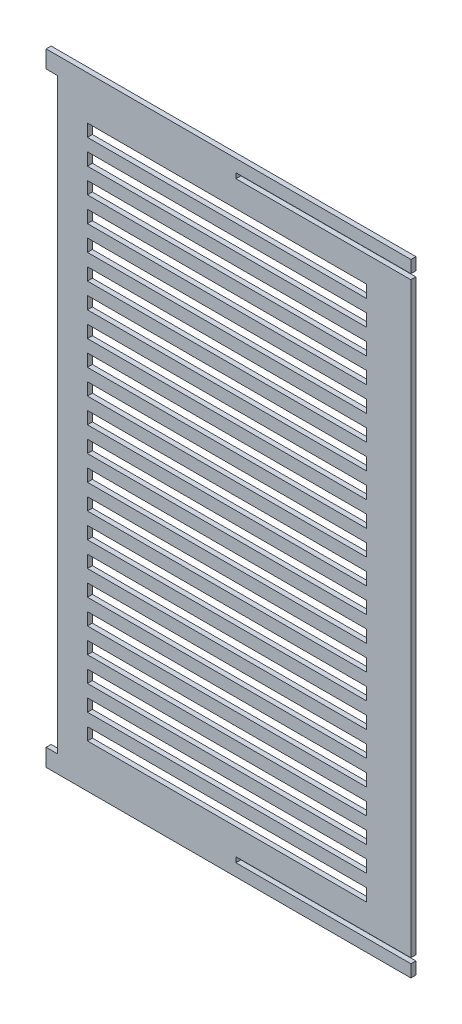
ISO-10303-21;
HEADER;
FILE_DESCRIPTION(('STEP AP214'),'2;1');
FILE_NAME('part.step','',(''),(''),'','','');
FILE_SCHEMA(('AUTOMOTIVE_DESIGN { 1 0 10303 214 1 1 1 1 }'));
ENDSEC;
DATA;
#1=APPLICATION_CONTEXT('core data for automotive mechanical design processes');
#2=APPLICATION_PROTOCOL_DEFINITION('international standard','automotive_design',2000,#1);
#3=PRODUCT_CONTEXT('',#1,'mechanical');
#4=PRODUCT('Part','Part','',(#3));
#5=PRODUCT_RELATED_PRODUCT_CATEGORY('part','',(#4));
#6=PRODUCT_DEFINITION_FORMATION('','',#4);
#7=PRODUCT_DEFINITION_CONTEXT('part definition',#1,'design');
#8=PRODUCT_DEFINITION('design','',#6,#7);
#9=PRODUCT_DEFINITION_SHAPE('','',#8);
#10=(LENGTH_UNIT() NAMED_UNIT(*) SI_UNIT(.MILLI.,.METRE.));
#11=(NAMED_UNIT(*) PLANE_ANGLE_UNIT() SI_UNIT($,.RADIAN.));
#12=(NAMED_UNIT(*) SI_UNIT($,.STERADIAN.) SOLID_ANGLE_UNIT());
#13=UNCERTAINTY_MEASURE_WITH_UNIT(LENGTH_MEASURE(1.E-05),#10,'distance_accuracy_value','');
#14=(GEOMETRIC_REPRESENTATION_CONTEXT(3) GLOBAL_UNCERTAINTY_ASSIGNED_CONTEXT((#13)) GLOBAL_UNIT_ASSIGNED_CONTEXT((#10,
#11,#12)) REPRESENTATION_CONTEXT('',''));
#15=CARTESIAN_POINT('',(0.,0.,0.));
#16=DIRECTION('',(0.,0.,1.));
#17=DIRECTION('',(1.,0.,0.));
#18=AXIS2_PLACEMENT_3D('',#15,#16,#17);
#19=CARTESIAN_POINT('',(0.,0.,4.));
#20=DIRECTION('',(0.,0.,1.));
#21=DIRECTION('',(1.,0.,0.));
#22=AXIS2_PLACEMENT_3D('',#19,#20,#21);
#23=PLANE('',#22);
#24=DIRECTION('',(0.,1.,0.));
#25=VECTOR('',#24,1.);
#26=CARTESIAN_POINT('',(-1807.5625,-460.4476,4.));
#27=LINE('',#26,#25);
#28=CARTESIAN_POINT('',(-1807.5625,-464.6476,4.));
#29=VERTEX_POINT('',#28);
#30=CARTESIAN_POINT('',(-1807.5625,-460.4476,4.));
#31=VERTEX_POINT('',#30);
#32=EDGE_CURVE('E1367',#29,#31,#27,.T.);
#33=ORIENTED_EDGE('',*,*,#32,.T.);
#34=DIRECTION('',(1.,0.,0.));
#35=VECTOR('',#34,1.);
#36=CARTESIAN_POINT('',(-1666.9398,-460.4476,4.));
#37=LINE('',#36,#35);
#38=CARTESIAN_POINT('',(-1666.9398,-460.4476,4.));
#39=VERTEX_POINT('',#38);
#40=EDGE_CURVE('E1370',#31,#39,#37,.T.);
#41=ORIENTED_EDGE('',*,*,#40,.T.);
#42=DIRECTION('',(0.,1.,0.));
#43=VECTOR('',#42,1.);
#44=CARTESIAN_POINT('',(-1666.9398,-450.5475,4.));
#45=LINE('',#44,#43);
#46=CARTESIAN_POINT('',(-1666.9398,-450.5475,4.));
#47=VERTEX_POINT('',#46);
#48=EDGE_CURVE('E1373',#39,#47,#45,.T.);
#49=ORIENTED_EDGE('',*,*,#48,.T.);
#50=DIRECTION('',(-1.,0.,0.));
#51=VECTOR('',#50,1.);
#52=CARTESIAN_POINT('',(-1960.0441,-450.5475,4.));
#53=LINE('',#52,#51);
#54=CARTESIAN_POINT('',(-1960.0441,-450.5475,4.));
#55=VERTEX_POINT('',#54);
#56=EDGE_CURVE('E1375',#47,#55,#53,.T.);
#57=ORIENTED_EDGE('',*,*,#56,.T.);
#58=DIRECTION('',(0.,-1.,0.));
#59=VECTOR('',#58,1.);
#60=CARTESIAN_POINT('',(-1960.0441,-464.5475,4.));
#61=LINE('',#60,#59);
#62=CARTESIAN_POINT('',(-1960.0441,-464.5475,4.));
#63=VERTEX_POINT('',#62);
#64=EDGE_CURVE('E1377',#55,#63,#61,.T.);
#65=ORIENTED_EDGE('',*,*,#64,.T.);
#66=DIRECTION('',(1.,0.,0.));
#67=VECTOR('',#66,1.);
#68=CARTESIAN_POINT('',(-1950.9398,-464.5475,4.));
#69=LINE('',#68,#67);
#70=CARTESIAN_POINT('',(-1950.9398,-464.5475,4.));
#71=VERTEX_POINT('',#70);
#72=EDGE_CURVE('E1379',#63,#71,#69,.T.);
#73=ORIENTED_EDGE('',*,*,#72,.T.);
#74=DIRECTION('',(0.,-1.,0.));
#75=VECTOR('',#74,1.);
#76=CARTESIAN_POINT('',(-1950.9398,-936.5475,4.));
#77=LINE('',#76,#75);
#78=CARTESIAN_POINT('',(-1950.9398,-936.5475,4.));
#79=VERTEX_POINT('',#78);
#80=EDGE_CURVE('E1381',#71,#79,#77,.T.);
#81=ORIENTED_EDGE('',*,*,#80,.T.);
#82=DIRECTION('',(-1.,0.,0.));
#83=VECTOR('',#82,1.);
#84=CARTESIAN_POINT('',(-1960.0441,-936.5475,4.));
#85=LINE('',#84,#83);
#86=CARTESIAN_POINT('',(-1960.0441,-936.5475,4.));
#87=VERTEX_POINT('',#86);
#88=EDGE_CURVE('E1383',#79,#87,#85,.T.);
#89=ORIENTED_EDGE('',*,*,#88,.T.);
#90=DIRECTION('',(0.,-1.,0.));
#91=VECTOR('',#90,1.);
#92=CARTESIAN_POINT('',(-1960.0441,-950.5475,4.));
#93=LINE('',#92,#91);
#94=CARTESIAN_POINT('',(-1960.0441,-950.5475,4.));
#95=VERTEX_POINT('',#94);
#96=EDGE_CURVE('E1385',#87,#95,#93,.T.);
#97=ORIENTED_EDGE('',*,*,#96,.T.);
#98=DIRECTION('',(1.,0.,0.));
#99=VECTOR('',#98,1.);
#100=CARTESIAN_POINT('',(-1666.9398,-950.5475,4.));
#101=LINE('',#100,#99);
#102=CARTESIAN_POINT('',(-1666.9398,-950.5475,4.));
#103=VERTEX_POINT('',#102);
#104=EDGE_CURVE('E1387',#95,#103,#101,.T.);
#105=ORIENTED_EDGE('',*,*,#104,.T.);
#106=DIRECTION('',(0.,1.,0.));
#107=VECTOR('',#106,1.);
#108=CARTESIAN_POINT('',(-1666.9398,-940.6475,4.));
#109=LINE('',#108,#107);
#110=CARTESIAN_POINT('',(-1666.9398,-940.6475,4.));
#111=VERTEX_POINT('',#110);
#112=EDGE_CURVE('E1389',#103,#111,#109,.T.);
#113=ORIENTED_EDGE('',*,*,#112,.T.);
#114=DIRECTION('',(-1.,0.,0.));
#115=VECTOR('',#114,1.);
#116=CARTESIAN_POINT('',(-1807.5625,-940.6475,4.));
#117=LINE('',#116,#115);
#118=CARTESIAN_POINT('',(-1807.5625,-940.6475,4.));
#119=VERTEX_POINT('',#118);
#120=EDGE_CURVE('E1391',#111,#119,#117,.T.);
#121=ORIENTED_EDGE('',*,*,#120,.T.);
#122=DIRECTION('',(0.,1.,0.));
#123=VECTOR('',#122,1.);
#124=CARTESIAN_POINT('',(-1807.5625,-940.5475,4.));
#125=LINE('',#124,#123);
#126=CARTESIAN_POINT('',(-1807.5625,-936.4475,4.));
#127=VERTEX_POINT('',#126);
#128=EDGE_CURVE('E1393',#119,#127,#125,.T.);
#129=ORIENTED_EDGE('',*,*,#128,.T.);
#130=DIRECTION('',(1.,0.,0.));
#131=VECTOR('',#130,1.);
#132=CARTESIAN_POINT('',(-1666.9398,-936.4475,4.));
#133=LINE('',#132,#131);
#134=CARTESIAN_POINT('',(-1666.9398,-936.4475,4.));
#135=VERTEX_POINT('',#134);
#136=EDGE_CURVE('E1395',#127,#135,#133,.T.);
#137=ORIENTED_EDGE('',*,*,#136,.T.);
#138=DIRECTION('',(0.,1.,0.));
#139=VECTOR('',#138,1.);
#140=CARTESIAN_POINT('',(-1666.9398,-464.6476,4.));
#141=LINE('',#140,#139);
#142=CARTESIAN_POINT('',(-1666.9398,-464.6476,4.));
#143=VERTEX_POINT('',#142);
#144=EDGE_CURVE('E1397',#135,#143,#141,.T.);
#145=ORIENTED_EDGE('',*,*,#144,.T.);
#146=DIRECTION('',(-1.,0.,0.));
#147=VECTOR('',#146,1.);
#148=CARTESIAN_POINT('',(-1807.5625,-464.6476,4.));
#149=LINE('',#148,#147);
#150=EDGE_CURVE('E1399',#143,#29,#149,.T.);
#151=ORIENTED_EDGE('',*,*,#150,.T.);
#152=EDGE_LOOP('',(#33,#41,#49,#57,#65,#73,#81,#89,#97,#105,#113,#121,#129,#137,#145,#151));
#153=FACE_BOUND('',#152,.T.);
#154=DIRECTION('',(-1.,0.,0.));
#155=VECTOR('',#154,1.);
#156=CARTESIAN_POINT('',(-1702.5079,-905.5475,4.));
#157=LINE('',#156,#155);
#158=CARTESIAN_POINT('',(-1702.5079,-905.5475,4.));
#159=VERTEX_POINT('',#158);
#160=CARTESIAN_POINT('',(-1926.881,-905.5475,4.));
#161=VERTEX_POINT('',#160);
#162=EDGE_CURVE('E1338',#159,#161,#157,.T.);
#163=ORIENTED_EDGE('',*,*,#162,.F.);
#164=DIRECTION('',(0.,1.,0.));
#165=VECTOR('',#164,1.);
#166=CARTESIAN_POINT('',(-1702.5079,-915.5475,4.));
#167=LINE('',#166,#165);
#168=CARTESIAN_POINT('',(-1702.5079,-915.5475,4.));
#169=VERTEX_POINT('',#168);
#170=EDGE_CURVE('E1336',#169,#159,#167,.T.);
#171=ORIENTED_EDGE('',*,*,#170,.F.);
#172=DIRECTION('',(1.,0.,0.));
#173=VECTOR('',#172,1.);
#174=CARTESIAN_POINT('',(-1926.881,-915.5475,4.));
#175=LINE('',#174,#173);
#176=CARTESIAN_POINT('',(-1926.881,-915.5475,4.));
#177=VERTEX_POINT('',#176);
#178=EDGE_CURVE('E1344',#177,#169,#175,.T.);
#179=ORIENTED_EDGE('',*,*,#178,.F.);
#180=DIRECTION('',(0.,-1.,0.));
#181=VECTOR('',#180,1.);
#182=CARTESIAN_POINT('',(-1926.881,-905.5475,4.));
#183=LINE('',#182,#181);
#184=EDGE_CURVE('E1341',#161,#177,#183,.T.);
#185=ORIENTED_EDGE('',*,*,#184,.F.);
#186=EDGE_LOOP('',(#163,#171,#179,#185));
#187=FACE_BOUND('',#186,.T.);
#188=DIRECTION('',(-1.,0.,0.));
#189=VECTOR('',#188,1.);
#190=CARTESIAN_POINT('',(-1702.5079,-885.5475,4.));
#191=LINE('',#190,#189);
#192=CARTESIAN_POINT('',(-1702.5079,-885.5475,4.));
#193=VERTEX_POINT('',#192);
#194=CARTESIAN_POINT('',(-1926.881,-885.5475,4.));
#195=VERTEX_POINT('',#194);
#196=EDGE_CURVE('E1307',#193,#195,#191,.T.);
#197=ORIENTED_EDGE('',*,*,#196,.F.);
#198=DIRECTION('',(0.,1.,0.));
#199=VECTOR('',#198,1.);
#200=CARTESIAN_POINT('',(-1702.5079,-895.5475,4.));
#201=LINE('',#200,#199);
#202=CARTESIAN_POINT('',(-1702.5079,-895.5475,4.));
#203=VERTEX_POINT('',#202);
#204=EDGE_CURVE('E1305',#203,#193,#201,.T.);
#205=ORIENTED_EDGE('',*,*,#204,.F.);
#206=DIRECTION('',(1.,0.,0.));
#207=VECTOR('',#206,1.);
#208=CARTESIAN_POINT('',(-1926.881,-895.5475,4.));
#209=LINE('',#208,#207);
#210=CARTESIAN_POINT('',(-1926.881,-895.5475,4.));
#211=VERTEX_POINT('',#210);
#212=EDGE_CURVE('E1313',#211,#203,#209,.T.);
#213=ORIENTED_EDGE('',*,*,#212,.F.);
#214=DIRECTION('',(0.,-1.,0.));
#215=VECTOR('',#214,1.);
#216=CARTESIAN_POINT('',(-1926.881,-885.5475,4.));
#217=LINE('',#216,#215);
#218=EDGE_CURVE('E1310',#195,#211,#217,.T.);
#219=ORIENTED_EDGE('',*,*,#218,.F.);
#220=EDGE_LOOP('',(#197,#205,#213,#219));
#221=FACE_BOUND('',#220,.T.);
#222=DIRECTION('',(-1.,0.,0.));
#223=VECTOR('',#222,1.);
#224=CARTESIAN_POINT('',(-1702.5079,-865.5475,4.));
#225=LINE('',#224,#223);
#226=CARTESIAN_POINT('',(-1702.5079,-865.5475,4.));
#227=VERTEX_POINT('',#226);
#228=CARTESIAN_POINT('',(-1926.881,-865.5475,4.));
#229=VERTEX_POINT('',#228);
#230=EDGE_CURVE('E1276',#227,#229,#225,.T.);
#231=ORIENTED_EDGE('',*,*,#230,.F.);
#232=DIRECTION('',(0.,1.,0.));
#233=VECTOR('',#232,1.);
#234=CARTESIAN_POINT('',(-1702.5079,-875.5475,4.));
#235=LINE('',#234,#233);
#236=CARTESIAN_POINT('',(-1702.5079,-875.5475,4.));
#237=VERTEX_POINT('',#236);
#238=EDGE_CURVE('E1274',#237,#227,#235,.T.);
#239=ORIENTED_EDGE('',*,*,#238,.F.);
#240=DIRECTION('',(1.,0.,0.));
#241=VECTOR('',#240,1.);
#242=CARTESIAN_POINT('',(-1926.881,-875.5475,4.));
#243=LINE('',#242,#241);
#244=CARTESIAN_POINT('',(-1926.881,-875.5475,4.));
#245=VERTEX_POINT('',#244);
#246=EDGE_CURVE('E1282',#245,#237,#243,.T.);
#247=ORIENTED_EDGE('',*,*,#246,.F.);
#248=DIRECTION('',(0.,-1.,0.));
#249=VECTOR('',#248,1.);
#250=CARTESIAN_POINT('',(-1926.881,-865.5475,4.));
#251=LINE('',#250,#249);
#252=EDGE_CURVE('E1279',#229,#245,#251,.T.);
#253=ORIENTED_EDGE('',*,*,#252,.F.);
#254=EDGE_LOOP('',(#231,#239,#247,#253));
#255=FACE_BOUND('',#254,.T.);
#256=DIRECTION('',(-1.,0.,0.));
#257=VECTOR('',#256,1.);
#258=CARTESIAN_POINT('',(-1702.5079,-845.5475,4.));
#259=LINE('',#258,#257);
#260=CARTESIAN_POINT('',(-1702.5079,-845.5475,4.));
#261=VERTEX_POINT('',#260);
#262=CARTESIAN_POINT('',(-1926.881,-845.5475,4.));
#263=VERTEX_POINT('',#262);
#264=EDGE_CURVE('E1245',#261,#263,#259,.T.);
#265=ORIENTED_EDGE('',*,*,#264,.F.);
#266=DIRECTION('',(0.,1.,0.));
#267=VECTOR('',#266,1.);
#268=CARTESIAN_POINT('',(-1702.5079,-855.5475,4.));
#269=LINE('',#268,#267);
#270=CARTESIAN_POINT('',(-1702.5079,-855.5475,4.));
#271=VERTEX_POINT('',#270);
#272=EDGE_CURVE('E1243',#271,#261,#269,.T.);
#273=ORIENTED_EDGE('',*,*,#272,.F.);
#274=DIRECTION('',(1.,0.,0.));
#275=VECTOR('',#274,1.);
#276=CARTESIAN_POINT('',(-1926.881,-855.5475,4.));
#277=LINE('',#276,#275);
#278=CARTESIAN_POINT('',(-1926.881,-855.5475,4.));
#279=VERTEX_POINT('',#278);
#280=EDGE_CURVE('E1251',#279,#271,#277,.T.);
#281=ORIENTED_EDGE('',*,*,#280,.F.);
#282=DIRECTION('',(0.,-1.,0.));
#283=VECTOR('',#282,1.);
#284=CARTESIAN_POINT('',(-1926.881,-845.5475,4.));
#285=LINE('',#284,#283);
#286=EDGE_CURVE('E1248',#263,#279,#285,.T.);
#287=ORIENTED_EDGE('',*,*,#286,.F.);
#288=EDGE_LOOP('',(#265,#273,#281,#287));
#289=FACE_BOUND('',#288,.T.);
#290=DIRECTION('',(-1.,0.,0.));
#291=VECTOR('',#290,1.);
#292=CARTESIAN_POINT('',(-1702.5079,-825.5475,4.));
#293=LINE('',#292,#291);
#294=CARTESIAN_POINT('',(-1702.5079,-825.5475,4.));
#295=VERTEX_POINT('',#294);
#296=CARTESIAN_POINT('',(-1926.881,-825.5475,4.));
#297=VERTEX_POINT('',#296);
#298=EDGE_CURVE('E1214',#295,#297,#293,.T.);
#299=ORIENTED_EDGE('',*,*,#298,.F.);
#300=DIRECTION('',(0.,1.,0.));
#301=VECTOR('',#300,1.);
#302=CARTESIAN_POINT('',(-1702.5079,-835.5475,4.));
#303=LINE('',#302,#301);
#304=CARTESIAN_POINT('',(-1702.5079,-835.5475,4.));
#305=VERTEX_POINT('',#304);
#306=EDGE_CURVE('E1212',#305,#295,#303,.T.);
#307=ORIENTED_EDGE('',*,*,#306,.F.);
#308=DIRECTION('',(1.,0.,0.));
#309=VECTOR('',#308,1.);
#310=CARTESIAN_POINT('',(-1926.881,-835.5475,4.));
#311=LINE('',#310,#309);
#312=CARTESIAN_POINT('',(-1926.881,-835.5475,4.));
#313=VERTEX_POINT('',#312);
#314=EDGE_CURVE('E1220',#313,#305,#311,.T.);
#315=ORIENTED_EDGE('',*,*,#314,.F.);
#316=DIRECTION('',(0.,-1.,0.));
#317=VECTOR('',#316,1.);
#318=CARTESIAN_POINT('',(-1926.881,-825.5475,4.));
#319=LINE('',#318,#317);
#320=EDGE_CURVE('E1217',#297,#313,#319,.T.);
#321=ORIENTED_EDGE('',*,*,#320,.F.);
#322=EDGE_LOOP('',(#299,#307,#315,#321));
#323=FACE_BOUND('',#322,.T.);
#324=DIRECTION('',(-1.,0.,0.));
#325=VECTOR('',#324,1.);
#326=CARTESIAN_POINT('',(-1702.5079,-805.5475,4.));
#327=LINE('',#326,#325);
#328=CARTESIAN_POINT('',(-1702.5079,-805.5475,4.));
#329=VERTEX_POINT('',#328);
#330=CARTESIAN_POINT('',(-1926.881,-805.5475,4.));
#331=VERTEX_POINT('',#330);
#332=EDGE_CURVE('E1183',#329,#331,#327,.T.);
#333=ORIENTED_EDGE('',*,*,#332,.F.);
#334=DIRECTION('',(0.,1.,0.));
#335=VECTOR('',#334,1.);
#336=CARTESIAN_POINT('',(-1702.5079,-815.5475,4.));
#337=LINE('',#336,#335);
#338=CARTESIAN_POINT('',(-1702.5079,-815.5475,4.));
#339=VERTEX_POINT('',#338);
#340=EDGE_CURVE('E1181',#339,#329,#337,.T.);
#341=ORIENTED_EDGE('',*,*,#340,.F.);
#342=DIRECTION('',(1.,0.,0.));
#343=VECTOR('',#342,1.);
#344=CARTESIAN_POINT('',(-1926.881,-815.5475,4.));
#345=LINE('',#344,#343);
#346=CARTESIAN_POINT('',(-1926.881,-815.5475,4.));
#347=VERTEX_POINT('',#346);
#348=EDGE_CURVE('E1189',#347,#339,#345,.T.);
#349=ORIENTED_EDGE('',*,*,#348,.F.);
#350=DIRECTION('',(0.,-1.,0.));
#351=VECTOR('',#350,1.);
#352=CARTESIAN_POINT('',(-1926.881,-805.5475,4.));
#353=LINE('',#352,#351);
#354=EDGE_CURVE('E1186',#331,#347,#353,.T.);
#355=ORIENTED_EDGE('',*,*,#354,.F.);
#356=EDGE_LOOP('',(#333,#341,#349,#355));
#357=FACE_BOUND('',#356,.T.);
#358=DIRECTION('',(-1.,0.,0.));
#359=VECTOR('',#358,1.);
#360=CARTESIAN_POINT('',(-1702.5079,-785.5475,4.));
#361=LINE('',#360,#359);
#362=CARTESIAN_POINT('',(-1702.5079,-785.5475,4.));
#363=VERTEX_POINT('',#362);
#364=CARTESIAN_POINT('',(-1926.881,-785.5475,4.));
#365=VERTEX_POINT('',#364);
#366=EDGE_CURVE('E1152',#363,#365,#361,.T.);
#367=ORIENTED_EDGE('',*,*,#366,.F.);
#368=DIRECTION('',(0.,1.,0.));
#369=VECTOR('',#368,1.);
#370=CARTESIAN_POINT('',(-1702.5079,-795.5475,4.));
#371=LINE('',#370,#369);
#372=CARTESIAN_POINT('',(-1702.5079,-795.5475,4.));
#373=VERTEX_POINT('',#372);
#374=EDGE_CURVE('E1150',#373,#363,#371,.T.);
#375=ORIENTED_EDGE('',*,*,#374,.F.);
#376=DIRECTION('',(1.,0.,0.));
#377=VECTOR('',#376,1.);
#378=CARTESIAN_POINT('',(-1926.881,-795.5475,4.));
#379=LINE('',#378,#377);
#380=CARTESIAN_POINT('',(-1926.881,-795.5475,4.));
#381=VERTEX_POINT('',#380);
#382=EDGE_CURVE('E1158',#381,#373,#379,.T.);
#383=ORIENTED_EDGE('',*,*,#382,.F.);
#384=DIRECTION('',(0.,-1.,0.));
#385=VECTOR('',#384,1.);
#386=CARTESIAN_POINT('',(-1926.881,-785.5475,4.));
#387=LINE('',#386,#385);
#388=EDGE_CURVE('E1155',#365,#381,#387,.T.);
#389=ORIENTED_EDGE('',*,*,#388,.F.);
#390=EDGE_LOOP('',(#367,#375,#383,#389));
#391=FACE_BOUND('',#390,.T.);
#392=DIRECTION('',(-1.,0.,0.));
#393=VECTOR('',#392,1.);
#394=CARTESIAN_POINT('',(-1702.5079,-765.5475,4.));
#395=LINE('',#394,#393);
#396=CARTESIAN_POINT('',(-1702.5079,-765.5475,4.));
#397=VERTEX_POINT('',#396);
#398=CARTESIAN_POINT('',(-1926.881,-765.5475,4.));
#399=VERTEX_POINT('',#398);
#400=EDGE_CURVE('E1121',#397,#399,#395,.T.);
#401=ORIENTED_EDGE('',*,*,#400,.F.);
#402=DIRECTION('',(0.,1.,0.));
#403=VECTOR('',#402,1.);
#404=CARTESIAN_POINT('',(-1702.5079,-775.5475,4.));
#405=LINE('',#404,#403);
#406=CARTESIAN_POINT('',(-1702.5079,-775.5475,4.));
#407=VERTEX_POINT('',#406);
#408=EDGE_CURVE('E1119',#407,#397,#405,.T.);
#409=ORIENTED_EDGE('',*,*,#408,.F.);
#410=DIRECTION('',(1.,0.,0.));
#411=VECTOR('',#410,1.);
#412=CARTESIAN_POINT('',(-1926.881,-775.5475,4.));
#413=LINE('',#412,#411);
#414=CARTESIAN_POINT('',(-1926.881,-775.5475,4.));
#415=VERTEX_POINT('',#414);
#416=EDGE_CURVE('E1127',#415,#407,#413,.T.);
#417=ORIENTED_EDGE('',*,*,#416,.F.);
#418=DIRECTION('',(0.,-1.,0.));
#419=VECTOR('',#418,1.);
#420=CARTESIAN_POINT('',(-1926.881,-765.5475,4.));
#421=LINE('',#420,#419);
#422=EDGE_CURVE('E1124',#399,#415,#421,.T.);
#423=ORIENTED_EDGE('',*,*,#422,.F.);
#424=EDGE_LOOP('',(#401,#409,#417,#423));
#425=FACE_BOUND('',#424,.T.);
#426=DIRECTION('',(-1.,0.,0.));
#427=VECTOR('',#426,1.);
#428=CARTESIAN_POINT('',(-1702.5079,-745.5475,4.));
#429=LINE('',#428,#427);
#430=CARTESIAN_POINT('',(-1702.5079,-745.5475,4.));
#431=VERTEX_POINT('',#430);
#432=CARTESIAN_POINT('',(-1926.881,-745.5475,4.));
#433=VERTEX_POINT('',#432);
#434=EDGE_CURVE('E1090',#431,#433,#429,.T.);
#435=ORIENTED_EDGE('',*,*,#434,.F.);
#436=DIRECTION('',(0.,1.,0.));
#437=VECTOR('',#436,1.);
#438=CARTESIAN_POINT('',(-1702.5079,-755.5475,4.));
#439=LINE('',#438,#437);
#440=CARTESIAN_POINT('',(-1702.5079,-755.5475,4.));
#441=VERTEX_POINT('',#440);
#442=EDGE_CURVE('E1088',#441,#431,#439,.T.);
#443=ORIENTED_EDGE('',*,*,#442,.F.);
#444=DIRECTION('',(1.,0.,0.));
#445=VECTOR('',#444,1.);
#446=CARTESIAN_POINT('',(-1926.881,-755.5475,4.));
#447=LINE('',#446,#445);
#448=CARTESIAN_POINT('',(-1926.881,-755.5475,4.));
#449=VERTEX_POINT('',#448);
#450=EDGE_CURVE('E1096',#449,#441,#447,.T.);
#451=ORIENTED_EDGE('',*,*,#450,.F.);
#452=DIRECTION('',(0.,-1.,0.));
#453=VECTOR('',#452,1.);
#454=CARTESIAN_POINT('',(-1926.881,-745.5475,4.));
#455=LINE('',#454,#453);
#456=EDGE_CURVE('E1093',#433,#449,#455,.T.);
#457=ORIENTED_EDGE('',*,*,#456,.F.);
#458=EDGE_LOOP('',(#435,#443,#451,#457));
#459=FACE_BOUND('',#458,.T.);
#460=DIRECTION('',(-1.,0.,0.));
#461=VECTOR('',#460,1.);
#462=CARTESIAN_POINT('',(-1702.5079,-725.5475,4.));
#463=LINE('',#462,#461);
#464=CARTESIAN_POINT('',(-1702.5079,-725.5475,4.));
#465=VERTEX_POINT('',#464);
#466=CARTESIAN_POINT('',(-1926.881,-725.5475,4.));
#467=VERTEX_POINT('',#466);
#468=EDGE_CURVE('E1059',#465,#467,#463,.T.);
#469=ORIENTED_EDGE('',*,*,#468,.F.);
#470=DIRECTION('',(0.,1.,0.));
#471=VECTOR('',#470,1.);
#472=CARTESIAN_POINT('',(-1702.5079,-735.5475,4.));
#473=LINE('',#472,#471);
#474=CARTESIAN_POINT('',(-1702.5079,-735.5475,4.));
#475=VERTEX_POINT('',#474);
#476=EDGE_CURVE('E1057',#475,#465,#473,.T.);
#477=ORIENTED_EDGE('',*,*,#476,.F.);
#478=DIRECTION('',(1.,0.,0.));
#479=VECTOR('',#478,1.);
#480=CARTESIAN_POINT('',(-1926.881,-735.5475,4.));
#481=LINE('',#480,#479);
#482=CARTESIAN_POINT('',(-1926.881,-735.5475,4.));
#483=VERTEX_POINT('',#482);
#484=EDGE_CURVE('E1065',#483,#475,#481,.T.);
#485=ORIENTED_EDGE('',*,*,#484,.F.);
#486=DIRECTION('',(0.,-1.,0.));
#487=VECTOR('',#486,1.);
#488=CARTESIAN_POINT('',(-1926.881,-725.5475,4.));
#489=LINE('',#488,#487);
#490=EDGE_CURVE('E1062',#467,#483,#489,.T.);
#491=ORIENTED_EDGE('',*,*,#490,.F.);
#492=EDGE_LOOP('',(#469,#477,#485,#491));
#493=FACE_BOUND('',#492,.T.);
#494=DIRECTION('',(-1.,0.,0.));
#495=VECTOR('',#494,1.);
#496=CARTESIAN_POINT('',(-1702.5079,-705.5475,4.));
#497=LINE('',#496,#495);
#498=CARTESIAN_POINT('',(-1702.5079,-705.5475,4.));
#499=VERTEX_POINT('',#498);
#500=CARTESIAN_POINT('',(-1926.881,-705.5475,4.));
#501=VERTEX_POINT('',#500);
#502=EDGE_CURVE('E1028',#499,#501,#497,.T.);
#503=ORIENTED_EDGE('',*,*,#502,.F.);
#504=DIRECTION('',(0.,1.,0.));
#505=VECTOR('',#504,1.);
#506=CARTESIAN_POINT('',(-1702.5079,-715.5475,4.));
#507=LINE('',#506,#505);
#508=CARTESIAN_POINT('',(-1702.5079,-715.5475,4.));
#509=VERTEX_POINT('',#508);
#510=EDGE_CURVE('E1026',#509,#499,#507,.T.);
#511=ORIENTED_EDGE('',*,*,#510,.F.);
#512=DIRECTION('',(1.,0.,0.));
#513=VECTOR('',#512,1.);
#514=CARTESIAN_POINT('',(-1926.881,-715.5475,4.));
#515=LINE('',#514,#513);
#516=CARTESIAN_POINT('',(-1926.881,-715.5475,4.));
#517=VERTEX_POINT('',#516);
#518=EDGE_CURVE('E1034',#517,#509,#515,.T.);
#519=ORIENTED_EDGE('',*,*,#518,.F.);
#520=DIRECTION('',(0.,-1.,0.));
#521=VECTOR('',#520,1.);
#522=CARTESIAN_POINT('',(-1926.881,-705.5475,4.));
#523=LINE('',#522,#521);
#524=EDGE_CURVE('E1031',#501,#517,#523,.T.);
#525=ORIENTED_EDGE('',*,*,#524,.F.);
#526=EDGE_LOOP('',(#503,#511,#519,#525));
#527=FACE_BOUND('',#526,.T.);
#528=DIRECTION('',(-1.,0.,0.));
#529=VECTOR('',#528,1.);
#530=CARTESIAN_POINT('',(-1702.5079,-685.5475,4.));
#531=LINE('',#530,#529);
#532=CARTESIAN_POINT('',(-1702.5079,-685.5475,4.));
#533=VERTEX_POINT('',#532);
#534=CARTESIAN_POINT('',(-1926.881,-685.5475,4.));
#535=VERTEX_POINT('',#534);
#536=EDGE_CURVE('E997',#533,#535,#531,.T.);
#537=ORIENTED_EDGE('',*,*,#536,.F.);
#538=DIRECTION('',(0.,1.,0.));
#539=VECTOR('',#538,1.);
#540=CARTESIAN_POINT('',(-1702.5079,-695.5475,4.));
#541=LINE('',#540,#539);
#542=CARTESIAN_POINT('',(-1702.5079,-695.5475,4.));
#543=VERTEX_POINT('',#542);
#544=EDGE_CURVE('E995',#543,#533,#541,.T.);
#545=ORIENTED_EDGE('',*,*,#544,.F.);
#546=DIRECTION('',(1.,0.,0.));
#547=VECTOR('',#546,1.);
#548=CARTESIAN_POINT('',(-1926.881,-695.5475,4.));
#549=LINE('',#548,#547);
#550=CARTESIAN_POINT('',(-1926.881,-695.5475,4.));
#551=VERTEX_POINT('',#550);
#552=EDGE_CURVE('E1003',#551,#543,#549,.T.);
#553=ORIENTED_EDGE('',*,*,#552,.F.);
#554=DIRECTION('',(0.,-1.,0.));
#555=VECTOR('',#554,1.);
#556=CARTESIAN_POINT('',(-1926.881,-685.5475,4.));
#557=LINE('',#556,#555);
#558=EDGE_CURVE('E1000',#535,#551,#557,.T.);
#559=ORIENTED_EDGE('',*,*,#558,.F.);
#560=EDGE_LOOP('',(#537,#545,#553,#559));
#561=FACE_BOUND('',#560,.T.);
#562=DIRECTION('',(-1.,0.,0.));
#563=VECTOR('',#562,1.);
#564=CARTESIAN_POINT('',(-1702.5079,-665.5475,4.));
#565=LINE('',#564,#563);
#566=CARTESIAN_POINT('',(-1702.5079,-665.5475,4.));
#567=VERTEX_POINT('',#566);
#568=CARTESIAN_POINT('',(-1926.881,-665.5475,4.));
#569=VERTEX_POINT('',#568);
#570=EDGE_CURVE('E966',#567,#569,#565,.T.);
#571=ORIENTED_EDGE('',*,*,#570,.F.);
#572=DIRECTION('',(0.,1.,0.));
#573=VECTOR('',#572,1.);
#574=CARTESIAN_POINT('',(-1702.5079,-675.5475,4.));
#575=LINE('',#574,#573);
#576=CARTESIAN_POINT('',(-1702.5079,-675.5475,4.));
#577=VERTEX_POINT('',#576);
#578=EDGE_CURVE('E964',#577,#567,#575,.T.);
#579=ORIENTED_EDGE('',*,*,#578,.F.);
#580=DIRECTION('',(1.,0.,0.));
#581=VECTOR('',#580,1.);
#582=CARTESIAN_POINT('',(-1926.881,-675.5475,4.));
#583=LINE('',#582,#581);
#584=CARTESIAN_POINT('',(-1926.881,-675.5475,4.));
#585=VERTEX_POINT('',#584);
#586=EDGE_CURVE('E972',#585,#577,#583,.T.);
#587=ORIENTED_EDGE('',*,*,#586,.F.);
#588=DIRECTION('',(0.,-1.,0.));
#589=VECTOR('',#588,1.);
#590=CARTESIAN_POINT('',(-1926.881,-665.5475,4.));
#591=LINE('',#590,#589);
#592=EDGE_CURVE('E969',#569,#585,#591,.T.);
#593=ORIENTED_EDGE('',*,*,#592,.F.);
#594=EDGE_LOOP('',(#571,#579,#587,#593));
#595=FACE_BOUND('',#594,.T.);
#596=DIRECTION('',(-1.,0.,0.));
#597=VECTOR('',#596,1.);
#598=CARTESIAN_POINT('',(-1702.5079,-645.5475,4.));
#599=LINE('',#598,#597);
#600=CARTESIAN_POINT('',(-1702.5079,-645.5475,4.));
#601=VERTEX_POINT('',#600);
#602=CARTESIAN_POINT('',(-1926.881,-645.5475,4.));
#603=VERTEX_POINT('',#602);
#604=EDGE_CURVE('E935',#601,#603,#599,.T.);
#605=ORIENTED_EDGE('',*,*,#604,.F.);
#606=DIRECTION('',(0.,1.,0.));
#607=VECTOR('',#606,1.);
#608=CARTESIAN_POINT('',(-1702.5079,-655.5475,4.));
#609=LINE('',#608,#607);
#610=CARTESIAN_POINT('',(-1702.5079,-655.5475,4.));
#611=VERTEX_POINT('',#610);
#612=EDGE_CURVE('E933',#611,#601,#609,.T.);
#613=ORIENTED_EDGE('',*,*,#612,.F.);
#614=DIRECTION('',(1.,0.,0.));
#615=VECTOR('',#614,1.);
#616=CARTESIAN_POINT('',(-1926.881,-655.5475,4.));
#617=LINE('',#616,#615);
#618=CARTESIAN_POINT('',(-1926.881,-655.5475,4.));
#619=VERTEX_POINT('',#618);
#620=EDGE_CURVE('E941',#619,#611,#617,.T.);
#621=ORIENTED_EDGE('',*,*,#620,.F.);
#622=DIRECTION('',(0.,-1.,0.));
#623=VECTOR('',#622,1.);
#624=CARTESIAN_POINT('',(-1926.881,-645.5475,4.));
#625=LINE('',#624,#623);
#626=EDGE_CURVE('E938',#603,#619,#625,.T.);
#627=ORIENTED_EDGE('',*,*,#626,.F.);
#628=EDGE_LOOP('',(#605,#613,#621,#627));
#629=FACE_BOUND('',#628,.T.);
#630=DIRECTION('',(-1.,0.,0.));
#631=VECTOR('',#630,1.);
#632=CARTESIAN_POINT('',(-1702.5079,-625.5475,4.));
#633=LINE('',#632,#631);
#634=CARTESIAN_POINT('',(-1702.5079,-625.5475,4.));
#635=VERTEX_POINT('',#634);
#636=CARTESIAN_POINT('',(-1926.881,-625.5475,4.));
#637=VERTEX_POINT('',#636);
#638=EDGE_CURVE('E904',#635,#637,#633,.T.);
#639=ORIENTED_EDGE('',*,*,#638,.F.);
#640=DIRECTION('',(0.,1.,0.));
#641=VECTOR('',#640,1.);
#642=CARTESIAN_POINT('',(-1702.5079,-635.5475,4.));
#643=LINE('',#642,#641);
#644=CARTESIAN_POINT('',(-1702.5079,-635.5475,4.));
#645=VERTEX_POINT('',#644);
#646=EDGE_CURVE('E902',#645,#635,#643,.T.);
#647=ORIENTED_EDGE('',*,*,#646,.F.);
#648=DIRECTION('',(1.,0.,0.));
#649=VECTOR('',#648,1.);
#650=CARTESIAN_POINT('',(-1926.881,-635.5475,4.));
#651=LINE('',#650,#649);
#652=CARTESIAN_POINT('',(-1926.881,-635.5475,4.));
#653=VERTEX_POINT('',#652);
#654=EDGE_CURVE('E910',#653,#645,#651,.T.);
#655=ORIENTED_EDGE('',*,*,#654,.F.);
#656=DIRECTION('',(0.,-1.,0.));
#657=VECTOR('',#656,1.);
#658=CARTESIAN_POINT('',(-1926.881,-625.5475,4.));
#659=LINE('',#658,#657);
#660=EDGE_CURVE('E907',#637,#653,#659,.T.);
#661=ORIENTED_EDGE('',*,*,#660,.F.);
#662=EDGE_LOOP('',(#639,#647,#655,#661));
#663=FACE_BOUND('',#662,.T.);
#664=DIRECTION('',(-1.,0.,0.));
#665=VECTOR('',#664,1.);
#666=CARTESIAN_POINT('',(-1702.5079,-605.5475,4.));
#667=LINE('',#666,#665);
#668=CARTESIAN_POINT('',(-1702.5079,-605.5475,4.));
#669=VERTEX_POINT('',#668);
#670=CARTESIAN_POINT('',(-1926.881,-605.5475,4.));
#671=VERTEX_POINT('',#670);
#672=EDGE_CURVE('E873',#669,#671,#667,.T.);
#673=ORIENTED_EDGE('',*,*,#672,.F.);
#674=DIRECTION('',(0.,1.,0.));
#675=VECTOR('',#674,1.);
#676=CARTESIAN_POINT('',(-1702.5079,-615.5475,4.));
#677=LINE('',#676,#675);
#678=CARTESIAN_POINT('',(-1702.5079,-615.5475,4.));
#679=VERTEX_POINT('',#678);
#680=EDGE_CURVE('E871',#679,#669,#677,.T.);
#681=ORIENTED_EDGE('',*,*,#680,.F.);
#682=DIRECTION('',(1.,0.,0.));
#683=VECTOR('',#682,1.);
#684=CARTESIAN_POINT('',(-1926.881,-615.5475,4.));
#685=LINE('',#684,#683);
#686=CARTESIAN_POINT('',(-1926.881,-615.5475,4.));
#687=VERTEX_POINT('',#686);
#688=EDGE_CURVE('E879',#687,#679,#685,.T.);
#689=ORIENTED_EDGE('',*,*,#688,.F.);
#690=DIRECTION('',(0.,-1.,0.));
#691=VECTOR('',#690,1.);
#692=CARTESIAN_POINT('',(-1926.881,-605.5475,4.));
#693=LINE('',#692,#691);
#694=EDGE_CURVE('E876',#671,#687,#693,.T.);
#695=ORIENTED_EDGE('',*,*,#694,.F.);
#696=EDGE_LOOP('',(#673,#681,#689,#695));
#697=FACE_BOUND('',#696,.T.);
#698=DIRECTION('',(-1.,0.,0.));
#699=VECTOR('',#698,1.);
#700=CARTESIAN_POINT('',(-1702.5079,-585.5475,4.));
#701=LINE('',#700,#699);
#702=CARTESIAN_POINT('',(-1702.5079,-585.5475,4.));
#703=VERTEX_POINT('',#702);
#704=CARTESIAN_POINT('',(-1926.881,-585.5475,4.));
#705=VERTEX_POINT('',#704);
#706=EDGE_CURVE('E842',#703,#705,#701,.T.);
#707=ORIENTED_EDGE('',*,*,#706,.F.);
#708=DIRECTION('',(0.,1.,0.));
#709=VECTOR('',#708,1.);
#710=CARTESIAN_POINT('',(-1702.5079,-595.5475,4.));
#711=LINE('',#710,#709);
#712=CARTESIAN_POINT('',(-1702.5079,-595.5475,4.));
#713=VERTEX_POINT('',#712);
#714=EDGE_CURVE('E840',#713,#703,#711,.T.);
#715=ORIENTED_EDGE('',*,*,#714,.F.);
#716=DIRECTION('',(1.,0.,0.));
#717=VECTOR('',#716,1.);
#718=CARTESIAN_POINT('',(-1926.881,-595.5475,4.));
#719=LINE('',#718,#717);
#720=CARTESIAN_POINT('',(-1926.881,-595.5475,4.));
#721=VERTEX_POINT('',#720);
#722=EDGE_CURVE('E848',#721,#713,#719,.T.);
#723=ORIENTED_EDGE('',*,*,#722,.F.);
#724=DIRECTION('',(0.,-1.,0.));
#725=VECTOR('',#724,1.);
#726=CARTESIAN_POINT('',(-1926.881,-585.5475,4.));
#727=LINE('',#726,#725);
#728=EDGE_CURVE('E845',#705,#721,#727,.T.);
#729=ORIENTED_EDGE('',*,*,#728,.F.);
#730=EDGE_LOOP('',(#707,#715,#723,#729));
#731=FACE_BOUND('',#730,.T.);
#732=DIRECTION('',(-1.,0.,0.));
#733=VECTOR('',#732,1.);
#734=CARTESIAN_POINT('',(-1702.5079,-565.5475,4.));
#735=LINE('',#734,#733);
#736=CARTESIAN_POINT('',(-1702.5079,-565.5475,4.));
#737=VERTEX_POINT('',#736);
#738=CARTESIAN_POINT('',(-1926.881,-565.5475,4.));
#739=VERTEX_POINT('',#738);
#740=EDGE_CURVE('E811',#737,#739,#735,.T.);
#741=ORIENTED_EDGE('',*,*,#740,.F.);
#742=DIRECTION('',(0.,1.,0.));
#743=VECTOR('',#742,1.);
#744=CARTESIAN_POINT('',(-1702.5079,-575.5475,4.));
#745=LINE('',#744,#743);
#746=CARTESIAN_POINT('',(-1702.5079,-575.5475,4.));
#747=VERTEX_POINT('',#746);
#748=EDGE_CURVE('E809',#747,#737,#745,.T.);
#749=ORIENTED_EDGE('',*,*,#748,.F.);
#750=DIRECTION('',(1.,0.,0.));
#751=VECTOR('',#750,1.);
#752=CARTESIAN_POINT('',(-1926.881,-575.5475,4.));
#753=LINE('',#752,#751);
#754=CARTESIAN_POINT('',(-1926.881,-575.5475,4.));
#755=VERTEX_POINT('',#754);
#756=EDGE_CURVE('E817',#755,#747,#753,.T.);
#757=ORIENTED_EDGE('',*,*,#756,.F.);
#758=DIRECTION('',(0.,-1.,0.));
#759=VECTOR('',#758,1.);
#760=CARTESIAN_POINT('',(-1926.881,-565.5475,4.));
#761=LINE('',#760,#759);
#762=EDGE_CURVE('E814',#739,#755,#761,.T.);
#763=ORIENTED_EDGE('',*,*,#762,.F.);
#764=EDGE_LOOP('',(#741,#749,#757,#763));
#765=FACE_BOUND('',#764,.T.);
#766=DIRECTION('',(-1.,0.,0.));
#767=VECTOR('',#766,1.);
#768=CARTESIAN_POINT('',(-1702.5079,-545.5475,4.));
#769=LINE('',#768,#767);
#770=CARTESIAN_POINT('',(-1702.5079,-545.5475,4.));
#771=VERTEX_POINT('',#770);
#772=CARTESIAN_POINT('',(-1926.881,-545.5475,4.));
#773=VERTEX_POINT('',#772);
#774=EDGE_CURVE('E780',#771,#773,#769,.T.);
#775=ORIENTED_EDGE('',*,*,#774,.F.);
#776=DIRECTION('',(0.,1.,0.));
#777=VECTOR('',#776,1.);
#778=CARTESIAN_POINT('',(-1702.5079,-555.5475,4.));
#779=LINE('',#778,#777);
#780=CARTESIAN_POINT('',(-1702.5079,-555.5475,4.));
#781=VERTEX_POINT('',#780);
#782=EDGE_CURVE('E778',#781,#771,#779,.T.);
#783=ORIENTED_EDGE('',*,*,#782,.F.);
#784=DIRECTION('',(1.,0.,0.));
#785=VECTOR('',#784,1.);
#786=CARTESIAN_POINT('',(-1926.881,-555.5475,4.));
#787=LINE('',#786,#785);
#788=CARTESIAN_POINT('',(-1926.881,-555.5475,4.));
#789=VERTEX_POINT('',#788);
#790=EDGE_CURVE('E786',#789,#781,#787,.T.);
#791=ORIENTED_EDGE('',*,*,#790,.F.);
#792=DIRECTION('',(0.,-1.,0.));
#793=VECTOR('',#792,1.);
#794=CARTESIAN_POINT('',(-1926.881,-545.5475,4.));
#795=LINE('',#794,#793);
#796=EDGE_CURVE('E783',#773,#789,#795,.T.);
#797=ORIENTED_EDGE('',*,*,#796,.F.);
#798=EDGE_LOOP('',(#775,#783,#791,#797));
#799=FACE_BOUND('',#798,.T.);
#800=DIRECTION('',(-1.,0.,0.));
#801=VECTOR('',#800,1.);
#802=CARTESIAN_POINT('',(-1702.5079,-525.5475,4.));
#803=LINE('',#802,#801);
#804=CARTESIAN_POINT('',(-1702.5079,-525.5475,4.));
#805=VERTEX_POINT('',#804);
#806=CARTESIAN_POINT('',(-1926.881,-525.5475,4.));
#807=VERTEX_POINT('',#806);
#808=EDGE_CURVE('E749',#805,#807,#803,.T.);
#809=ORIENTED_EDGE('',*,*,#808,.F.);
#810=DIRECTION('',(0.,1.,0.));
#811=VECTOR('',#810,1.);
#812=CARTESIAN_POINT('',(-1702.5079,-535.5475,4.));
#813=LINE('',#812,#811);
#814=CARTESIAN_POINT('',(-1702.5079,-535.5475,4.));
#815=VERTEX_POINT('',#814);
#816=EDGE_CURVE('E747',#815,#805,#813,.T.);
#817=ORIENTED_EDGE('',*,*,#816,.F.);
#818=DIRECTION('',(1.,0.,0.));
#819=VECTOR('',#818,1.);
#820=CARTESIAN_POINT('',(-1926.881,-535.5475,4.));
#821=LINE('',#820,#819);
#822=CARTESIAN_POINT('',(-1926.881,-535.5475,4.));
#823=VERTEX_POINT('',#822);
#824=EDGE_CURVE('E755',#823,#815,#821,.T.);
#825=ORIENTED_EDGE('',*,*,#824,.F.);
#826=DIRECTION('',(0.,-1.,0.));
#827=VECTOR('',#826,1.);
#828=CARTESIAN_POINT('',(-1926.881,-525.5475,4.));
#829=LINE('',#828,#827);
#830=EDGE_CURVE('E752',#807,#823,#829,.T.);
#831=ORIENTED_EDGE('',*,*,#830,.F.);
#832=EDGE_LOOP('',(#809,#817,#825,#831));
#833=FACE_BOUND('',#832,.T.);
#834=DIRECTION('',(-1.,0.,0.));
#835=VECTOR('',#834,1.);
#836=CARTESIAN_POINT('',(-1702.5079,-505.5475,4.));
#837=LINE('',#836,#835);
#838=CARTESIAN_POINT('',(-1702.5079,-505.5475,4.));
#839=VERTEX_POINT('',#838);
#840=CARTESIAN_POINT('',(-1926.881,-505.5475,4.));
#841=VERTEX_POINT('',#840);
#842=EDGE_CURVE('E718',#839,#841,#837,.T.);
#843=ORIENTED_EDGE('',*,*,#842,.F.);
#844=DIRECTION('',(0.,1.,0.));
#845=VECTOR('',#844,1.);
#846=CARTESIAN_POINT('',(-1702.5079,-515.5475,4.));
#847=LINE('',#846,#845);
#848=CARTESIAN_POINT('',(-1702.5079,-515.5475,4.));
#849=VERTEX_POINT('',#848);
#850=EDGE_CURVE('E716',#849,#839,#847,.T.);
#851=ORIENTED_EDGE('',*,*,#850,.F.);
#852=DIRECTION('',(1.,0.,0.));
#853=VECTOR('',#852,1.);
#854=CARTESIAN_POINT('',(-1926.881,-515.5475,4.));
#855=LINE('',#854,#853);
#856=CARTESIAN_POINT('',(-1926.881,-515.5475,4.));
#857=VERTEX_POINT('',#856);
#858=EDGE_CURVE('E724',#857,#849,#855,.T.);
#859=ORIENTED_EDGE('',*,*,#858,.F.);
#860=DIRECTION('',(0.,-1.,0.));
#861=VECTOR('',#860,1.);
#862=CARTESIAN_POINT('',(-1926.881,-505.5475,4.));
#863=LINE('',#862,#861);
#864=EDGE_CURVE('E721',#841,#857,#863,.T.);
#865=ORIENTED_EDGE('',*,*,#864,.F.);
#866=EDGE_LOOP('',(#843,#851,#859,#865));
#867=FACE_BOUND('',#866,.T.);
#868=DIRECTION('',(-1.,0.,0.));
#869=VECTOR('',#868,1.);
#870=CARTESIAN_POINT('',(-1702.5079,-485.5475,4.));
#871=LINE('',#870,#869);
#872=CARTESIAN_POINT('',(-1702.5079,-485.5475,4.));
#873=VERTEX_POINT('',#872);
#874=CARTESIAN_POINT('',(-1926.881,-485.5475,4.));
#875=VERTEX_POINT('',#874);
#876=EDGE_CURVE('E688',#873,#875,#871,.T.);
#877=ORIENTED_EDGE('',*,*,#876,.F.);
#878=DIRECTION('',(0.,1.,0.));
#879=VECTOR('',#878,1.);
#880=CARTESIAN_POINT('',(-1702.5079,-495.5475,4.));
#881=LINE('',#880,#879);
#882=CARTESIAN_POINT('',(-1702.5079,-495.5475,4.));
#883=VERTEX_POINT('',#882);
#884=EDGE_CURVE('E680',#883,#873,#881,.T.);
#885=ORIENTED_EDGE('',*,*,#884,.F.);
#886=DIRECTION('',(1.,0.,0.));
#887=VECTOR('',#886,1.);
#888=CARTESIAN_POINT('',(-1926.881,-495.5475,4.));
#889=LINE('',#888,#887);
#890=CARTESIAN_POINT('',(-1926.881,-495.5475,4.));
#891=VERTEX_POINT('',#890);
#892=EDGE_CURVE('E702',#891,#883,#889,.T.);
#893=ORIENTED_EDGE('',*,*,#892,.F.);
#894=DIRECTION('',(0.,-1.,0.));
#895=VECTOR('',#894,1.);
#896=CARTESIAN_POINT('',(-1926.881,-485.5475,4.));
#897=LINE('',#896,#895);
#898=EDGE_CURVE('E700',#875,#891,#897,.T.);
#899=ORIENTED_EDGE('',*,*,#898,.F.);
#900=EDGE_LOOP('',(#877,#885,#893,#899));
#901=FACE_BOUND('',#900,.T.);
#902=ADVANCED_FACE('F39',(#153,#187,#221,#255,#289,#323,#357,#391,#425,#459,#493,#527,#561,#595,
#629,#663,#697,#731,#765,#799,#833,#867,#901),#23,.T.);
#903=CARTESIAN_POINT('',(0.,0.,0.));
#904=DIRECTION('',(0.,0.,1.));
#905=DIRECTION('',(1.,0.,0.));
#906=AXIS2_PLACEMENT_3D('',#903,#904,#905);
#907=PLANE('',#906);
#908=DIRECTION('',(0.,1.,0.));
#909=VECTOR('',#908,1.);
#910=CARTESIAN_POINT('',(-1702.5079,-515.5475,0.));
#911=LINE('',#910,#909);
#912=CARTESIAN_POINT('',(-1702.5079,-515.5475,0.));
#913=VERTEX_POINT('',#912);
#914=CARTESIAN_POINT('',(-1702.5079,-505.5475,0.));
#915=VERTEX_POINT('',#914);
#916=EDGE_CURVE('E696',#913,#915,#911,.T.);
#917=ORIENTED_EDGE('',*,*,#916,.T.);
#918=DIRECTION('',(-1.,0.,0.));
#919=VECTOR('',#918,1.);
#920=CARTESIAN_POINT('',(-1702.5079,-505.5475,0.));
#921=LINE('',#920,#919);
#922=CARTESIAN_POINT('',(-1926.881,-505.5475,0.));
#923=VERTEX_POINT('',#922);
#924=EDGE_CURVE('E729',#915,#923,#921,.T.);
#925=ORIENTED_EDGE('',*,*,#924,.T.);
#926=DIRECTION('',(0.,-1.,0.));
#927=VECTOR('',#926,1.);
#928=CARTESIAN_POINT('',(-1926.881,-505.5475,0.));
#929=LINE('',#928,#927);
#930=CARTESIAN_POINT('',(-1926.881,-515.5475,0.));
#931=VERTEX_POINT('',#930);
#932=EDGE_CURVE('E732',#923,#931,#929,.T.);
#933=ORIENTED_EDGE('',*,*,#932,.T.);
#934=DIRECTION('',(1.,0.,0.));
#935=VECTOR('',#934,1.);
#936=CARTESIAN_POINT('',(-1926.881,-515.5475,0.));
#937=LINE('',#936,#935);
#938=EDGE_CURVE('E719',#931,#913,#937,.T.);
#939=ORIENTED_EDGE('',*,*,#938,.T.);
#940=EDGE_LOOP('',(#917,#925,#933,#939));
#941=FACE_BOUND('',#940,.T.);
#942=DIRECTION('',(0.,1.,0.));
#943=VECTOR('',#942,1.);
#944=CARTESIAN_POINT('',(-1702.5079,-555.5475,0.));
#945=LINE('',#944,#943);
#946=CARTESIAN_POINT('',(-1702.5079,-555.5475,0.));
#947=VERTEX_POINT('',#946);
#948=CARTESIAN_POINT('',(-1702.5079,-545.5475,0.));
#949=VERTEX_POINT('',#948);
#950=EDGE_CURVE('E777',#947,#949,#945,.T.);
#951=ORIENTED_EDGE('',*,*,#950,.T.);
#952=DIRECTION('',(-1.,0.,0.));
#953=VECTOR('',#952,1.);
#954=CARTESIAN_POINT('',(-1702.5079,-545.5475,0.));
#955=LINE('',#954,#953);
#956=CARTESIAN_POINT('',(-1926.881,-545.5475,0.));
#957=VERTEX_POINT('',#956);
#958=EDGE_CURVE('E791',#949,#957,#955,.T.);
#959=ORIENTED_EDGE('',*,*,#958,.T.);
#960=DIRECTION('',(0.,-1.,0.));
#961=VECTOR('',#960,1.);
#962=CARTESIAN_POINT('',(-1926.881,-545.5475,0.));
#963=LINE('',#962,#961);
#964=CARTESIAN_POINT('',(-1926.881,-555.5475,0.));
#965=VERTEX_POINT('',#964);
#966=EDGE_CURVE('E794',#957,#965,#963,.T.);
#967=ORIENTED_EDGE('',*,*,#966,.T.);
#968=DIRECTION('',(1.,0.,0.));
#969=VECTOR('',#968,1.);
#970=CARTESIAN_POINT('',(-1926.881,-555.5475,0.));
#971=LINE('',#970,#969);
#972=EDGE_CURVE('E781',#965,#947,#971,.T.);
#973=ORIENTED_EDGE('',*,*,#972,.T.);
#974=EDGE_LOOP('',(#951,#959,#967,#973));
#975=FACE_BOUND('',#974,.T.);
#976=DIRECTION('',(0.,1.,0.));
#977=VECTOR('',#976,1.);
#978=CARTESIAN_POINT('',(-1702.5079,-595.5475,0.));
#979=LINE('',#978,#977);
#980=CARTESIAN_POINT('',(-1702.5079,-595.5475,0.));
#981=VERTEX_POINT('',#980);
#982=CARTESIAN_POINT('',(-1702.5079,-585.5475,0.));
#983=VERTEX_POINT('',#982);
#984=EDGE_CURVE('E839',#981,#983,#979,.T.);
#985=ORIENTED_EDGE('',*,*,#984,.T.);
#986=DIRECTION('',(-1.,0.,0.));
#987=VECTOR('',#986,1.);
#988=CARTESIAN_POINT('',(-1702.5079,-585.5475,0.));
#989=LINE('',#988,#987);
#990=CARTESIAN_POINT('',(-1926.881,-585.5475,0.));
#991=VERTEX_POINT('',#990);
#992=EDGE_CURVE('E853',#983,#991,#989,.T.);
#993=ORIENTED_EDGE('',*,*,#992,.T.);
#994=DIRECTION('',(0.,-1.,0.));
#995=VECTOR('',#994,1.);
#996=CARTESIAN_POINT('',(-1926.881,-585.5475,0.));
#997=LINE('',#996,#995);
#998=CARTESIAN_POINT('',(-1926.881,-595.5475,0.));
#999=VERTEX_POINT('',#998);
#1000=EDGE_CURVE('E856',#991,#999,#997,.T.);
#1001=ORIENTED_EDGE('',*,*,#1000,.T.);
#1002=DIRECTION('',(1.,0.,0.));
#1003=VECTOR('',#1002,1.);
#1004=CARTESIAN_POINT('',(-1926.881,-595.5475,0.));
#1005=LINE('',#1004,#1003);
#1006=EDGE_CURVE('E843',#999,#981,#1005,.T.);
#1007=ORIENTED_EDGE('',*,*,#1006,.T.);
#1008=EDGE_LOOP('',(#985,#993,#1001,#1007));
#1009=FACE_BOUND('',#1008,.T.);
#1010=DIRECTION('',(0.,1.,0.));
#1011=VECTOR('',#1010,1.);
#1012=CARTESIAN_POINT('',(-1702.5079,-635.5475,0.));
#1013=LINE('',#1012,#1011);
#1014=CARTESIAN_POINT('',(-1702.5079,-635.5475,0.));
#1015=VERTEX_POINT('',#1014);
#1016=CARTESIAN_POINT('',(-1702.5079,-625.5475,0.));
#1017=VERTEX_POINT('',#1016);
#1018=EDGE_CURVE('E901',#1015,#1017,#1013,.T.);
#1019=ORIENTED_EDGE('',*,*,#1018,.T.);
#1020=DIRECTION('',(-1.,0.,0.));
#1021=VECTOR('',#1020,1.);
#1022=CARTESIAN_POINT('',(-1702.5079,-625.5475,0.));
#1023=LINE('',#1022,#1021);
#1024=CARTESIAN_POINT('',(-1926.881,-625.5475,0.));
#1025=VERTEX_POINT('',#1024);
#1026=EDGE_CURVE('E915',#1017,#1025,#1023,.T.);
#1027=ORIENTED_EDGE('',*,*,#1026,.T.);
#1028=DIRECTION('',(0.,-1.,0.));
#1029=VECTOR('',#1028,1.);
#1030=CARTESIAN_POINT('',(-1926.881,-625.5475,0.));
#1031=LINE('',#1030,#1029);
#1032=CARTESIAN_POINT('',(-1926.881,-635.5475,0.));
#1033=VERTEX_POINT('',#1032);
#1034=EDGE_CURVE('E918',#1025,#1033,#1031,.T.);
#1035=ORIENTED_EDGE('',*,*,#1034,.T.);
#1036=DIRECTION('',(1.,0.,0.));
#1037=VECTOR('',#1036,1.);
#1038=CARTESIAN_POINT('',(-1926.881,-635.5475,0.));
#1039=LINE('',#1038,#1037);
#1040=EDGE_CURVE('E905',#1033,#1015,#1039,.T.);
#1041=ORIENTED_EDGE('',*,*,#1040,.T.);
#1042=EDGE_LOOP('',(#1019,#1027,#1035,#1041));
#1043=FACE_BOUND('',#1042,.T.);
#1044=DIRECTION('',(0.,1.,0.));
#1045=VECTOR('',#1044,1.);
#1046=CARTESIAN_POINT('',(-1702.5079,-675.5475,0.));
#1047=LINE('',#1046,#1045);
#1048=CARTESIAN_POINT('',(-1702.5079,-675.5475,0.));
#1049=VERTEX_POINT('',#1048);
#1050=CARTESIAN_POINT('',(-1702.5079,-665.5475,0.));
#1051=VERTEX_POINT('',#1050);
#1052=EDGE_CURVE('E963',#1049,#1051,#1047,.T.);
#1053=ORIENTED_EDGE('',*,*,#1052,.T.);
#1054=DIRECTION('',(-1.,0.,0.));
#1055=VECTOR('',#1054,1.);
#1056=CARTESIAN_POINT('',(-1702.5079,-665.5475,0.));
#1057=LINE('',#1056,#1055);
#1058=CARTESIAN_POINT('',(-1926.881,-665.5475,0.));
#1059=VERTEX_POINT('',#1058);
#1060=EDGE_CURVE('E977',#1051,#1059,#1057,.T.);
#1061=ORIENTED_EDGE('',*,*,#1060,.T.);
#1062=DIRECTION('',(0.,-1.,0.));
#1063=VECTOR('',#1062,1.);
#1064=CARTESIAN_POINT('',(-1926.881,-665.5475,0.));
#1065=LINE('',#1064,#1063);
#1066=CARTESIAN_POINT('',(-1926.881,-675.5475,0.));
#1067=VERTEX_POINT('',#1066);
#1068=EDGE_CURVE('E980',#1059,#1067,#1065,.T.);
#1069=ORIENTED_EDGE('',*,*,#1068,.T.);
#1070=DIRECTION('',(1.,0.,0.));
#1071=VECTOR('',#1070,1.);
#1072=CARTESIAN_POINT('',(-1926.881,-675.5475,0.));
#1073=LINE('',#1072,#1071);
#1074=EDGE_CURVE('E967',#1067,#1049,#1073,.T.);
#1075=ORIENTED_EDGE('',*,*,#1074,.T.);
#1076=EDGE_LOOP('',(#1053,#1061,#1069,#1075));
#1077=FACE_BOUND('',#1076,.T.);
#1078=DIRECTION('',(0.,1.,0.));
#1079=VECTOR('',#1078,1.);
#1080=CARTESIAN_POINT('',(-1702.5079,-715.5475,0.));
#1081=LINE('',#1080,#1079);
#1082=CARTESIAN_POINT('',(-1702.5079,-715.5475,0.));
#1083=VERTEX_POINT('',#1082);
#1084=CARTESIAN_POINT('',(-1702.5079,-705.5475,0.));
#1085=VERTEX_POINT('',#1084);
#1086=EDGE_CURVE('E1025',#1083,#1085,#1081,.T.);
#1087=ORIENTED_EDGE('',*,*,#1086,.T.);
#1088=DIRECTION('',(-1.,0.,0.));
#1089=VECTOR('',#1088,1.);
#1090=CARTESIAN_POINT('',(-1702.5079,-705.5475,0.));
#1091=LINE('',#1090,#1089);
#1092=CARTESIAN_POINT('',(-1926.881,-705.5475,0.));
#1093=VERTEX_POINT('',#1092);
#1094=EDGE_CURVE('E1039',#1085,#1093,#1091,.T.);
#1095=ORIENTED_EDGE('',*,*,#1094,.T.);
#1096=DIRECTION('',(0.,-1.,0.));
#1097=VECTOR('',#1096,1.);
#1098=CARTESIAN_POINT('',(-1926.881,-705.5475,0.));
#1099=LINE('',#1098,#1097);
#1100=CARTESIAN_POINT('',(-1926.881,-715.5475,0.));
#1101=VERTEX_POINT('',#1100);
#1102=EDGE_CURVE('E1042',#1093,#1101,#1099,.T.);
#1103=ORIENTED_EDGE('',*,*,#1102,.T.);
#1104=DIRECTION('',(1.,0.,0.));
#1105=VECTOR('',#1104,1.);
#1106=CARTESIAN_POINT('',(-1926.881,-715.5475,0.));
#1107=LINE('',#1106,#1105);
#1108=EDGE_CURVE('E1029',#1101,#1083,#1107,.T.);
#1109=ORIENTED_EDGE('',*,*,#1108,.T.);
#1110=EDGE_LOOP('',(#1087,#1095,#1103,#1109));
#1111=FACE_BOUND('',#1110,.T.);
#1112=DIRECTION('',(0.,1.,0.));
#1113=VECTOR('',#1112,1.);
#1114=CARTESIAN_POINT('',(-1702.5079,-755.5475,0.));
#1115=LINE('',#1114,#1113);
#1116=CARTESIAN_POINT('',(-1702.5079,-755.5475,0.));
#1117=VERTEX_POINT('',#1116);
#1118=CARTESIAN_POINT('',(-1702.5079,-745.5475,0.));
#1119=VERTEX_POINT('',#1118);
#1120=EDGE_CURVE('E1087',#1117,#1119,#1115,.T.);
#1121=ORIENTED_EDGE('',*,*,#1120,.T.);
#1122=DIRECTION('',(-1.,0.,0.));
#1123=VECTOR('',#1122,1.);
#1124=CARTESIAN_POINT('',(-1702.5079,-745.5475,0.));
#1125=LINE('',#1124,#1123);
#1126=CARTESIAN_POINT('',(-1926.881,-745.5475,0.));
#1127=VERTEX_POINT('',#1126);
#1128=EDGE_CURVE('E1101',#1119,#1127,#1125,.T.);
#1129=ORIENTED_EDGE('',*,*,#1128,.T.);
#1130=DIRECTION('',(0.,-1.,0.));
#1131=VECTOR('',#1130,1.);
#1132=CARTESIAN_POINT('',(-1926.881,-745.5475,0.));
#1133=LINE('',#1132,#1131);
#1134=CARTESIAN_POINT('',(-1926.881,-755.5475,0.));
#1135=VERTEX_POINT('',#1134);
#1136=EDGE_CURVE('E1104',#1127,#1135,#1133,.T.);
#1137=ORIENTED_EDGE('',*,*,#1136,.T.);
#1138=DIRECTION('',(1.,0.,0.));
#1139=VECTOR('',#1138,1.);
#1140=CARTESIAN_POINT('',(-1926.881,-755.5475,0.));
#1141=LINE('',#1140,#1139);
#1142=EDGE_CURVE('E1091',#1135,#1117,#1141,.T.);
#1143=ORIENTED_EDGE('',*,*,#1142,.T.);
#1144=EDGE_LOOP('',(#1121,#1129,#1137,#1143));
#1145=FACE_BOUND('',#1144,.T.);
#1146=DIRECTION('',(0.,1.,0.));
#1147=VECTOR('',#1146,1.);
#1148=CARTESIAN_POINT('',(-1702.5079,-795.5475,0.));
#1149=LINE('',#1148,#1147);
#1150=CARTESIAN_POINT('',(-1702.5079,-795.5475,0.));
#1151=VERTEX_POINT('',#1150);
#1152=CARTESIAN_POINT('',(-1702.5079,-785.5475,0.));
#1153=VERTEX_POINT('',#1152);
#1154=EDGE_CURVE('E1149',#1151,#1153,#1149,.T.);
#1155=ORIENTED_EDGE('',*,*,#1154,.T.);
#1156=DIRECTION('',(-1.,0.,0.));
#1157=VECTOR('',#1156,1.);
#1158=CARTESIAN_POINT('',(-1702.5079,-785.5475,0.));
#1159=LINE('',#1158,#1157);
#1160=CARTESIAN_POINT('',(-1926.881,-785.5475,0.));
#1161=VERTEX_POINT('',#1160);
#1162=EDGE_CURVE('E1163',#1153,#1161,#1159,.T.);
#1163=ORIENTED_EDGE('',*,*,#1162,.T.);
#1164=DIRECTION('',(0.,-1.,0.));
#1165=VECTOR('',#1164,1.);
#1166=CARTESIAN_POINT('',(-1926.881,-785.5475,0.));
#1167=LINE('',#1166,#1165);
#1168=CARTESIAN_POINT('',(-1926.881,-795.5475,0.));
#1169=VERTEX_POINT('',#1168);
#1170=EDGE_CURVE('E1166',#1161,#1169,#1167,.T.);
#1171=ORIENTED_EDGE('',*,*,#1170,.T.);
#1172=DIRECTION('',(1.,0.,0.));
#1173=VECTOR('',#1172,1.);
#1174=CARTESIAN_POINT('',(-1926.881,-795.5475,0.));
#1175=LINE('',#1174,#1173);
#1176=EDGE_CURVE('E1153',#1169,#1151,#1175,.T.);
#1177=ORIENTED_EDGE('',*,*,#1176,.T.);
#1178=EDGE_LOOP('',(#1155,#1163,#1171,#1177));
#1179=FACE_BOUND('',#1178,.T.);
#1180=DIRECTION('',(0.,1.,0.));
#1181=VECTOR('',#1180,1.);
#1182=CARTESIAN_POINT('',(-1702.5079,-835.5475,0.));
#1183=LINE('',#1182,#1181);
#1184=CARTESIAN_POINT('',(-1702.5079,-835.5475,0.));
#1185=VERTEX_POINT('',#1184);
#1186=CARTESIAN_POINT('',(-1702.5079,-825.5475,0.));
#1187=VERTEX_POINT('',#1186);
#1188=EDGE_CURVE('E1211',#1185,#1187,#1183,.T.);
#1189=ORIENTED_EDGE('',*,*,#1188,.T.);
#1190=DIRECTION('',(-1.,0.,0.));
#1191=VECTOR('',#1190,1.);
#1192=CARTESIAN_POINT('',(-1702.5079,-825.5475,0.));
#1193=LINE('',#1192,#1191);
#1194=CARTESIAN_POINT('',(-1926.881,-825.5475,0.));
#1195=VERTEX_POINT('',#1194);
#1196=EDGE_CURVE('E1225',#1187,#1195,#1193,.T.);
#1197=ORIENTED_EDGE('',*,*,#1196,.T.);
#1198=DIRECTION('',(0.,-1.,0.));
#1199=VECTOR('',#1198,1.);
#1200=CARTESIAN_POINT('',(-1926.881,-825.5475,0.));
#1201=LINE('',#1200,#1199);
#1202=CARTESIAN_POINT('',(-1926.881,-835.5475,0.));
#1203=VERTEX_POINT('',#1202);
#1204=EDGE_CURVE('E1228',#1195,#1203,#1201,.T.);
#1205=ORIENTED_EDGE('',*,*,#1204,.T.);
#1206=DIRECTION('',(1.,0.,0.));
#1207=VECTOR('',#1206,1.);
#1208=CARTESIAN_POINT('',(-1926.881,-835.5475,0.));
#1209=LINE('',#1208,#1207);
#1210=EDGE_CURVE('E1215',#1203,#1185,#1209,.T.);
#1211=ORIENTED_EDGE('',*,*,#1210,.T.);
#1212=EDGE_LOOP('',(#1189,#1197,#1205,#1211));
#1213=FACE_BOUND('',#1212,.T.);
#1214=DIRECTION('',(0.,1.,0.));
#1215=VECTOR('',#1214,1.);
#1216=CARTESIAN_POINT('',(-1702.5079,-875.5475,0.));
#1217=LINE('',#1216,#1215);
#1218=CARTESIAN_POINT('',(-1702.5079,-875.5475,0.));
#1219=VERTEX_POINT('',#1218);
#1220=CARTESIAN_POINT('',(-1702.5079,-865.5475,0.));
#1221=VERTEX_POINT('',#1220);
#1222=EDGE_CURVE('E1273',#1219,#1221,#1217,.T.);
#1223=ORIENTED_EDGE('',*,*,#1222,.T.);
#1224=DIRECTION('',(-1.,0.,0.));
#1225=VECTOR('',#1224,1.);
#1226=CARTESIAN_POINT('',(-1702.5079,-865.5475,0.));
#1227=LINE('',#1226,#1225);
#1228=CARTESIAN_POINT('',(-1926.881,-865.5475,0.));
#1229=VERTEX_POINT('',#1228);
#1230=EDGE_CURVE('E1287',#1221,#1229,#1227,.T.);
#1231=ORIENTED_EDGE('',*,*,#1230,.T.);
#1232=DIRECTION('',(0.,-1.,0.));
#1233=VECTOR('',#1232,1.);
#1234=CARTESIAN_POINT('',(-1926.881,-865.5475,0.));
#1235=LINE('',#1234,#1233);
#1236=CARTESIAN_POINT('',(-1926.881,-875.5475,0.));
#1237=VERTEX_POINT('',#1236);
#1238=EDGE_CURVE('E1290',#1229,#1237,#1235,.T.);
#1239=ORIENTED_EDGE('',*,*,#1238,.T.);
#1240=DIRECTION('',(1.,0.,0.));
#1241=VECTOR('',#1240,1.);
#1242=CARTESIAN_POINT('',(-1926.881,-875.5475,0.));
#1243=LINE('',#1242,#1241);
#1244=EDGE_CURVE('E1277',#1237,#1219,#1243,.T.);
#1245=ORIENTED_EDGE('',*,*,#1244,.T.);
#1246=EDGE_LOOP('',(#1223,#1231,#1239,#1245));
#1247=FACE_BOUND('',#1246,.T.);
#1248=DIRECTION('',(0.,1.,0.));
#1249=VECTOR('',#1248,1.);
#1250=CARTESIAN_POINT('',(-1702.5079,-915.5475,0.));
#1251=LINE('',#1250,#1249);
#1252=CARTESIAN_POINT('',(-1702.5079,-915.5475,0.));
#1253=VERTEX_POINT('',#1252);
#1254=CARTESIAN_POINT('',(-1702.5079,-905.5475,0.));
#1255=VERTEX_POINT('',#1254);
#1256=EDGE_CURVE('E1335',#1253,#1255,#1251,.T.);
#1257=ORIENTED_EDGE('',*,*,#1256,.T.);
#1258=DIRECTION('',(-1.,0.,0.));
#1259=VECTOR('',#1258,1.);
#1260=CARTESIAN_POINT('',(-1702.5079,-905.5475,0.));
#1261=LINE('',#1260,#1259);
#1262=CARTESIAN_POINT('',(-1926.881,-905.5475,0.));
#1263=VERTEX_POINT('',#1262);
#1264=EDGE_CURVE('E1349',#1255,#1263,#1261,.T.);
#1265=ORIENTED_EDGE('',*,*,#1264,.T.);
#1266=DIRECTION('',(0.,-1.,0.));
#1267=VECTOR('',#1266,1.);
#1268=CARTESIAN_POINT('',(-1926.881,-905.5475,0.));
#1269=LINE('',#1268,#1267);
#1270=CARTESIAN_POINT('',(-1926.881,-915.5475,0.));
#1271=VERTEX_POINT('',#1270);
#1272=EDGE_CURVE('E1352',#1263,#1271,#1269,.T.);
#1273=ORIENTED_EDGE('',*,*,#1272,.T.);
#1274=DIRECTION('',(1.,0.,0.));
#1275=VECTOR('',#1274,1.);
#1276=CARTESIAN_POINT('',(-1926.881,-915.5475,0.));
#1277=LINE('',#1276,#1275);
#1278=EDGE_CURVE('E1339',#1271,#1253,#1277,.T.);
#1279=ORIENTED_EDGE('',*,*,#1278,.T.);
#1280=EDGE_LOOP('',(#1257,#1265,#1273,#1279));
#1281=FACE_BOUND('',#1280,.T.);
#1282=DIRECTION('',(1.,0.,0.));
#1283=VECTOR('',#1282,1.);
#1284=CARTESIAN_POINT('',(-1666.9398,-460.4476,0.));
#1285=LINE('',#1284,#1283);
#1286=CARTESIAN_POINT('',(-1807.5625,-460.4476,0.));
#1287=VERTEX_POINT('',#1286);
#1288=CARTESIAN_POINT('',(-1666.9398,-460.4476,0.));
#1289=VERTEX_POINT('',#1288);
#1290=EDGE_CURVE('E1366',#1287,#1289,#1285,.T.);
#1291=ORIENTED_EDGE('',*,*,#1290,.F.);
#1292=DIRECTION('',(0.,1.,0.));
#1293=VECTOR('',#1292,1.);
#1294=CARTESIAN_POINT('',(-1807.5625,-460.5475,0.));
#1295=LINE('',#1294,#1293);
#1296=CARTESIAN_POINT('',(-1807.5625,-464.6476,0.));
#1297=VERTEX_POINT('',#1296);
#1298=EDGE_CURVE('E1371',#1297,#1287,#1295,.T.);
#1299=ORIENTED_EDGE('',*,*,#1298,.F.);
#1300=DIRECTION('',(-1.,0.,0.));
#1301=VECTOR('',#1300,1.);
#1302=CARTESIAN_POINT('',(-1807.5625,-464.6476,0.));
#1303=LINE('',#1302,#1301);
#1304=CARTESIAN_POINT('',(-1666.9398,-464.6476,0.));
#1305=VERTEX_POINT('',#1304);
#1306=EDGE_CURVE('E1431',#1305,#1297,#1303,.T.);
#1307=ORIENTED_EDGE('',*,*,#1306,.F.);
#1308=DIRECTION('',(0.,1.,0.));
#1309=VECTOR('',#1308,1.);
#1310=CARTESIAN_POINT('',(-1666.9398,-464.6476,0.));
#1311=LINE('',#1310,#1309);
#1312=CARTESIAN_POINT('',(-1666.9398,-936.4475,0.));
#1313=VERTEX_POINT('',#1312);
#1314=EDGE_CURVE('E1429',#1313,#1305,#1311,.T.);
#1315=ORIENTED_EDGE('',*,*,#1314,.F.);
#1316=DIRECTION('',(1.,0.,0.));
#1317=VECTOR('',#1316,1.);
#1318=CARTESIAN_POINT('',(-1666.9398,-936.4475,0.));
#1319=LINE('',#1318,#1317);
#1320=CARTESIAN_POINT('',(-1807.5625,-936.4475,0.));
#1321=VERTEX_POINT('',#1320);
#1322=EDGE_CURVE('E1427',#1321,#1313,#1319,.T.);
#1323=ORIENTED_EDGE('',*,*,#1322,.F.);
#1324=DIRECTION('',(0.,1.,0.));
#1325=VECTOR('',#1324,1.);
#1326=CARTESIAN_POINT('',(-1807.5625,-936.4475,0.));
#1327=LINE('',#1326,#1325);
#1328=CARTESIAN_POINT('',(-1807.5625,-940.6475,0.));
#1329=VERTEX_POINT('',#1328);
#1330=EDGE_CURVE('E1425',#1329,#1321,#1327,.T.);
#1331=ORIENTED_EDGE('',*,*,#1330,.F.);
#1332=DIRECTION('',(-1.,0.,0.));
#1333=VECTOR('',#1332,1.);
#1334=CARTESIAN_POINT('',(-1807.5625,-940.6475,0.));
#1335=LINE('',#1334,#1333);
#1336=CARTESIAN_POINT('',(-1666.9398,-940.6475,0.));
#1337=VERTEX_POINT('',#1336);
#1338=EDGE_CURVE('E1422',#1337,#1329,#1335,.T.);
#1339=ORIENTED_EDGE('',*,*,#1338,.F.);
#1340=DIRECTION('',(0.,1.,0.));
#1341=VECTOR('',#1340,1.);
#1342=CARTESIAN_POINT('',(-1666.9398,-940.6475,0.));
#1343=LINE('',#1342,#1341);
#1344=CARTESIAN_POINT('',(-1666.9398,-950.5475,0.));
#1345=VERTEX_POINT('',#1344);
#1346=EDGE_CURVE('E1420',#1345,#1337,#1343,.T.);
#1347=ORIENTED_EDGE('',*,*,#1346,.F.);
#1348=DIRECTION('',(1.,0.,0.));
#1349=VECTOR('',#1348,1.);
#1350=CARTESIAN_POINT('',(-1666.9398,-950.5475,0.));
#1351=LINE('',#1350,#1349);
#1352=CARTESIAN_POINT('',(-1960.0441,-950.5475,0.));
#1353=VERTEX_POINT('',#1352);
#1354=EDGE_CURVE('E1418',#1353,#1345,#1351,.T.);
#1355=ORIENTED_EDGE('',*,*,#1354,.F.);
#1356=DIRECTION('',(0.,-1.,0.));
#1357=VECTOR('',#1356,1.);
#1358=CARTESIAN_POINT('',(-1960.0441,-950.5475,0.));
#1359=LINE('',#1358,#1357);
#1360=CARTESIAN_POINT('',(-1960.0441,-936.5475,0.));
#1361=VERTEX_POINT('',#1360);
#1362=EDGE_CURVE('E1416',#1361,#1353,#1359,.T.);
#1363=ORIENTED_EDGE('',*,*,#1362,.F.);
#1364=DIRECTION('',(-1.,0.,0.));
#1365=VECTOR('',#1364,1.);
#1366=CARTESIAN_POINT('',(-1960.0441,-936.5475,0.));
#1367=LINE('',#1366,#1365);
#1368=CARTESIAN_POINT('',(-1950.9398,-936.5475,0.));
#1369=VERTEX_POINT('',#1368);
#1370=EDGE_CURVE('E1414',#1369,#1361,#1367,.T.);
#1371=ORIENTED_EDGE('',*,*,#1370,.F.);
#1372=DIRECTION('',(0.,-1.,0.));
#1373=VECTOR('',#1372,1.);
#1374=CARTESIAN_POINT('',(-1950.9398,-936.5475,0.));
#1375=LINE('',#1374,#1373);
#1376=CARTESIAN_POINT('',(-1950.9398,-464.5475,0.));
#1377=VERTEX_POINT('',#1376);
#1378=EDGE_CURVE('E1412',#1377,#1369,#1375,.T.);
#1379=ORIENTED_EDGE('',*,*,#1378,.F.);
#1380=DIRECTION('',(1.,0.,0.));
#1381=VECTOR('',#1380,1.);
#1382=CARTESIAN_POINT('',(-1950.9398,-464.5475,0.));
#1383=LINE('',#1382,#1381);
#1384=CARTESIAN_POINT('',(-1960.0441,-464.5475,0.));
#1385=VERTEX_POINT('',#1384);
#1386=EDGE_CURVE('E1410',#1385,#1377,#1383,.T.);
#1387=ORIENTED_EDGE('',*,*,#1386,.F.);
#1388=DIRECTION('',(0.,-1.,0.));
#1389=VECTOR('',#1388,1.);
#1390=CARTESIAN_POINT('',(-1960.0441,-464.5475,0.));
#1391=LINE('',#1390,#1389);
#1392=CARTESIAN_POINT('',(-1960.0441,-450.5475,0.));
#1393=VERTEX_POINT('',#1392);
#1394=EDGE_CURVE('E1408',#1393,#1385,#1391,.T.);
#1395=ORIENTED_EDGE('',*,*,#1394,.F.);
#1396=DIRECTION('',(-1.,0.,0.));
#1397=VECTOR('',#1396,1.);
#1398=CARTESIAN_POINT('',(-1960.0441,-450.5475,0.));
#1399=LINE('',#1398,#1397);
#1400=CARTESIAN_POINT('',(-1666.9398,-450.5475,0.));
#1401=VERTEX_POINT('',#1400);
#1402=EDGE_CURVE('E1406',#1401,#1393,#1399,.T.);
#1403=ORIENTED_EDGE('',*,*,#1402,.F.);
#1404=DIRECTION('',(0.,1.,0.));
#1405=VECTOR('',#1404,1.);
#1406=CARTESIAN_POINT('',(-1666.9398,-450.5475,0.));
#1407=LINE('',#1406,#1405);
#1408=EDGE_CURVE('E1404',#1289,#1401,#1407,.T.);
#1409=ORIENTED_EDGE('',*,*,#1408,.F.);
#1410=EDGE_LOOP('',(#1291,#1299,#1307,#1315,#1323,#1331,#1339,#1347,#1355,#1363,#1371,#1379,
#1387,#1395,#1403,#1409));
#1411=FACE_BOUND('',#1410,.T.);
#1412=DIRECTION('',(0.,1.,0.));
#1413=VECTOR('',#1412,1.);
#1414=CARTESIAN_POINT('',(-1702.5079,-895.5475,0.));
#1415=LINE('',#1414,#1413);
#1416=CARTESIAN_POINT('',(-1702.5079,-895.5475,0.));
#1417=VERTEX_POINT('',#1416);
#1418=CARTESIAN_POINT('',(-1702.5079,-885.5475,0.));
#1419=VERTEX_POINT('',#1418);
#1420=EDGE_CURVE('E1304',#1417,#1419,#1415,.T.);
#1421=ORIENTED_EDGE('',*,*,#1420,.T.);
#1422=DIRECTION('',(-1.,0.,0.));
#1423=VECTOR('',#1422,1.);
#1424=CARTESIAN_POINT('',(-1702.5079,-885.5475,0.));
#1425=LINE('',#1424,#1423);
#1426=CARTESIAN_POINT('',(-1926.881,-885.5475,0.));
#1427=VERTEX_POINT('',#1426);
#1428=EDGE_CURVE('E1318',#1419,#1427,#1425,.T.);
#1429=ORIENTED_EDGE('',*,*,#1428,.T.);
#1430=DIRECTION('',(0.,-1.,0.));
#1431=VECTOR('',#1430,1.);
#1432=CARTESIAN_POINT('',(-1926.881,-885.5475,0.));
#1433=LINE('',#1432,#1431);
#1434=CARTESIAN_POINT('',(-1926.881,-895.5475,0.));
#1435=VERTEX_POINT('',#1434);
#1436=EDGE_CURVE('E1321',#1427,#1435,#1433,.T.);
#1437=ORIENTED_EDGE('',*,*,#1436,.T.);
#1438=DIRECTION('',(1.,0.,0.));
#1439=VECTOR('',#1438,1.);
#1440=CARTESIAN_POINT('',(-1926.881,-895.5475,0.));
#1441=LINE('',#1440,#1439);
#1442=EDGE_CURVE('E1308',#1435,#1417,#1441,.T.);
#1443=ORIENTED_EDGE('',*,*,#1442,.T.);
#1444=EDGE_LOOP('',(#1421,#1429,#1437,#1443));
#1445=FACE_BOUND('',#1444,.T.);
#1446=DIRECTION('',(0.,1.,0.));
#1447=VECTOR('',#1446,1.);
#1448=CARTESIAN_POINT('',(-1702.5079,-855.5475,0.));
#1449=LINE('',#1448,#1447);
#1450=CARTESIAN_POINT('',(-1702.5079,-855.5475,0.));
#1451=VERTEX_POINT('',#1450);
#1452=CARTESIAN_POINT('',(-1702.5079,-845.5475,0.));
#1453=VERTEX_POINT('',#1452);
#1454=EDGE_CURVE('E1242',#1451,#1453,#1449,.T.);
#1455=ORIENTED_EDGE('',*,*,#1454,.T.);
#1456=DIRECTION('',(-1.,0.,0.));
#1457=VECTOR('',#1456,1.);
#1458=CARTESIAN_POINT('',(-1702.5079,-845.5475,0.));
#1459=LINE('',#1458,#1457);
#1460=CARTESIAN_POINT('',(-1926.881,-845.5475,0.));
#1461=VERTEX_POINT('',#1460);
#1462=EDGE_CURVE('E1256',#1453,#1461,#1459,.T.);
#1463=ORIENTED_EDGE('',*,*,#1462,.T.);
#1464=DIRECTION('',(0.,-1.,0.));
#1465=VECTOR('',#1464,1.);
#1466=CARTESIAN_POINT('',(-1926.881,-845.5475,0.));
#1467=LINE('',#1466,#1465);
#1468=CARTESIAN_POINT('',(-1926.881,-855.5475,0.));
#1469=VERTEX_POINT('',#1468);
#1470=EDGE_CURVE('E1259',#1461,#1469,#1467,.T.);
#1471=ORIENTED_EDGE('',*,*,#1470,.T.);
#1472=DIRECTION('',(1.,0.,0.));
#1473=VECTOR('',#1472,1.);
#1474=CARTESIAN_POINT('',(-1926.881,-855.5475,0.));
#1475=LINE('',#1474,#1473);
#1476=EDGE_CURVE('E1246',#1469,#1451,#1475,.T.);
#1477=ORIENTED_EDGE('',*,*,#1476,.T.);
#1478=EDGE_LOOP('',(#1455,#1463,#1471,#1477));
#1479=FACE_BOUND('',#1478,.T.);
#1480=DIRECTION('',(0.,1.,0.));
#1481=VECTOR('',#1480,1.);
#1482=CARTESIAN_POINT('',(-1702.5079,-815.5475,0.));
#1483=LINE('',#1482,#1481);
#1484=CARTESIAN_POINT('',(-1702.5079,-815.5475,0.));
#1485=VERTEX_POINT('',#1484);
#1486=CARTESIAN_POINT('',(-1702.5079,-805.5475,0.));
#1487=VERTEX_POINT('',#1486);
#1488=EDGE_CURVE('E1180',#1485,#1487,#1483,.T.);
#1489=ORIENTED_EDGE('',*,*,#1488,.T.);
#1490=DIRECTION('',(-1.,0.,0.));
#1491=VECTOR('',#1490,1.);
#1492=CARTESIAN_POINT('',(-1702.5079,-805.5475,0.));
#1493=LINE('',#1492,#1491);
#1494=CARTESIAN_POINT('',(-1926.881,-805.5475,0.));
#1495=VERTEX_POINT('',#1494);
#1496=EDGE_CURVE('E1194',#1487,#1495,#1493,.T.);
#1497=ORIENTED_EDGE('',*,*,#1496,.T.);
#1498=DIRECTION('',(0.,-1.,0.));
#1499=VECTOR('',#1498,1.);
#1500=CARTESIAN_POINT('',(-1926.881,-805.5475,0.));
#1501=LINE('',#1500,#1499);
#1502=CARTESIAN_POINT('',(-1926.881,-815.5475,0.));
#1503=VERTEX_POINT('',#1502);
#1504=EDGE_CURVE('E1197',#1495,#1503,#1501,.T.);
#1505=ORIENTED_EDGE('',*,*,#1504,.T.);
#1506=DIRECTION('',(1.,0.,0.));
#1507=VECTOR('',#1506,1.);
#1508=CARTESIAN_POINT('',(-1926.881,-815.5475,0.));
#1509=LINE('',#1508,#1507);
#1510=EDGE_CURVE('E1184',#1503,#1485,#1509,.T.);
#1511=ORIENTED_EDGE('',*,*,#1510,.T.);
#1512=EDGE_LOOP('',(#1489,#1497,#1505,#1511));
#1513=FACE_BOUND('',#1512,.T.);
#1514=DIRECTION('',(0.,1.,0.));
#1515=VECTOR('',#1514,1.);
#1516=CARTESIAN_POINT('',(-1702.5079,-775.5475,0.));
#1517=LINE('',#1516,#1515);
#1518=CARTESIAN_POINT('',(-1702.5079,-775.5475,0.));
#1519=VERTEX_POINT('',#1518);
#1520=CARTESIAN_POINT('',(-1702.5079,-765.5475,0.));
#1521=VERTEX_POINT('',#1520);
#1522=EDGE_CURVE('E1118',#1519,#1521,#1517,.T.);
#1523=ORIENTED_EDGE('',*,*,#1522,.T.);
#1524=DIRECTION('',(-1.,0.,0.));
#1525=VECTOR('',#1524,1.);
#1526=CARTESIAN_POINT('',(-1702.5079,-765.5475,0.));
#1527=LINE('',#1526,#1525);
#1528=CARTESIAN_POINT('',(-1926.881,-765.5475,0.));
#1529=VERTEX_POINT('',#1528);
#1530=EDGE_CURVE('E1132',#1521,#1529,#1527,.T.);
#1531=ORIENTED_EDGE('',*,*,#1530,.T.);
#1532=DIRECTION('',(0.,-1.,0.));
#1533=VECTOR('',#1532,1.);
#1534=CARTESIAN_POINT('',(-1926.881,-765.5475,0.));
#1535=LINE('',#1534,#1533);
#1536=CARTESIAN_POINT('',(-1926.881,-775.5475,0.));
#1537=VERTEX_POINT('',#1536);
#1538=EDGE_CURVE('E1135',#1529,#1537,#1535,.T.);
#1539=ORIENTED_EDGE('',*,*,#1538,.T.);
#1540=DIRECTION('',(1.,0.,0.));
#1541=VECTOR('',#1540,1.);
#1542=CARTESIAN_POINT('',(-1926.881,-775.5475,0.));
#1543=LINE('',#1542,#1541);
#1544=EDGE_CURVE('E1122',#1537,#1519,#1543,.T.);
#1545=ORIENTED_EDGE('',*,*,#1544,.T.);
#1546=EDGE_LOOP('',(#1523,#1531,#1539,#1545));
#1547=FACE_BOUND('',#1546,.T.);
#1548=DIRECTION('',(0.,1.,0.));
#1549=VECTOR('',#1548,1.);
#1550=CARTESIAN_POINT('',(-1702.5079,-735.5475,0.));
#1551=LINE('',#1550,#1549);
#1552=CARTESIAN_POINT('',(-1702.5079,-735.5475,0.));
#1553=VERTEX_POINT('',#1552);
#1554=CARTESIAN_POINT('',(-1702.5079,-725.5475,0.));
#1555=VERTEX_POINT('',#1554);
#1556=EDGE_CURVE('E1056',#1553,#1555,#1551,.T.);
#1557=ORIENTED_EDGE('',*,*,#1556,.T.);
#1558=DIRECTION('',(-1.,0.,0.));
#1559=VECTOR('',#1558,1.);
#1560=CARTESIAN_POINT('',(-1702.5079,-725.5475,0.));
#1561=LINE('',#1560,#1559);
#1562=CARTESIAN_POINT('',(-1926.881,-725.5475,0.));
#1563=VERTEX_POINT('',#1562);
#1564=EDGE_CURVE('E1070',#1555,#1563,#1561,.T.);
#1565=ORIENTED_EDGE('',*,*,#1564,.T.);
#1566=DIRECTION('',(0.,-1.,0.));
#1567=VECTOR('',#1566,1.);
#1568=CARTESIAN_POINT('',(-1926.881,-725.5475,0.));
#1569=LINE('',#1568,#1567);
#1570=CARTESIAN_POINT('',(-1926.881,-735.5475,0.));
#1571=VERTEX_POINT('',#1570);
#1572=EDGE_CURVE('E1073',#1563,#1571,#1569,.T.);
#1573=ORIENTED_EDGE('',*,*,#1572,.T.);
#1574=DIRECTION('',(1.,0.,0.));
#1575=VECTOR('',#1574,1.);
#1576=CARTESIAN_POINT('',(-1926.881,-735.5475,0.));
#1577=LINE('',#1576,#1575);
#1578=EDGE_CURVE('E1060',#1571,#1553,#1577,.T.);
#1579=ORIENTED_EDGE('',*,*,#1578,.T.);
#1580=EDGE_LOOP('',(#1557,#1565,#1573,#1579));
#1581=FACE_BOUND('',#1580,.T.);
#1582=DIRECTION('',(0.,1.,0.));
#1583=VECTOR('',#1582,1.);
#1584=CARTESIAN_POINT('',(-1702.5079,-695.5475,0.));
#1585=LINE('',#1584,#1583);
#1586=CARTESIAN_POINT('',(-1702.5079,-695.5475,0.));
#1587=VERTEX_POINT('',#1586);
#1588=CARTESIAN_POINT('',(-1702.5079,-685.5475,0.));
#1589=VERTEX_POINT('',#1588);
#1590=EDGE_CURVE('E994',#1587,#1589,#1585,.T.);
#1591=ORIENTED_EDGE('',*,*,#1590,.T.);
#1592=DIRECTION('',(-1.,0.,0.));
#1593=VECTOR('',#1592,1.);
#1594=CARTESIAN_POINT('',(-1702.5079,-685.5475,0.));
#1595=LINE('',#1594,#1593);
#1596=CARTESIAN_POINT('',(-1926.881,-685.5475,0.));
#1597=VERTEX_POINT('',#1596);
#1598=EDGE_CURVE('E1008',#1589,#1597,#1595,.T.);
#1599=ORIENTED_EDGE('',*,*,#1598,.T.);
#1600=DIRECTION('',(0.,-1.,0.));
#1601=VECTOR('',#1600,1.);
#1602=CARTESIAN_POINT('',(-1926.881,-685.5475,0.));
#1603=LINE('',#1602,#1601);
#1604=CARTESIAN_POINT('',(-1926.881,-695.5475,0.));
#1605=VERTEX_POINT('',#1604);
#1606=EDGE_CURVE('E1011',#1597,#1605,#1603,.T.);
#1607=ORIENTED_EDGE('',*,*,#1606,.T.);
#1608=DIRECTION('',(1.,0.,0.));
#1609=VECTOR('',#1608,1.);
#1610=CARTESIAN_POINT('',(-1926.881,-695.5475,0.));
#1611=LINE('',#1610,#1609);
#1612=EDGE_CURVE('E998',#1605,#1587,#1611,.T.);
#1613=ORIENTED_EDGE('',*,*,#1612,.T.);
#1614=EDGE_LOOP('',(#1591,#1599,#1607,#1613));
#1615=FACE_BOUND('',#1614,.T.);
#1616=DIRECTION('',(0.,1.,0.));
#1617=VECTOR('',#1616,1.);
#1618=CARTESIAN_POINT('',(-1702.5079,-655.5475,0.));
#1619=LINE('',#1618,#1617);
#1620=CARTESIAN_POINT('',(-1702.5079,-655.5475,0.));
#1621=VERTEX_POINT('',#1620);
#1622=CARTESIAN_POINT('',(-1702.5079,-645.5475,0.));
#1623=VERTEX_POINT('',#1622);
#1624=EDGE_CURVE('E932',#1621,#1623,#1619,.T.);
#1625=ORIENTED_EDGE('',*,*,#1624,.T.);
#1626=DIRECTION('',(-1.,0.,0.));
#1627=VECTOR('',#1626,1.);
#1628=CARTESIAN_POINT('',(-1702.5079,-645.5475,0.));
#1629=LINE('',#1628,#1627);
#1630=CARTESIAN_POINT('',(-1926.881,-645.5475,0.));
#1631=VERTEX_POINT('',#1630);
#1632=EDGE_CURVE('E946',#1623,#1631,#1629,.T.);
#1633=ORIENTED_EDGE('',*,*,#1632,.T.);
#1634=DIRECTION('',(0.,-1.,0.));
#1635=VECTOR('',#1634,1.);
#1636=CARTESIAN_POINT('',(-1926.881,-645.5475,0.));
#1637=LINE('',#1636,#1635);
#1638=CARTESIAN_POINT('',(-1926.881,-655.5475,0.));
#1639=VERTEX_POINT('',#1638);
#1640=EDGE_CURVE('E949',#1631,#1639,#1637,.T.);
#1641=ORIENTED_EDGE('',*,*,#1640,.T.);
#1642=DIRECTION('',(1.,0.,0.));
#1643=VECTOR('',#1642,1.);
#1644=CARTESIAN_POINT('',(-1926.881,-655.5475,0.));
#1645=LINE('',#1644,#1643);
#1646=EDGE_CURVE('E936',#1639,#1621,#1645,.T.);
#1647=ORIENTED_EDGE('',*,*,#1646,.T.);
#1648=EDGE_LOOP('',(#1625,#1633,#1641,#1647));
#1649=FACE_BOUND('',#1648,.T.);
#1650=DIRECTION('',(0.,1.,0.));
#1651=VECTOR('',#1650,1.);
#1652=CARTESIAN_POINT('',(-1702.5079,-615.5475,0.));
#1653=LINE('',#1652,#1651);
#1654=CARTESIAN_POINT('',(-1702.5079,-615.5475,0.));
#1655=VERTEX_POINT('',#1654);
#1656=CARTESIAN_POINT('',(-1702.5079,-605.5475,0.));
#1657=VERTEX_POINT('',#1656);
#1658=EDGE_CURVE('E870',#1655,#1657,#1653,.T.);
#1659=ORIENTED_EDGE('',*,*,#1658,.T.);
#1660=DIRECTION('',(-1.,0.,0.));
#1661=VECTOR('',#1660,1.);
#1662=CARTESIAN_POINT('',(-1702.5079,-605.5475,0.));
#1663=LINE('',#1662,#1661);
#1664=CARTESIAN_POINT('',(-1926.881,-605.5475,0.));
#1665=VERTEX_POINT('',#1664);
#1666=EDGE_CURVE('E884',#1657,#1665,#1663,.T.);
#1667=ORIENTED_EDGE('',*,*,#1666,.T.);
#1668=DIRECTION('',(0.,-1.,0.));
#1669=VECTOR('',#1668,1.);
#1670=CARTESIAN_POINT('',(-1926.881,-605.5475,0.));
#1671=LINE('',#1670,#1669);
#1672=CARTESIAN_POINT('',(-1926.881,-615.5475,0.));
#1673=VERTEX_POINT('',#1672);
#1674=EDGE_CURVE('E887',#1665,#1673,#1671,.T.);
#1675=ORIENTED_EDGE('',*,*,#1674,.T.);
#1676=DIRECTION('',(1.,0.,0.));
#1677=VECTOR('',#1676,1.);
#1678=CARTESIAN_POINT('',(-1926.881,-615.5475,0.));
#1679=LINE('',#1678,#1677);
#1680=EDGE_CURVE('E874',#1673,#1655,#1679,.T.);
#1681=ORIENTED_EDGE('',*,*,#1680,.T.);
#1682=EDGE_LOOP('',(#1659,#1667,#1675,#1681));
#1683=FACE_BOUND('',#1682,.T.);
#1684=DIRECTION('',(0.,1.,0.));
#1685=VECTOR('',#1684,1.);
#1686=CARTESIAN_POINT('',(-1702.5079,-575.5475,0.));
#1687=LINE('',#1686,#1685);
#1688=CARTESIAN_POINT('',(-1702.5079,-575.5475,0.));
#1689=VERTEX_POINT('',#1688);
#1690=CARTESIAN_POINT('',(-1702.5079,-565.5475,0.));
#1691=VERTEX_POINT('',#1690);
#1692=EDGE_CURVE('E808',#1689,#1691,#1687,.T.);
#1693=ORIENTED_EDGE('',*,*,#1692,.T.);
#1694=DIRECTION('',(-1.,0.,0.));
#1695=VECTOR('',#1694,1.);
#1696=CARTESIAN_POINT('',(-1702.5079,-565.5475,0.));
#1697=LINE('',#1696,#1695);
#1698=CARTESIAN_POINT('',(-1926.881,-565.5475,0.));
#1699=VERTEX_POINT('',#1698);
#1700=EDGE_CURVE('E822',#1691,#1699,#1697,.T.);
#1701=ORIENTED_EDGE('',*,*,#1700,.T.);
#1702=DIRECTION('',(0.,-1.,0.));
#1703=VECTOR('',#1702,1.);
#1704=CARTESIAN_POINT('',(-1926.881,-565.5475,0.));
#1705=LINE('',#1704,#1703);
#1706=CARTESIAN_POINT('',(-1926.881,-575.5475,0.));
#1707=VERTEX_POINT('',#1706);
#1708=EDGE_CURVE('E825',#1699,#1707,#1705,.T.);
#1709=ORIENTED_EDGE('',*,*,#1708,.T.);
#1710=DIRECTION('',(1.,0.,0.));
#1711=VECTOR('',#1710,1.);
#1712=CARTESIAN_POINT('',(-1926.881,-575.5475,0.));
#1713=LINE('',#1712,#1711);
#1714=EDGE_CURVE('E812',#1707,#1689,#1713,.T.);
#1715=ORIENTED_EDGE('',*,*,#1714,.T.);
#1716=EDGE_LOOP('',(#1693,#1701,#1709,#1715));
#1717=FACE_BOUND('',#1716,.T.);
#1718=DIRECTION('',(0.,1.,0.));
#1719=VECTOR('',#1718,1.);
#1720=CARTESIAN_POINT('',(-1702.5079,-535.5475,0.));
#1721=LINE('',#1720,#1719);
#1722=CARTESIAN_POINT('',(-1702.5079,-535.5475,0.));
#1723=VERTEX_POINT('',#1722);
#1724=CARTESIAN_POINT('',(-1702.5079,-525.5475,0.));
#1725=VERTEX_POINT('',#1724);
#1726=EDGE_CURVE('E746',#1723,#1725,#1721,.T.);
#1727=ORIENTED_EDGE('',*,*,#1726,.T.);
#1728=DIRECTION('',(-1.,0.,0.));
#1729=VECTOR('',#1728,1.);
#1730=CARTESIAN_POINT('',(-1702.5079,-525.5475,0.));
#1731=LINE('',#1730,#1729);
#1732=CARTESIAN_POINT('',(-1926.881,-525.5475,0.));
#1733=VERTEX_POINT('',#1732);
#1734=EDGE_CURVE('E760',#1725,#1733,#1731,.T.);
#1735=ORIENTED_EDGE('',*,*,#1734,.T.);
#1736=DIRECTION('',(0.,-1.,0.));
#1737=VECTOR('',#1736,1.);
#1738=CARTESIAN_POINT('',(-1926.881,-525.5475,0.));
#1739=LINE('',#1738,#1737);
#1740=CARTESIAN_POINT('',(-1926.881,-535.5475,0.));
#1741=VERTEX_POINT('',#1740);
#1742=EDGE_CURVE('E763',#1733,#1741,#1739,.T.);
#1743=ORIENTED_EDGE('',*,*,#1742,.T.);
#1744=DIRECTION('',(1.,0.,0.));
#1745=VECTOR('',#1744,1.);
#1746=CARTESIAN_POINT('',(-1926.881,-535.5475,0.));
#1747=LINE('',#1746,#1745);
#1748=EDGE_CURVE('E750',#1741,#1723,#1747,.T.);
#1749=ORIENTED_EDGE('',*,*,#1748,.T.);
#1750=EDGE_LOOP('',(#1727,#1735,#1743,#1749));
#1751=FACE_BOUND('',#1750,.T.);
#1752=DIRECTION('',(0.,1.,0.));
#1753=VECTOR('',#1752,1.);
#1754=CARTESIAN_POINT('',(-1702.5079,-495.5475,0.));
#1755=LINE('',#1754,#1753);
#1756=CARTESIAN_POINT('',(-1702.5079,-495.5475,0.));
#1757=VERTEX_POINT('',#1756);
#1758=CARTESIAN_POINT('',(-1702.5079,-485.5475,0.));
#1759=VERTEX_POINT('',#1758);
#1760=EDGE_CURVE('E62',#1757,#1759,#1755,.T.);
#1761=ORIENTED_EDGE('',*,*,#1760,.T.);
#1762=DIRECTION('',(-1.,0.,0.));
#1763=VECTOR('',#1762,1.);
#1764=CARTESIAN_POINT('',(-1702.5079,-485.5475,0.));
#1765=LINE('',#1764,#1763);
#1766=CARTESIAN_POINT('',(-1926.881,-485.5475,0.));
#1767=VERTEX_POINT('',#1766);
#1768=EDGE_CURVE('E695',#1759,#1767,#1765,.T.);
#1769=ORIENTED_EDGE('',*,*,#1768,.T.);
#1770=DIRECTION('',(0.,-1.,0.));
#1771=VECTOR('',#1770,1.);
#1772=CARTESIAN_POINT('',(-1926.881,-485.5475,0.));
#1773=LINE('',#1772,#1771);
#1774=CARTESIAN_POINT('',(-1926.881,-495.5475,0.));
#1775=VERTEX_POINT('',#1774);
#1776=EDGE_CURVE('E708',#1767,#1775,#1773,.T.);
#1777=ORIENTED_EDGE('',*,*,#1776,.T.);
#1778=DIRECTION('',(1.,0.,0.));
#1779=VECTOR('',#1778,1.);
#1780=CARTESIAN_POINT('',(-1926.881,-495.5475,0.));
#1781=LINE('',#1780,#1779);
#1782=EDGE_CURVE('E689',#1775,#1757,#1781,.T.);
#1783=ORIENTED_EDGE('',*,*,#1782,.T.);
#1784=EDGE_LOOP('',(#1761,#1769,#1777,#1783));
#1785=FACE_BOUND('',#1784,.T.);
#1786=ADVANCED_FACE('F1486',(#941,#975,#1009,#1043,#1077,#1111,#1145,#1179,#1213,#1247,#1281,
#1411,#1445,#1479,#1513,#1547,#1581,#1615,#1649,#1683,#1717,#1751,#1785),#907,.F.);
#1787=CARTESIAN_POINT('',(-1666.9398,-460.4476,4.));
#1788=DIRECTION('',(0.,1.,0.));
#1789=DIRECTION('',(0.,0.,1.));
#1790=AXIS2_PLACEMENT_3D('',#1787,#1788,#1789);
#1791=PLANE('',#1790);
#1792=ORIENTED_EDGE('',*,*,#1290,.T.);
#1793=DIRECTION('',(0.,0.,-1.));
#1794=VECTOR('',#1793,1.);
#1795=CARTESIAN_POINT('',(-1666.9398,-460.4476,4.));
#1796=LINE('',#1795,#1794);
#1797=EDGE_CURVE('E47',#39,#1289,#1796,.T.);
#1798=ORIENTED_EDGE('',*,*,#1797,.F.);
#1799=ORIENTED_EDGE('',*,*,#40,.F.);
#1800=DIRECTION('',(0.,0.,-1.));
#1801=VECTOR('',#1800,1.);
#1802=CARTESIAN_POINT('',(-1807.5625,-460.4476,4.));
#1803=LINE('',#1802,#1801);
#1804=EDGE_CURVE('E11',#31,#1287,#1803,.T.);
#1805=ORIENTED_EDGE('',*,*,#1804,.T.);
#1806=EDGE_LOOP('',(#1792,#1798,#1799,#1805));
#1807=FACE_BOUND('',#1806,.T.);
#1808=ADVANCED_FACE('F41',(#1807),#1791,.F.);
#1809=CARTESIAN_POINT('',(-1666.9398,-450.5475,4.));
#1810=DIRECTION('',(-1.,0.,0.));
#1811=DIRECTION('',(0.,0.,1.));
#1812=AXIS2_PLACEMENT_3D('',#1809,#1810,#1811);
#1813=PLANE('',#1812);
#1814=ORIENTED_EDGE('',*,*,#1408,.T.);
#1815=DIRECTION('',(0.,0.,-1.));
#1816=VECTOR('',#1815,1.);
#1817=CARTESIAN_POINT('',(-1666.9398,-450.5475,4.));
#1818=LINE('',#1817,#1816);
#1819=EDGE_CURVE('E1473',#47,#1401,#1818,.T.);
#1820=ORIENTED_EDGE('',*,*,#1819,.F.);
#1821=ORIENTED_EDGE('',*,*,#48,.F.);
#1822=ORIENTED_EDGE('',*,*,#1797,.T.);
#1823=EDGE_LOOP('',(#1814,#1820,#1821,#1822));
#1824=FACE_BOUND('',#1823,.T.);
#1825=ADVANCED_FACE('F1480',(#1824),#1813,.F.);
#1826=CARTESIAN_POINT('',(-1960.0441,-450.5475,4.));
#1827=DIRECTION('',(0.,-1.,0.));
#1828=DIRECTION('',(0.,0.,-1.));
#1829=AXIS2_PLACEMENT_3D('',#1826,#1827,#1828);
#1830=PLANE('',#1829);
#1831=ORIENTED_EDGE('',*,*,#1402,.T.);
#1832=DIRECTION('',(0.,0.,-1.));
#1833=VECTOR('',#1832,1.);
#1834=CARTESIAN_POINT('',(-1960.0441,-450.5475,4.));
#1835=LINE('',#1834,#1833);
#1836=EDGE_CURVE('E1470',#55,#1393,#1835,.T.);
#1837=ORIENTED_EDGE('',*,*,#1836,.F.);
#1838=ORIENTED_EDGE('',*,*,#56,.F.);
#1839=ORIENTED_EDGE('',*,*,#1819,.T.);
#1840=EDGE_LOOP('',(#1831,#1837,#1838,#1839));
#1841=FACE_BOUND('',#1840,.T.);
#1842=ADVANCED_FACE('F1492',(#1841),#1830,.F.);
#1843=CARTESIAN_POINT('',(-1960.0441,-464.5475,4.));
#1844=DIRECTION('',(1.,0.,0.));
#1845=DIRECTION('',(0.,0.,-1.));
#1846=AXIS2_PLACEMENT_3D('',#1843,#1844,#1845);
#1847=PLANE('',#1846);
#1848=ORIENTED_EDGE('',*,*,#1394,.T.);
#1849=DIRECTION('',(0.,0.,-1.));
#1850=VECTOR('',#1849,1.);
#1851=CARTESIAN_POINT('',(-1960.0441,-464.5475,4.));
#1852=LINE('',#1851,#1850);
#1853=EDGE_CURVE('E1467',#63,#1385,#1852,.T.);
#1854=ORIENTED_EDGE('',*,*,#1853,.F.);
#1855=ORIENTED_EDGE('',*,*,#64,.F.);
#1856=ORIENTED_EDGE('',*,*,#1836,.T.);
#1857=EDGE_LOOP('',(#1848,#1854,#1855,#1856));
#1858=FACE_BOUND('',#1857,.T.);
#1859=ADVANCED_FACE('F1496',(#1858),#1847,.F.);
#1860=CARTESIAN_POINT('',(-1950.9398,-464.5475,4.));
#1861=DIRECTION('',(0.,1.,0.));
#1862=DIRECTION('',(0.,0.,1.));
#1863=AXIS2_PLACEMENT_3D('',#1860,#1861,#1862);
#1864=PLANE('',#1863);
#1865=ORIENTED_EDGE('',*,*,#1386,.T.);
#1866=DIRECTION('',(0.,0.,-1.));
#1867=VECTOR('',#1866,1.);
#1868=CARTESIAN_POINT('',(-1950.9398,-464.5475,4.));
#1869=LINE('',#1868,#1867);
#1870=EDGE_CURVE('E1464',#71,#1377,#1869,.T.);
#1871=ORIENTED_EDGE('',*,*,#1870,.F.);
#1872=ORIENTED_EDGE('',*,*,#72,.F.);
#1873=ORIENTED_EDGE('',*,*,#1853,.T.);
#1874=EDGE_LOOP('',(#1865,#1871,#1872,#1873));
#1875=FACE_BOUND('',#1874,.T.);
#1876=ADVANCED_FACE('F1555',(#1875),#1864,.F.);
#1877=CARTESIAN_POINT('',(-1950.9398,-936.5475,4.));
#1878=DIRECTION('',(1.,0.,0.));
#1879=DIRECTION('',(0.,0.,-1.));
#1880=AXIS2_PLACEMENT_3D('',#1877,#1878,#1879);
#1881=PLANE('',#1880);
#1882=ORIENTED_EDGE('',*,*,#1378,.T.);
#1883=DIRECTION('',(0.,0.,-1.));
#1884=VECTOR('',#1883,1.);
#1885=CARTESIAN_POINT('',(-1950.9398,-936.5475,4.));
#1886=LINE('',#1885,#1884);
#1887=EDGE_CURVE('E1461',#79,#1369,#1886,.T.);
#1888=ORIENTED_EDGE('',*,*,#1887,.F.);
#1889=ORIENTED_EDGE('',*,*,#80,.F.);
#1890=ORIENTED_EDGE('',*,*,#1870,.T.);
#1891=EDGE_LOOP('',(#1882,#1888,#1889,#1890));
#1892=FACE_BOUND('',#1891,.T.);
#1893=ADVANCED_FACE('F1553',(#1892),#1881,.F.);
#1894=CARTESIAN_POINT('',(-1960.0441,-936.5475,4.));
#1895=DIRECTION('',(0.,-1.,0.));
#1896=DIRECTION('',(0.,0.,-1.));
#1897=AXIS2_PLACEMENT_3D('',#1894,#1895,#1896);
#1898=PLANE('',#1897);
#1899=ORIENTED_EDGE('',*,*,#1370,.T.);
#1900=DIRECTION('',(0.,0.,-1.));
#1901=VECTOR('',#1900,1.);
#1902=CARTESIAN_POINT('',(-1960.0441,-936.5475,4.));
#1903=LINE('',#1902,#1901);
#1904=EDGE_CURVE('E1458',#87,#1361,#1903,.T.);
#1905=ORIENTED_EDGE('',*,*,#1904,.F.);
#1906=ORIENTED_EDGE('',*,*,#88,.F.);
#1907=ORIENTED_EDGE('',*,*,#1887,.T.);
#1908=EDGE_LOOP('',(#1899,#1905,#1906,#1907));
#1909=FACE_BOUND('',#1908,.T.);
#1910=ADVANCED_FACE('F1548',(#1909),#1898,.F.);
#1911=CARTESIAN_POINT('',(-1960.0441,-950.5475,4.));
#1912=DIRECTION('',(1.,0.,0.));
#1913=DIRECTION('',(0.,0.,-1.));
#1914=AXIS2_PLACEMENT_3D('',#1911,#1912,#1913);
#1915=PLANE('',#1914);
#1916=ORIENTED_EDGE('',*,*,#1362,.T.);
#1917=DIRECTION('',(0.,0.,-1.));
#1918=VECTOR('',#1917,1.);
#1919=CARTESIAN_POINT('',(-1960.0441,-950.5475,4.));
#1920=LINE('',#1919,#1918);
#1921=EDGE_CURVE('E1455',#95,#1353,#1920,.T.);
#1922=ORIENTED_EDGE('',*,*,#1921,.F.);
#1923=ORIENTED_EDGE('',*,*,#96,.F.);
#1924=ORIENTED_EDGE('',*,*,#1904,.T.);
#1925=EDGE_LOOP('',(#1916,#1922,#1923,#1924));
#1926=FACE_BOUND('',#1925,.T.);
#1927=ADVANCED_FACE('F1543',(#1926),#1915,.F.);
#1928=CARTESIAN_POINT('',(-1666.9398,-950.5475,4.));
#1929=DIRECTION('',(0.,1.,0.));
#1930=DIRECTION('',(0.,0.,1.));
#1931=AXIS2_PLACEMENT_3D('',#1928,#1929,#1930);
#1932=PLANE('',#1931);
#1933=ORIENTED_EDGE('',*,*,#1354,.T.);
#1934=DIRECTION('',(0.,0.,-1.));
#1935=VECTOR('',#1934,1.);
#1936=CARTESIAN_POINT('',(-1666.9398,-950.5475,4.));
#1937=LINE('',#1936,#1935);
#1938=EDGE_CURVE('E1452',#103,#1345,#1937,.T.);
#1939=ORIENTED_EDGE('',*,*,#1938,.F.);
#1940=ORIENTED_EDGE('',*,*,#104,.F.);
#1941=ORIENTED_EDGE('',*,*,#1921,.T.);
#1942=EDGE_LOOP('',(#1933,#1939,#1940,#1941));
#1943=FACE_BOUND('',#1942,.T.);
#1944=ADVANCED_FACE('F1539',(#1943),#1932,.F.);
#1945=CARTESIAN_POINT('',(-1666.9398,-940.6475,4.));
#1946=DIRECTION('',(-1.,0.,0.));
#1947=DIRECTION('',(0.,0.,1.));
#1948=AXIS2_PLACEMENT_3D('',#1945,#1946,#1947);
#1949=PLANE('',#1948);
#1950=ORIENTED_EDGE('',*,*,#1346,.T.);
#1951=DIRECTION('',(0.,0.,-1.));
#1952=VECTOR('',#1951,1.);
#1953=CARTESIAN_POINT('',(-1666.9398,-940.6475,4.));
#1954=LINE('',#1953,#1952);
#1955=EDGE_CURVE('E1449',#111,#1337,#1954,.T.);
#1956=ORIENTED_EDGE('',*,*,#1955,.F.);
#1957=ORIENTED_EDGE('',*,*,#112,.F.);
#1958=ORIENTED_EDGE('',*,*,#1938,.T.);
#1959=EDGE_LOOP('',(#1950,#1956,#1957,#1958));
#1960=FACE_BOUND('',#1959,.T.);
#1961=ADVANCED_FACE('F1534',(#1960),#1949,.F.);
#1962=CARTESIAN_POINT('',(-1807.5625,-940.6475,4.));
#1963=DIRECTION('',(0.,-1.,0.));
#1964=DIRECTION('',(0.,0.,-1.));
#1965=AXIS2_PLACEMENT_3D('',#1962,#1963,#1964);
#1966=PLANE('',#1965);
#1967=ORIENTED_EDGE('',*,*,#1338,.T.);
#1968=DIRECTION('',(0.,0.,-1.));
#1969=VECTOR('',#1968,1.);
#1970=CARTESIAN_POINT('',(-1807.5625,-940.6475,4.));
#1971=LINE('',#1970,#1969);
#1972=EDGE_CURVE('E1446',#119,#1329,#1971,.T.);
#1973=ORIENTED_EDGE('',*,*,#1972,.F.);
#1974=ORIENTED_EDGE('',*,*,#120,.F.);
#1975=ORIENTED_EDGE('',*,*,#1955,.T.);
#1976=EDGE_LOOP('',(#1967,#1973,#1974,#1975));
#1977=FACE_BOUND('',#1976,.T.);
#1978=ADVANCED_FACE('F1528',(#1977),#1966,.F.);
#1979=CARTESIAN_POINT('',(-1807.5625,-936.4475,4.));
#1980=DIRECTION('',(-1.,0.,0.));
#1981=DIRECTION('',(0.,0.,1.));
#1982=AXIS2_PLACEMENT_3D('',#1979,#1980,#1981);
#1983=PLANE('',#1982);
#1984=ORIENTED_EDGE('',*,*,#1330,.T.);
#1985=DIRECTION('',(0.,0.,-1.));
#1986=VECTOR('',#1985,1.);
#1987=CARTESIAN_POINT('',(-1807.5625,-936.4475,4.));
#1988=LINE('',#1987,#1986);
#1989=EDGE_CURVE('E1443',#127,#1321,#1988,.T.);
#1990=ORIENTED_EDGE('',*,*,#1989,.F.);
#1991=ORIENTED_EDGE('',*,*,#128,.F.);
#1992=ORIENTED_EDGE('',*,*,#1972,.T.);
#1993=EDGE_LOOP('',(#1984,#1990,#1991,#1992));
#1994=FACE_BOUND('',#1993,.T.);
#1995=ADVANCED_FACE('F1524',(#1994),#1983,.F.);
#1996=CARTESIAN_POINT('',(-1666.9398,-936.4475,4.));
#1997=DIRECTION('',(0.,1.,0.));
#1998=DIRECTION('',(0.,0.,1.));
#1999=AXIS2_PLACEMENT_3D('',#1996,#1997,#1998);
#2000=PLANE('',#1999);
#2001=ORIENTED_EDGE('',*,*,#1322,.T.);
#2002=DIRECTION('',(0.,0.,-1.));
#2003=VECTOR('',#2002,1.);
#2004=CARTESIAN_POINT('',(-1666.9398,-936.4475,4.));
#2005=LINE('',#2004,#2003);
#2006=EDGE_CURVE('E1440',#135,#1313,#2005,.T.);
#2007=ORIENTED_EDGE('',*,*,#2006,.F.);
#2008=ORIENTED_EDGE('',*,*,#136,.F.);
#2009=ORIENTED_EDGE('',*,*,#1989,.T.);
#2010=EDGE_LOOP('',(#2001,#2007,#2008,#2009));
#2011=FACE_BOUND('',#2010,.T.);
#2012=ADVANCED_FACE('F1519',(#2011),#2000,.F.);
#2013=CARTESIAN_POINT('',(-1666.9398,-464.6476,4.));
#2014=DIRECTION('',(-1.,0.,0.));
#2015=DIRECTION('',(0.,0.,1.));
#2016=AXIS2_PLACEMENT_3D('',#2013,#2014,#2015);
#2017=PLANE('',#2016);
#2018=ORIENTED_EDGE('',*,*,#1314,.T.);
#2019=DIRECTION('',(0.,0.,-1.));
#2020=VECTOR('',#2019,1.);
#2021=CARTESIAN_POINT('',(-1666.9398,-464.6476,4.));
#2022=LINE('',#2021,#2020);
#2023=EDGE_CURVE('E1437',#143,#1305,#2022,.T.);
#2024=ORIENTED_EDGE('',*,*,#2023,.F.);
#2025=ORIENTED_EDGE('',*,*,#144,.F.);
#2026=ORIENTED_EDGE('',*,*,#2006,.T.);
#2027=EDGE_LOOP('',(#2018,#2024,#2025,#2026));
#2028=FACE_BOUND('',#2027,.T.);
#2029=ADVANCED_FACE('F1514',(#2028),#2017,.F.);
#2030=CARTESIAN_POINT('',(-1807.5625,-464.6476,4.));
#2031=DIRECTION('',(0.,-1.,0.));
#2032=DIRECTION('',(0.,0.,-1.));
#2033=AXIS2_PLACEMENT_3D('',#2030,#2031,#2032);
#2034=PLANE('',#2033);
#2035=ORIENTED_EDGE('',*,*,#1306,.T.);
#2036=DIRECTION('',(0.,0.,-1.));
#2037=VECTOR('',#2036,1.);
#2038=CARTESIAN_POINT('',(-1807.5625,-464.6476,4.));
#2039=LINE('',#2038,#2037);
#2040=EDGE_CURVE('E1402',#29,#1297,#2039,.T.);
#2041=ORIENTED_EDGE('',*,*,#2040,.F.);
#2042=ORIENTED_EDGE('',*,*,#150,.F.);
#2043=ORIENTED_EDGE('',*,*,#2023,.T.);
#2044=EDGE_LOOP('',(#2035,#2041,#2042,#2043));
#2045=FACE_BOUND('',#2044,.T.);
#2046=ADVANCED_FACE('F1509',(#2045),#2034,.F.);
#2047=CARTESIAN_POINT('',(-1807.5625,-460.5475,4.));
#2048=DIRECTION('',(-1.,0.,0.));
#2049=DIRECTION('',(0.,0.,1.));
#2050=AXIS2_PLACEMENT_3D('',#2047,#2048,#2049);
#2051=PLANE('',#2050);
#2052=ORIENTED_EDGE('',*,*,#1298,.T.);
#2053=ORIENTED_EDGE('',*,*,#1804,.F.);
#2054=ORIENTED_EDGE('',*,*,#32,.F.);
#2055=ORIENTED_EDGE('',*,*,#2040,.T.);
#2056=EDGE_LOOP('',(#2052,#2053,#2054,#2055));
#2057=FACE_BOUND('',#2056,.T.);
#2058=ADVANCED_FACE('F1504',(#2057),#2051,.F.);
#2059=CARTESIAN_POINT('',(-1702.5079,-915.5475,4.));
#2060=DIRECTION('',(-1.,0.,0.));
#2061=DIRECTION('',(0.,0.,1.));
#2062=AXIS2_PLACEMENT_3D('',#2059,#2060,#2061);
#2063=PLANE('',#2062);
#2064=ORIENTED_EDGE('',*,*,#1256,.F.);
#2065=DIRECTION('',(0.,0.,-1.));
#2066=VECTOR('',#2065,1.);
#2067=CARTESIAN_POINT('',(-1702.5079,-915.5475,4.));
#2068=LINE('',#2067,#2066);
#2069=EDGE_CURVE('E1346',#169,#1253,#2068,.T.);
#2070=ORIENTED_EDGE('',*,*,#2069,.F.);
#2071=ORIENTED_EDGE('',*,*,#170,.T.);
#2072=DIRECTION('',(0.,0.,-1.));
#2073=VECTOR('',#2072,1.);
#2074=CARTESIAN_POINT('',(-1702.5079,-905.5475,4.));
#2075=LINE('',#2074,#2073);
#2076=EDGE_CURVE('E1363',#159,#1255,#2075,.T.);
#2077=ORIENTED_EDGE('',*,*,#2076,.T.);
#2078=EDGE_LOOP('',(#2064,#2070,#2071,#2077));
#2079=FACE_BOUND('',#2078,.T.);
#2080=ADVANCED_FACE('F1572',(#2079),#2063,.T.);
#2081=CARTESIAN_POINT('',(-1702.5079,-905.5475,4.));
#2082=DIRECTION('',(0.,-1.,0.));
#2083=DIRECTION('',(0.,0.,-1.));
#2084=AXIS2_PLACEMENT_3D('',#2081,#2082,#2083);
#2085=PLANE('',#2084);
#2086=ORIENTED_EDGE('',*,*,#1264,.F.);
#2087=ORIENTED_EDGE('',*,*,#2076,.F.);
#2088=ORIENTED_EDGE('',*,*,#162,.T.);
#2089=DIRECTION('',(0.,0.,-1.));
#2090=VECTOR('',#2089,1.);
#2091=CARTESIAN_POINT('',(-1926.881,-905.5475,4.));
#2092=LINE('',#2091,#2090);
#2093=EDGE_CURVE('E1361',#161,#1263,#2092,.T.);
#2094=ORIENTED_EDGE('',*,*,#2093,.T.);
#2095=EDGE_LOOP('',(#2086,#2087,#2088,#2094));
#2096=FACE_BOUND('',#2095,.T.);
#2097=ADVANCED_FACE('F1652',(#2096),#2085,.T.);
#2098=CARTESIAN_POINT('',(-1926.881,-905.5475,4.));
#2099=DIRECTION('',(1.,0.,0.));
#2100=DIRECTION('',(0.,0.,-1.));
#2101=AXIS2_PLACEMENT_3D('',#2098,#2099,#2100);
#2102=PLANE('',#2101);
#2103=ORIENTED_EDGE('',*,*,#1272,.F.);
#2104=ORIENTED_EDGE('',*,*,#2093,.F.);
#2105=ORIENTED_EDGE('',*,*,#184,.T.);
#2106=DIRECTION('',(0.,0.,-1.));
#2107=VECTOR('',#2106,1.);
#2108=CARTESIAN_POINT('',(-1926.881,-915.5475,4.));
#2109=LINE('',#2108,#2107);
#2110=EDGE_CURVE('E1359',#177,#1271,#2109,.T.);
#2111=ORIENTED_EDGE('',*,*,#2110,.T.);
#2112=EDGE_LOOP('',(#2103,#2104,#2105,#2111));
#2113=FACE_BOUND('',#2112,.T.);
#2114=ADVANCED_FACE('F1660',(#2113),#2102,.T.);
#2115=CARTESIAN_POINT('',(-1926.881,-915.5475,4.));
#2116=DIRECTION('',(0.,1.,0.));
#2117=DIRECTION('',(0.,0.,1.));
#2118=AXIS2_PLACEMENT_3D('',#2115,#2116,#2117);
#2119=PLANE('',#2118);
#2120=ORIENTED_EDGE('',*,*,#1278,.F.);
#2121=ORIENTED_EDGE('',*,*,#2110,.F.);
#2122=ORIENTED_EDGE('',*,*,#178,.T.);
#2123=ORIENTED_EDGE('',*,*,#2069,.T.);
#2124=EDGE_LOOP('',(#2120,#2121,#2122,#2123));
#2125=FACE_BOUND('',#2124,.T.);
#2126=ADVANCED_FACE('F1668',(#2125),#2119,.T.);
#2127=CARTESIAN_POINT('',(-1702.5079,-895.5475,4.));
#2128=DIRECTION('',(-1.,0.,0.));
#2129=DIRECTION('',(0.,0.,1.));
#2130=AXIS2_PLACEMENT_3D('',#2127,#2128,#2129);
#2131=PLANE('',#2130);
#2132=ORIENTED_EDGE('',*,*,#1420,.F.);
#2133=DIRECTION('',(0.,0.,-1.));
#2134=VECTOR('',#2133,1.);
#2135=CARTESIAN_POINT('',(-1702.5079,-895.5475,4.));
#2136=LINE('',#2135,#2134);
#2137=EDGE_CURVE('E1315',#203,#1417,#2136,.T.);
#2138=ORIENTED_EDGE('',*,*,#2137,.F.);
#2139=ORIENTED_EDGE('',*,*,#204,.T.);
#2140=DIRECTION('',(0.,0.,-1.));
#2141=VECTOR('',#2140,1.);
#2142=CARTESIAN_POINT('',(-1702.5079,-885.5475,4.));
#2143=LINE('',#2142,#2141);
#2144=EDGE_CURVE('E1332',#193,#1419,#2143,.T.);
#2145=ORIENTED_EDGE('',*,*,#2144,.T.);
#2146=EDGE_LOOP('',(#2132,#2138,#2139,#2145));
#2147=FACE_BOUND('',#2146,.T.);
#2148=ADVANCED_FACE('F1677',(#2147),#2131,.T.);
#2149=CARTESIAN_POINT('',(-1702.5079,-885.5475,4.));
#2150=DIRECTION('',(0.,-1.,0.));
#2151=DIRECTION('',(0.,0.,-1.));
#2152=AXIS2_PLACEMENT_3D('',#2149,#2150,#2151);
#2153=PLANE('',#2152);
#2154=ORIENTED_EDGE('',*,*,#1428,.F.);
#2155=ORIENTED_EDGE('',*,*,#2144,.F.);
#2156=ORIENTED_EDGE('',*,*,#196,.T.);
#2157=DIRECTION('',(0.,0.,-1.));
#2158=VECTOR('',#2157,1.);
#2159=CARTESIAN_POINT('',(-1926.881,-885.5475,4.));
#2160=LINE('',#2159,#2158);
#2161=EDGE_CURVE('E1330',#195,#1427,#2160,.T.);
#2162=ORIENTED_EDGE('',*,*,#2161,.T.);
#2163=EDGE_LOOP('',(#2154,#2155,#2156,#2162));
#2164=FACE_BOUND('',#2163,.T.);
#2165=ADVANCED_FACE('F1686',(#2164),#2153,.T.);
#2166=CARTESIAN_POINT('',(-1926.881,-885.5475,4.));
#2167=DIRECTION('',(1.,0.,0.));
#2168=DIRECTION('',(0.,0.,-1.));
#2169=AXIS2_PLACEMENT_3D('',#2166,#2167,#2168);
#2170=PLANE('',#2169);
#2171=ORIENTED_EDGE('',*,*,#1436,.F.);
#2172=ORIENTED_EDGE('',*,*,#2161,.F.);
#2173=ORIENTED_EDGE('',*,*,#218,.T.);
#2174=DIRECTION('',(0.,0.,-1.));
#2175=VECTOR('',#2174,1.);
#2176=CARTESIAN_POINT('',(-1926.881,-895.5475,4.));
#2177=LINE('',#2176,#2175);
#2178=EDGE_CURVE('E1328',#211,#1435,#2177,.T.);
#2179=ORIENTED_EDGE('',*,*,#2178,.T.);
#2180=EDGE_LOOP('',(#2171,#2172,#2173,#2179));
#2181=FACE_BOUND('',#2180,.T.);
#2182=ADVANCED_FACE('F1695',(#2181),#2170,.T.);
#2183=CARTESIAN_POINT('',(-1926.881,-895.5475,4.));
#2184=DIRECTION('',(0.,1.,0.));
#2185=DIRECTION('',(0.,0.,1.));
#2186=AXIS2_PLACEMENT_3D('',#2183,#2184,#2185);
#2187=PLANE('',#2186);
#2188=ORIENTED_EDGE('',*,*,#1442,.F.);
#2189=ORIENTED_EDGE('',*,*,#2178,.F.);
#2190=ORIENTED_EDGE('',*,*,#212,.T.);
#2191=ORIENTED_EDGE('',*,*,#2137,.T.);
#2192=EDGE_LOOP('',(#2188,#2189,#2190,#2191));
#2193=FACE_BOUND('',#2192,.T.);
#2194=ADVANCED_FACE('F1704',(#2193),#2187,.T.);
#2195=CARTESIAN_POINT('',(-1702.5079,-875.5475,4.));
#2196=DIRECTION('',(-1.,0.,0.));
#2197=DIRECTION('',(0.,0.,1.));
#2198=AXIS2_PLACEMENT_3D('',#2195,#2196,#2197);
#2199=PLANE('',#2198);
#2200=ORIENTED_EDGE('',*,*,#1222,.F.);
#2201=DIRECTION('',(0.,0.,-1.));
#2202=VECTOR('',#2201,1.);
#2203=CARTESIAN_POINT('',(-1702.5079,-875.5475,4.));
#2204=LINE('',#2203,#2202);
#2205=EDGE_CURVE('E1284',#237,#1219,#2204,.T.);
#2206=ORIENTED_EDGE('',*,*,#2205,.F.);
#2207=ORIENTED_EDGE('',*,*,#238,.T.);
#2208=DIRECTION('',(0.,0.,-1.));
#2209=VECTOR('',#2208,1.);
#2210=CARTESIAN_POINT('',(-1702.5079,-865.5475,4.));
#2211=LINE('',#2210,#2209);
#2212=EDGE_CURVE('E1301',#227,#1221,#2211,.T.);
#2213=ORIENTED_EDGE('',*,*,#2212,.T.);
#2214=EDGE_LOOP('',(#2200,#2206,#2207,#2213));
#2215=FACE_BOUND('',#2214,.T.);
#2216=ADVANCED_FACE('F1713',(#2215),#2199,.T.);
#2217=CARTESIAN_POINT('',(-1702.5079,-865.5475,4.));
#2218=DIRECTION('',(0.,-1.,0.));
#2219=DIRECTION('',(0.,0.,-1.));
#2220=AXIS2_PLACEMENT_3D('',#2217,#2218,#2219);
#2221=PLANE('',#2220);
#2222=ORIENTED_EDGE('',*,*,#1230,.F.);
#2223=ORIENTED_EDGE('',*,*,#2212,.F.);
#2224=ORIENTED_EDGE('',*,*,#230,.T.);
#2225=DIRECTION('',(0.,0.,-1.));
#2226=VECTOR('',#2225,1.);
#2227=CARTESIAN_POINT('',(-1926.881,-865.5475,4.));
#2228=LINE('',#2227,#2226);
#2229=EDGE_CURVE('E1299',#229,#1229,#2228,.T.);
#2230=ORIENTED_EDGE('',*,*,#2229,.T.);
#2231=EDGE_LOOP('',(#2222,#2223,#2224,#2230));
#2232=FACE_BOUND('',#2231,.T.);
#2233=ADVANCED_FACE('F1722',(#2232),#2221,.T.);
#2234=CARTESIAN_POINT('',(-1926.881,-865.5475,4.));
#2235=DIRECTION('',(1.,0.,0.));
#2236=DIRECTION('',(0.,0.,-1.));
#2237=AXIS2_PLACEMENT_3D('',#2234,#2235,#2236);
#2238=PLANE('',#2237);
#2239=ORIENTED_EDGE('',*,*,#1238,.F.);
#2240=ORIENTED_EDGE('',*,*,#2229,.F.);
#2241=ORIENTED_EDGE('',*,*,#252,.T.);
#2242=DIRECTION('',(0.,0.,-1.));
#2243=VECTOR('',#2242,1.);
#2244=CARTESIAN_POINT('',(-1926.881,-875.5475,4.));
#2245=LINE('',#2244,#2243);
#2246=EDGE_CURVE('E1297',#245,#1237,#2245,.T.);
#2247=ORIENTED_EDGE('',*,*,#2246,.T.);
#2248=EDGE_LOOP('',(#2239,#2240,#2241,#2247));
#2249=FACE_BOUND('',#2248,.T.);
#2250=ADVANCED_FACE('F1731',(#2249),#2238,.T.);
#2251=CARTESIAN_POINT('',(-1926.881,-875.5475,4.));
#2252=DIRECTION('',(0.,1.,0.));
#2253=DIRECTION('',(0.,0.,1.));
#2254=AXIS2_PLACEMENT_3D('',#2251,#2252,#2253);
#2255=PLANE('',#2254);
#2256=ORIENTED_EDGE('',*,*,#1244,.F.);
#2257=ORIENTED_EDGE('',*,*,#2246,.F.);
#2258=ORIENTED_EDGE('',*,*,#246,.T.);
#2259=ORIENTED_EDGE('',*,*,#2205,.T.);
#2260=EDGE_LOOP('',(#2256,#2257,#2258,#2259));
#2261=FACE_BOUND('',#2260,.T.);
#2262=ADVANCED_FACE('F1740',(#2261),#2255,.T.);
#2263=CARTESIAN_POINT('',(-1702.5079,-855.5475,4.));
#2264=DIRECTION('',(-1.,0.,0.));
#2265=DIRECTION('',(0.,0.,1.));
#2266=AXIS2_PLACEMENT_3D('',#2263,#2264,#2265);
#2267=PLANE('',#2266);
#2268=ORIENTED_EDGE('',*,*,#1454,.F.);
#2269=DIRECTION('',(0.,0.,-1.));
#2270=VECTOR('',#2269,1.);
#2271=CARTESIAN_POINT('',(-1702.5079,-855.5475,4.));
#2272=LINE('',#2271,#2270);
#2273=EDGE_CURVE('E1253',#271,#1451,#2272,.T.);
#2274=ORIENTED_EDGE('',*,*,#2273,.F.);
#2275=ORIENTED_EDGE('',*,*,#272,.T.);
#2276=DIRECTION('',(0.,0.,-1.));
#2277=VECTOR('',#2276,1.);
#2278=CARTESIAN_POINT('',(-1702.5079,-845.5475,4.));
#2279=LINE('',#2278,#2277);
#2280=EDGE_CURVE('E1270',#261,#1453,#2279,.T.);
#2281=ORIENTED_EDGE('',*,*,#2280,.T.);
#2282=EDGE_LOOP('',(#2268,#2274,#2275,#2281));
#2283=FACE_BOUND('',#2282,.T.);
#2284=ADVANCED_FACE('F1749',(#2283),#2267,.T.);
#2285=CARTESIAN_POINT('',(-1702.5079,-845.5475,4.));
#2286=DIRECTION('',(0.,-1.,0.));
#2287=DIRECTION('',(0.,0.,-1.));
#2288=AXIS2_PLACEMENT_3D('',#2285,#2286,#2287);
#2289=PLANE('',#2288);
#2290=ORIENTED_EDGE('',*,*,#1462,.F.);
#2291=ORIENTED_EDGE('',*,*,#2280,.F.);
#2292=ORIENTED_EDGE('',*,*,#264,.T.);
#2293=DIRECTION('',(0.,0.,-1.));
#2294=VECTOR('',#2293,1.);
#2295=CARTESIAN_POINT('',(-1926.881,-845.5475,4.));
#2296=LINE('',#2295,#2294);
#2297=EDGE_CURVE('E1268',#263,#1461,#2296,.T.);
#2298=ORIENTED_EDGE('',*,*,#2297,.T.);
#2299=EDGE_LOOP('',(#2290,#2291,#2292,#2298));
#2300=FACE_BOUND('',#2299,.T.);
#2301=ADVANCED_FACE('F1758',(#2300),#2289,.T.);
#2302=CARTESIAN_POINT('',(-1926.881,-845.5475,4.));
#2303=DIRECTION('',(1.,0.,0.));
#2304=DIRECTION('',(0.,0.,-1.));
#2305=AXIS2_PLACEMENT_3D('',#2302,#2303,#2304);
#2306=PLANE('',#2305);
#2307=ORIENTED_EDGE('',*,*,#1470,.F.);
#2308=ORIENTED_EDGE('',*,*,#2297,.F.);
#2309=ORIENTED_EDGE('',*,*,#286,.T.);
#2310=DIRECTION('',(0.,0.,-1.));
#2311=VECTOR('',#2310,1.);
#2312=CARTESIAN_POINT('',(-1926.881,-855.5475,4.));
#2313=LINE('',#2312,#2311);
#2314=EDGE_CURVE('E1266',#279,#1469,#2313,.T.);
#2315=ORIENTED_EDGE('',*,*,#2314,.T.);
#2316=EDGE_LOOP('',(#2307,#2308,#2309,#2315));
#2317=FACE_BOUND('',#2316,.T.);
#2318=ADVANCED_FACE('F1767',(#2317),#2306,.T.);
#2319=CARTESIAN_POINT('',(-1926.881,-855.5475,4.));
#2320=DIRECTION('',(0.,1.,0.));
#2321=DIRECTION('',(0.,0.,1.));
#2322=AXIS2_PLACEMENT_3D('',#2319,#2320,#2321);
#2323=PLANE('',#2322);
#2324=ORIENTED_EDGE('',*,*,#1476,.F.);
#2325=ORIENTED_EDGE('',*,*,#2314,.F.);
#2326=ORIENTED_EDGE('',*,*,#280,.T.);
#2327=ORIENTED_EDGE('',*,*,#2273,.T.);
#2328=EDGE_LOOP('',(#2324,#2325,#2326,#2327));
#2329=FACE_BOUND('',#2328,.T.);
#2330=ADVANCED_FACE('F1776',(#2329),#2323,.T.);
#2331=CARTESIAN_POINT('',(-1702.5079,-835.5475,4.));
#2332=DIRECTION('',(-1.,0.,0.));
#2333=DIRECTION('',(0.,0.,1.));
#2334=AXIS2_PLACEMENT_3D('',#2331,#2332,#2333);
#2335=PLANE('',#2334);
#2336=ORIENTED_EDGE('',*,*,#1188,.F.);
#2337=DIRECTION('',(0.,0.,-1.));
#2338=VECTOR('',#2337,1.);
#2339=CARTESIAN_POINT('',(-1702.5079,-835.5475,4.));
#2340=LINE('',#2339,#2338);
#2341=EDGE_CURVE('E1222',#305,#1185,#2340,.T.);
#2342=ORIENTED_EDGE('',*,*,#2341,.F.);
#2343=ORIENTED_EDGE('',*,*,#306,.T.);
#2344=DIRECTION('',(0.,0.,-1.));
#2345=VECTOR('',#2344,1.);
#2346=CARTESIAN_POINT('',(-1702.5079,-825.5475,4.));
#2347=LINE('',#2346,#2345);
#2348=EDGE_CURVE('E1239',#295,#1187,#2347,.T.);
#2349=ORIENTED_EDGE('',*,*,#2348,.T.);
#2350=EDGE_LOOP('',(#2336,#2342,#2343,#2349));
#2351=FACE_BOUND('',#2350,.T.);
#2352=ADVANCED_FACE('F1785',(#2351),#2335,.T.);
#2353=CARTESIAN_POINT('',(-1702.5079,-825.5475,4.));
#2354=DIRECTION('',(0.,-1.,0.));
#2355=DIRECTION('',(0.,0.,-1.));
#2356=AXIS2_PLACEMENT_3D('',#2353,#2354,#2355);
#2357=PLANE('',#2356);
#2358=ORIENTED_EDGE('',*,*,#1196,.F.);
#2359=ORIENTED_EDGE('',*,*,#2348,.F.);
#2360=ORIENTED_EDGE('',*,*,#298,.T.);
#2361=DIRECTION('',(0.,0.,-1.));
#2362=VECTOR('',#2361,1.);
#2363=CARTESIAN_POINT('',(-1926.881,-825.5475,4.));
#2364=LINE('',#2363,#2362);
#2365=EDGE_CURVE('E1237',#297,#1195,#2364,.T.);
#2366=ORIENTED_EDGE('',*,*,#2365,.T.);
#2367=EDGE_LOOP('',(#2358,#2359,#2360,#2366));
#2368=FACE_BOUND('',#2367,.T.);
#2369=ADVANCED_FACE('F1794',(#2368),#2357,.T.);
#2370=CARTESIAN_POINT('',(-1926.881,-825.5475,4.));
#2371=DIRECTION('',(1.,0.,0.));
#2372=DIRECTION('',(0.,0.,-1.));
#2373=AXIS2_PLACEMENT_3D('',#2370,#2371,#2372);
#2374=PLANE('',#2373);
#2375=ORIENTED_EDGE('',*,*,#1204,.F.);
#2376=ORIENTED_EDGE('',*,*,#2365,.F.);
#2377=ORIENTED_EDGE('',*,*,#320,.T.);
#2378=DIRECTION('',(0.,0.,-1.));
#2379=VECTOR('',#2378,1.);
#2380=CARTESIAN_POINT('',(-1926.881,-835.5475,4.));
#2381=LINE('',#2380,#2379);
#2382=EDGE_CURVE('E1235',#313,#1203,#2381,.T.);
#2383=ORIENTED_EDGE('',*,*,#2382,.T.);
#2384=EDGE_LOOP('',(#2375,#2376,#2377,#2383));
#2385=FACE_BOUND('',#2384,.T.);
#2386=ADVANCED_FACE('F1803',(#2385),#2374,.T.);
#2387=CARTESIAN_POINT('',(-1926.881,-835.5475,4.));
#2388=DIRECTION('',(0.,1.,0.));
#2389=DIRECTION('',(0.,0.,1.));
#2390=AXIS2_PLACEMENT_3D('',#2387,#2388,#2389);
#2391=PLANE('',#2390);
#2392=ORIENTED_EDGE('',*,*,#1210,.F.);
#2393=ORIENTED_EDGE('',*,*,#2382,.F.);
#2394=ORIENTED_EDGE('',*,*,#314,.T.);
#2395=ORIENTED_EDGE('',*,*,#2341,.T.);
#2396=EDGE_LOOP('',(#2392,#2393,#2394,#2395));
#2397=FACE_BOUND('',#2396,.T.);
#2398=ADVANCED_FACE('F1812',(#2397),#2391,.T.);
#2399=CARTESIAN_POINT('',(-1702.5079,-815.5475,4.));
#2400=DIRECTION('',(-1.,0.,0.));
#2401=DIRECTION('',(0.,0.,1.));
#2402=AXIS2_PLACEMENT_3D('',#2399,#2400,#2401);
#2403=PLANE('',#2402);
#2404=ORIENTED_EDGE('',*,*,#1488,.F.);
#2405=DIRECTION('',(0.,0.,-1.));
#2406=VECTOR('',#2405,1.);
#2407=CARTESIAN_POINT('',(-1702.5079,-815.5475,4.));
#2408=LINE('',#2407,#2406);
#2409=EDGE_CURVE('E1191',#339,#1485,#2408,.T.);
#2410=ORIENTED_EDGE('',*,*,#2409,.F.);
#2411=ORIENTED_EDGE('',*,*,#340,.T.);
#2412=DIRECTION('',(0.,0.,-1.));
#2413=VECTOR('',#2412,1.);
#2414=CARTESIAN_POINT('',(-1702.5079,-805.5475,4.));
#2415=LINE('',#2414,#2413);
#2416=EDGE_CURVE('E1208',#329,#1487,#2415,.T.);
#2417=ORIENTED_EDGE('',*,*,#2416,.T.);
#2418=EDGE_LOOP('',(#2404,#2410,#2411,#2417));
#2419=FACE_BOUND('',#2418,.T.);
#2420=ADVANCED_FACE('F1821',(#2419),#2403,.T.);
#2421=CARTESIAN_POINT('',(-1702.5079,-805.5475,4.));
#2422=DIRECTION('',(0.,-1.,0.));
#2423=DIRECTION('',(0.,0.,-1.));
#2424=AXIS2_PLACEMENT_3D('',#2421,#2422,#2423);
#2425=PLANE('',#2424);
#2426=ORIENTED_EDGE('',*,*,#1496,.F.);
#2427=ORIENTED_EDGE('',*,*,#2416,.F.);
#2428=ORIENTED_EDGE('',*,*,#332,.T.);
#2429=DIRECTION('',(0.,0.,-1.));
#2430=VECTOR('',#2429,1.);
#2431=CARTESIAN_POINT('',(-1926.881,-805.5475,4.));
#2432=LINE('',#2431,#2430);
#2433=EDGE_CURVE('E1206',#331,#1495,#2432,.T.);
#2434=ORIENTED_EDGE('',*,*,#2433,.T.);
#2435=EDGE_LOOP('',(#2426,#2427,#2428,#2434));
#2436=FACE_BOUND('',#2435,.T.);
#2437=ADVANCED_FACE('F1830',(#2436),#2425,.T.);
#2438=CARTESIAN_POINT('',(-1926.881,-805.5475,4.));
#2439=DIRECTION('',(1.,0.,0.));
#2440=DIRECTION('',(0.,0.,-1.));
#2441=AXIS2_PLACEMENT_3D('',#2438,#2439,#2440);
#2442=PLANE('',#2441);
#2443=ORIENTED_EDGE('',*,*,#1504,.F.);
#2444=ORIENTED_EDGE('',*,*,#2433,.F.);
#2445=ORIENTED_EDGE('',*,*,#354,.T.);
#2446=DIRECTION('',(0.,0.,-1.));
#2447=VECTOR('',#2446,1.);
#2448=CARTESIAN_POINT('',(-1926.881,-815.5475,4.));
#2449=LINE('',#2448,#2447);
#2450=EDGE_CURVE('E1204',#347,#1503,#2449,.T.);
#2451=ORIENTED_EDGE('',*,*,#2450,.T.);
#2452=EDGE_LOOP('',(#2443,#2444,#2445,#2451));
#2453=FACE_BOUND('',#2452,.T.);
#2454=ADVANCED_FACE('F1839',(#2453),#2442,.T.);
#2455=CARTESIAN_POINT('',(-1926.881,-815.5475,4.));
#2456=DIRECTION('',(0.,1.,0.));
#2457=DIRECTION('',(0.,0.,1.));
#2458=AXIS2_PLACEMENT_3D('',#2455,#2456,#2457);
#2459=PLANE('',#2458);
#2460=ORIENTED_EDGE('',*,*,#1510,.F.);
#2461=ORIENTED_EDGE('',*,*,#2450,.F.);
#2462=ORIENTED_EDGE('',*,*,#348,.T.);
#2463=ORIENTED_EDGE('',*,*,#2409,.T.);
#2464=EDGE_LOOP('',(#2460,#2461,#2462,#2463));
#2465=FACE_BOUND('',#2464,.T.);
#2466=ADVANCED_FACE('F1848',(#2465),#2459,.T.);
#2467=CARTESIAN_POINT('',(-1702.5079,-795.5475,4.));
#2468=DIRECTION('',(-1.,0.,0.));
#2469=DIRECTION('',(0.,0.,1.));
#2470=AXIS2_PLACEMENT_3D('',#2467,#2468,#2469);
#2471=PLANE('',#2470);
#2472=ORIENTED_EDGE('',*,*,#1154,.F.);
#2473=DIRECTION('',(0.,0.,-1.));
#2474=VECTOR('',#2473,1.);
#2475=CARTESIAN_POINT('',(-1702.5079,-795.5475,4.));
#2476=LINE('',#2475,#2474);
#2477=EDGE_CURVE('E1160',#373,#1151,#2476,.T.);
#2478=ORIENTED_EDGE('',*,*,#2477,.F.);
#2479=ORIENTED_EDGE('',*,*,#374,.T.);
#2480=DIRECTION('',(0.,0.,-1.));
#2481=VECTOR('',#2480,1.);
#2482=CARTESIAN_POINT('',(-1702.5079,-785.5475,4.));
#2483=LINE('',#2482,#2481);
#2484=EDGE_CURVE('E1177',#363,#1153,#2483,.T.);
#2485=ORIENTED_EDGE('',*,*,#2484,.T.);
#2486=EDGE_LOOP('',(#2472,#2478,#2479,#2485));
#2487=FACE_BOUND('',#2486,.T.);
#2488=ADVANCED_FACE('F1857',(#2487),#2471,.T.);
#2489=CARTESIAN_POINT('',(-1702.5079,-785.5475,4.));
#2490=DIRECTION('',(0.,-1.,0.));
#2491=DIRECTION('',(0.,0.,-1.));
#2492=AXIS2_PLACEMENT_3D('',#2489,#2490,#2491);
#2493=PLANE('',#2492);
#2494=ORIENTED_EDGE('',*,*,#1162,.F.);
#2495=ORIENTED_EDGE('',*,*,#2484,.F.);
#2496=ORIENTED_EDGE('',*,*,#366,.T.);
#2497=DIRECTION('',(0.,0.,-1.));
#2498=VECTOR('',#2497,1.);
#2499=CARTESIAN_POINT('',(-1926.881,-785.5475,4.));
#2500=LINE('',#2499,#2498);
#2501=EDGE_CURVE('E1175',#365,#1161,#2500,.T.);
#2502=ORIENTED_EDGE('',*,*,#2501,.T.);
#2503=EDGE_LOOP('',(#2494,#2495,#2496,#2502));
#2504=FACE_BOUND('',#2503,.T.);
#2505=ADVANCED_FACE('F1866',(#2504),#2493,.T.);
#2506=CARTESIAN_POINT('',(-1926.881,-785.5475,4.));
#2507=DIRECTION('',(1.,0.,0.));
#2508=DIRECTION('',(0.,0.,-1.));
#2509=AXIS2_PLACEMENT_3D('',#2506,#2507,#2508);
#2510=PLANE('',#2509);
#2511=ORIENTED_EDGE('',*,*,#1170,.F.);
#2512=ORIENTED_EDGE('',*,*,#2501,.F.);
#2513=ORIENTED_EDGE('',*,*,#388,.T.);
#2514=DIRECTION('',(0.,0.,-1.));
#2515=VECTOR('',#2514,1.);
#2516=CARTESIAN_POINT('',(-1926.881,-795.5475,4.));
#2517=LINE('',#2516,#2515);
#2518=EDGE_CURVE('E1173',#381,#1169,#2517,.T.);
#2519=ORIENTED_EDGE('',*,*,#2518,.T.);
#2520=EDGE_LOOP('',(#2511,#2512,#2513,#2519));
#2521=FACE_BOUND('',#2520,.T.);
#2522=ADVANCED_FACE('F1875',(#2521),#2510,.T.);
#2523=CARTESIAN_POINT('',(-1926.881,-795.5475,4.));
#2524=DIRECTION('',(0.,1.,0.));
#2525=DIRECTION('',(0.,0.,1.));
#2526=AXIS2_PLACEMENT_3D('',#2523,#2524,#2525);
#2527=PLANE('',#2526);
#2528=ORIENTED_EDGE('',*,*,#1176,.F.);
#2529=ORIENTED_EDGE('',*,*,#2518,.F.);
#2530=ORIENTED_EDGE('',*,*,#382,.T.);
#2531=ORIENTED_EDGE('',*,*,#2477,.T.);
#2532=EDGE_LOOP('',(#2528,#2529,#2530,#2531));
#2533=FACE_BOUND('',#2532,.T.);
#2534=ADVANCED_FACE('F1884',(#2533),#2527,.T.);
#2535=CARTESIAN_POINT('',(-1702.5079,-775.5475,4.));
#2536=DIRECTION('',(-1.,0.,0.));
#2537=DIRECTION('',(0.,0.,1.));
#2538=AXIS2_PLACEMENT_3D('',#2535,#2536,#2537);
#2539=PLANE('',#2538);
#2540=ORIENTED_EDGE('',*,*,#1522,.F.);
#2541=DIRECTION('',(0.,0.,-1.));
#2542=VECTOR('',#2541,1.);
#2543=CARTESIAN_POINT('',(-1702.5079,-775.5475,4.));
#2544=LINE('',#2543,#2542);
#2545=EDGE_CURVE('E1129',#407,#1519,#2544,.T.);
#2546=ORIENTED_EDGE('',*,*,#2545,.F.);
#2547=ORIENTED_EDGE('',*,*,#408,.T.);
#2548=DIRECTION('',(0.,0.,-1.));
#2549=VECTOR('',#2548,1.);
#2550=CARTESIAN_POINT('',(-1702.5079,-765.5475,4.));
#2551=LINE('',#2550,#2549);
#2552=EDGE_CURVE('E1146',#397,#1521,#2551,.T.);
#2553=ORIENTED_EDGE('',*,*,#2552,.T.);
#2554=EDGE_LOOP('',(#2540,#2546,#2547,#2553));
#2555=FACE_BOUND('',#2554,.T.);
#2556=ADVANCED_FACE('F1893',(#2555),#2539,.T.);
#2557=CARTESIAN_POINT('',(-1702.5079,-765.5475,4.));
#2558=DIRECTION('',(0.,-1.,0.));
#2559=DIRECTION('',(0.,0.,-1.));
#2560=AXIS2_PLACEMENT_3D('',#2557,#2558,#2559);
#2561=PLANE('',#2560);
#2562=ORIENTED_EDGE('',*,*,#1530,.F.);
#2563=ORIENTED_EDGE('',*,*,#2552,.F.);
#2564=ORIENTED_EDGE('',*,*,#400,.T.);
#2565=DIRECTION('',(0.,0.,-1.));
#2566=VECTOR('',#2565,1.);
#2567=CARTESIAN_POINT('',(-1926.881,-765.5475,4.));
#2568=LINE('',#2567,#2566);
#2569=EDGE_CURVE('E1144',#399,#1529,#2568,.T.);
#2570=ORIENTED_EDGE('',*,*,#2569,.T.);
#2571=EDGE_LOOP('',(#2562,#2563,#2564,#2570));
#2572=FACE_BOUND('',#2571,.T.);
#2573=ADVANCED_FACE('F1902',(#2572),#2561,.T.);
#2574=CARTESIAN_POINT('',(-1926.881,-765.5475,4.));
#2575=DIRECTION('',(1.,0.,0.));
#2576=DIRECTION('',(0.,0.,-1.));
#2577=AXIS2_PLACEMENT_3D('',#2574,#2575,#2576);
#2578=PLANE('',#2577);
#2579=ORIENTED_EDGE('',*,*,#1538,.F.);
#2580=ORIENTED_EDGE('',*,*,#2569,.F.);
#2581=ORIENTED_EDGE('',*,*,#422,.T.);
#2582=DIRECTION('',(0.,0.,-1.));
#2583=VECTOR('',#2582,1.);
#2584=CARTESIAN_POINT('',(-1926.881,-775.5475,4.));
#2585=LINE('',#2584,#2583);
#2586=EDGE_CURVE('E1142',#415,#1537,#2585,.T.);
#2587=ORIENTED_EDGE('',*,*,#2586,.T.);
#2588=EDGE_LOOP('',(#2579,#2580,#2581,#2587));
#2589=FACE_BOUND('',#2588,.T.);
#2590=ADVANCED_FACE('F1911',(#2589),#2578,.T.);
#2591=CARTESIAN_POINT('',(-1926.881,-775.5475,4.));
#2592=DIRECTION('',(0.,1.,0.));
#2593=DIRECTION('',(0.,0.,1.));
#2594=AXIS2_PLACEMENT_3D('',#2591,#2592,#2593);
#2595=PLANE('',#2594);
#2596=ORIENTED_EDGE('',*,*,#1544,.F.);
#2597=ORIENTED_EDGE('',*,*,#2586,.F.);
#2598=ORIENTED_EDGE('',*,*,#416,.T.);
#2599=ORIENTED_EDGE('',*,*,#2545,.T.);
#2600=EDGE_LOOP('',(#2596,#2597,#2598,#2599));
#2601=FACE_BOUND('',#2600,.T.);
#2602=ADVANCED_FACE('F1920',(#2601),#2595,.T.);
#2603=CARTESIAN_POINT('',(-1702.5079,-755.5475,4.));
#2604=DIRECTION('',(-1.,0.,0.));
#2605=DIRECTION('',(0.,0.,1.));
#2606=AXIS2_PLACEMENT_3D('',#2603,#2604,#2605);
#2607=PLANE('',#2606);
#2608=ORIENTED_EDGE('',*,*,#1120,.F.);
#2609=DIRECTION('',(0.,0.,-1.));
#2610=VECTOR('',#2609,1.);
#2611=CARTESIAN_POINT('',(-1702.5079,-755.5475,4.));
#2612=LINE('',#2611,#2610);
#2613=EDGE_CURVE('E1098',#441,#1117,#2612,.T.);
#2614=ORIENTED_EDGE('',*,*,#2613,.F.);
#2615=ORIENTED_EDGE('',*,*,#442,.T.);
#2616=DIRECTION('',(0.,0.,-1.));
#2617=VECTOR('',#2616,1.);
#2618=CARTESIAN_POINT('',(-1702.5079,-745.5475,4.));
#2619=LINE('',#2618,#2617);
#2620=EDGE_CURVE('E1115',#431,#1119,#2619,.T.);
#2621=ORIENTED_EDGE('',*,*,#2620,.T.);
#2622=EDGE_LOOP('',(#2608,#2614,#2615,#2621));
#2623=FACE_BOUND('',#2622,.T.);
#2624=ADVANCED_FACE('F1929',(#2623),#2607,.T.);
#2625=CARTESIAN_POINT('',(-1702.5079,-745.5475,4.));
#2626=DIRECTION('',(0.,-1.,0.));
#2627=DIRECTION('',(0.,0.,-1.));
#2628=AXIS2_PLACEMENT_3D('',#2625,#2626,#2627);
#2629=PLANE('',#2628);
#2630=ORIENTED_EDGE('',*,*,#1128,.F.);
#2631=ORIENTED_EDGE('',*,*,#2620,.F.);
#2632=ORIENTED_EDGE('',*,*,#434,.T.);
#2633=DIRECTION('',(0.,0.,-1.));
#2634=VECTOR('',#2633,1.);
#2635=CARTESIAN_POINT('',(-1926.881,-745.5475,4.));
#2636=LINE('',#2635,#2634);
#2637=EDGE_CURVE('E1113',#433,#1127,#2636,.T.);
#2638=ORIENTED_EDGE('',*,*,#2637,.T.);
#2639=EDGE_LOOP('',(#2630,#2631,#2632,#2638));
#2640=FACE_BOUND('',#2639,.T.);
#2641=ADVANCED_FACE('F1938',(#2640),#2629,.T.);
#2642=CARTESIAN_POINT('',(-1926.881,-745.5475,4.));
#2643=DIRECTION('',(1.,0.,0.));
#2644=DIRECTION('',(0.,0.,-1.));
#2645=AXIS2_PLACEMENT_3D('',#2642,#2643,#2644);
#2646=PLANE('',#2645);
#2647=ORIENTED_EDGE('',*,*,#1136,.F.);
#2648=ORIENTED_EDGE('',*,*,#2637,.F.);
#2649=ORIENTED_EDGE('',*,*,#456,.T.);
#2650=DIRECTION('',(0.,0.,-1.));
#2651=VECTOR('',#2650,1.);
#2652=CARTESIAN_POINT('',(-1926.881,-755.5475,4.));
#2653=LINE('',#2652,#2651);
#2654=EDGE_CURVE('E1111',#449,#1135,#2653,.T.);
#2655=ORIENTED_EDGE('',*,*,#2654,.T.);
#2656=EDGE_LOOP('',(#2647,#2648,#2649,#2655));
#2657=FACE_BOUND('',#2656,.T.);
#2658=ADVANCED_FACE('F1947',(#2657),#2646,.T.);
#2659=CARTESIAN_POINT('',(-1926.881,-755.5475,4.));
#2660=DIRECTION('',(0.,1.,0.));
#2661=DIRECTION('',(0.,0.,1.));
#2662=AXIS2_PLACEMENT_3D('',#2659,#2660,#2661);
#2663=PLANE('',#2662);
#2664=ORIENTED_EDGE('',*,*,#1142,.F.);
#2665=ORIENTED_EDGE('',*,*,#2654,.F.);
#2666=ORIENTED_EDGE('',*,*,#450,.T.);
#2667=ORIENTED_EDGE('',*,*,#2613,.T.);
#2668=EDGE_LOOP('',(#2664,#2665,#2666,#2667));
#2669=FACE_BOUND('',#2668,.T.);
#2670=ADVANCED_FACE('F1956',(#2669),#2663,.T.);
#2671=CARTESIAN_POINT('',(-1702.5079,-735.5475,4.));
#2672=DIRECTION('',(-1.,0.,0.));
#2673=DIRECTION('',(0.,0.,1.));
#2674=AXIS2_PLACEMENT_3D('',#2671,#2672,#2673);
#2675=PLANE('',#2674);
#2676=ORIENTED_EDGE('',*,*,#1556,.F.);
#2677=DIRECTION('',(0.,0.,-1.));
#2678=VECTOR('',#2677,1.);
#2679=CARTESIAN_POINT('',(-1702.5079,-735.5475,4.));
#2680=LINE('',#2679,#2678);
#2681=EDGE_CURVE('E1067',#475,#1553,#2680,.T.);
#2682=ORIENTED_EDGE('',*,*,#2681,.F.);
#2683=ORIENTED_EDGE('',*,*,#476,.T.);
#2684=DIRECTION('',(0.,0.,-1.));
#2685=VECTOR('',#2684,1.);
#2686=CARTESIAN_POINT('',(-1702.5079,-725.5475,4.));
#2687=LINE('',#2686,#2685);
#2688=EDGE_CURVE('E1084',#465,#1555,#2687,.T.);
#2689=ORIENTED_EDGE('',*,*,#2688,.T.);
#2690=EDGE_LOOP('',(#2676,#2682,#2683,#2689));
#2691=FACE_BOUND('',#2690,.T.);
#2692=ADVANCED_FACE('F1965',(#2691),#2675,.T.);
#2693=CARTESIAN_POINT('',(-1702.5079,-725.5475,4.));
#2694=DIRECTION('',(0.,-1.,0.));
#2695=DIRECTION('',(0.,0.,-1.));
#2696=AXIS2_PLACEMENT_3D('',#2693,#2694,#2695);
#2697=PLANE('',#2696);
#2698=ORIENTED_EDGE('',*,*,#1564,.F.);
#2699=ORIENTED_EDGE('',*,*,#2688,.F.);
#2700=ORIENTED_EDGE('',*,*,#468,.T.);
#2701=DIRECTION('',(0.,0.,-1.));
#2702=VECTOR('',#2701,1.);
#2703=CARTESIAN_POINT('',(-1926.881,-725.5475,4.));
#2704=LINE('',#2703,#2702);
#2705=EDGE_CURVE('E1082',#467,#1563,#2704,.T.);
#2706=ORIENTED_EDGE('',*,*,#2705,.T.);
#2707=EDGE_LOOP('',(#2698,#2699,#2700,#2706));
#2708=FACE_BOUND('',#2707,.T.);
#2709=ADVANCED_FACE('F1974',(#2708),#2697,.T.);
#2710=CARTESIAN_POINT('',(-1926.881,-725.5475,4.));
#2711=DIRECTION('',(1.,0.,0.));
#2712=DIRECTION('',(0.,0.,-1.));
#2713=AXIS2_PLACEMENT_3D('',#2710,#2711,#2712);
#2714=PLANE('',#2713);
#2715=ORIENTED_EDGE('',*,*,#1572,.F.);
#2716=ORIENTED_EDGE('',*,*,#2705,.F.);
#2717=ORIENTED_EDGE('',*,*,#490,.T.);
#2718=DIRECTION('',(0.,0.,-1.));
#2719=VECTOR('',#2718,1.);
#2720=CARTESIAN_POINT('',(-1926.881,-735.5475,4.));
#2721=LINE('',#2720,#2719);
#2722=EDGE_CURVE('E1080',#483,#1571,#2721,.T.);
#2723=ORIENTED_EDGE('',*,*,#2722,.T.);
#2724=EDGE_LOOP('',(#2715,#2716,#2717,#2723));
#2725=FACE_BOUND('',#2724,.T.);
#2726=ADVANCED_FACE('F1983',(#2725),#2714,.T.);
#2727=CARTESIAN_POINT('',(-1926.881,-735.5475,4.));
#2728=DIRECTION('',(0.,1.,0.));
#2729=DIRECTION('',(0.,0.,1.));
#2730=AXIS2_PLACEMENT_3D('',#2727,#2728,#2729);
#2731=PLANE('',#2730);
#2732=ORIENTED_EDGE('',*,*,#1578,.F.);
#2733=ORIENTED_EDGE('',*,*,#2722,.F.);
#2734=ORIENTED_EDGE('',*,*,#484,.T.);
#2735=ORIENTED_EDGE('',*,*,#2681,.T.);
#2736=EDGE_LOOP('',(#2732,#2733,#2734,#2735));
#2737=FACE_BOUND('',#2736,.T.);
#2738=ADVANCED_FACE('F1992',(#2737),#2731,.T.);
#2739=CARTESIAN_POINT('',(-1702.5079,-715.5475,4.));
#2740=DIRECTION('',(-1.,0.,0.));
#2741=DIRECTION('',(0.,0.,1.));
#2742=AXIS2_PLACEMENT_3D('',#2739,#2740,#2741);
#2743=PLANE('',#2742);
#2744=ORIENTED_EDGE('',*,*,#1086,.F.);
#2745=DIRECTION('',(0.,0.,-1.));
#2746=VECTOR('',#2745,1.);
#2747=CARTESIAN_POINT('',(-1702.5079,-715.5475,4.));
#2748=LINE('',#2747,#2746);
#2749=EDGE_CURVE('E1036',#509,#1083,#2748,.T.);
#2750=ORIENTED_EDGE('',*,*,#2749,.F.);
#2751=ORIENTED_EDGE('',*,*,#510,.T.);
#2752=DIRECTION('',(0.,0.,-1.));
#2753=VECTOR('',#2752,1.);
#2754=CARTESIAN_POINT('',(-1702.5079,-705.5475,4.));
#2755=LINE('',#2754,#2753);
#2756=EDGE_CURVE('E1053',#499,#1085,#2755,.T.);
#2757=ORIENTED_EDGE('',*,*,#2756,.T.);
#2758=EDGE_LOOP('',(#2744,#2750,#2751,#2757));
#2759=FACE_BOUND('',#2758,.T.);
#2760=ADVANCED_FACE('F2001',(#2759),#2743,.T.);
#2761=CARTESIAN_POINT('',(-1702.5079,-705.5475,4.));
#2762=DIRECTION('',(0.,-1.,0.));
#2763=DIRECTION('',(0.,0.,-1.));
#2764=AXIS2_PLACEMENT_3D('',#2761,#2762,#2763);
#2765=PLANE('',#2764);
#2766=ORIENTED_EDGE('',*,*,#1094,.F.);
#2767=ORIENTED_EDGE('',*,*,#2756,.F.);
#2768=ORIENTED_EDGE('',*,*,#502,.T.);
#2769=DIRECTION('',(0.,0.,-1.));
#2770=VECTOR('',#2769,1.);
#2771=CARTESIAN_POINT('',(-1926.881,-705.5475,4.));
#2772=LINE('',#2771,#2770);
#2773=EDGE_CURVE('E1051',#501,#1093,#2772,.T.);
#2774=ORIENTED_EDGE('',*,*,#2773,.T.);
#2775=EDGE_LOOP('',(#2766,#2767,#2768,#2774));
#2776=FACE_BOUND('',#2775,.T.);
#2777=ADVANCED_FACE('F2010',(#2776),#2765,.T.);
#2778=CARTESIAN_POINT('',(-1926.881,-705.5475,4.));
#2779=DIRECTION('',(1.,0.,0.));
#2780=DIRECTION('',(0.,0.,-1.));
#2781=AXIS2_PLACEMENT_3D('',#2778,#2779,#2780);
#2782=PLANE('',#2781);
#2783=ORIENTED_EDGE('',*,*,#1102,.F.);
#2784=ORIENTED_EDGE('',*,*,#2773,.F.);
#2785=ORIENTED_EDGE('',*,*,#524,.T.);
#2786=DIRECTION('',(0.,0.,-1.));
#2787=VECTOR('',#2786,1.);
#2788=CARTESIAN_POINT('',(-1926.881,-715.5475,4.));
#2789=LINE('',#2788,#2787);
#2790=EDGE_CURVE('E1049',#517,#1101,#2789,.T.);
#2791=ORIENTED_EDGE('',*,*,#2790,.T.);
#2792=EDGE_LOOP('',(#2783,#2784,#2785,#2791));
#2793=FACE_BOUND('',#2792,.T.);
#2794=ADVANCED_FACE('F2019',(#2793),#2782,.T.);
#2795=CARTESIAN_POINT('',(-1926.881,-715.5475,4.));
#2796=DIRECTION('',(0.,1.,0.));
#2797=DIRECTION('',(0.,0.,1.));
#2798=AXIS2_PLACEMENT_3D('',#2795,#2796,#2797);
#2799=PLANE('',#2798);
#2800=ORIENTED_EDGE('',*,*,#1108,.F.);
#2801=ORIENTED_EDGE('',*,*,#2790,.F.);
#2802=ORIENTED_EDGE('',*,*,#518,.T.);
#2803=ORIENTED_EDGE('',*,*,#2749,.T.);
#2804=EDGE_LOOP('',(#2800,#2801,#2802,#2803));
#2805=FACE_BOUND('',#2804,.T.);
#2806=ADVANCED_FACE('F2028',(#2805),#2799,.T.);
#2807=CARTESIAN_POINT('',(-1702.5079,-695.5475,4.));
#2808=DIRECTION('',(-1.,0.,0.));
#2809=DIRECTION('',(0.,0.,1.));
#2810=AXIS2_PLACEMENT_3D('',#2807,#2808,#2809);
#2811=PLANE('',#2810);
#2812=ORIENTED_EDGE('',*,*,#1590,.F.);
#2813=DIRECTION('',(0.,0.,-1.));
#2814=VECTOR('',#2813,1.);
#2815=CARTESIAN_POINT('',(-1702.5079,-695.5475,4.));
#2816=LINE('',#2815,#2814);
#2817=EDGE_CURVE('E1005',#543,#1587,#2816,.T.);
#2818=ORIENTED_EDGE('',*,*,#2817,.F.);
#2819=ORIENTED_EDGE('',*,*,#544,.T.);
#2820=DIRECTION('',(0.,0.,-1.));
#2821=VECTOR('',#2820,1.);
#2822=CARTESIAN_POINT('',(-1702.5079,-685.5475,4.));
#2823=LINE('',#2822,#2821);
#2824=EDGE_CURVE('E1022',#533,#1589,#2823,.T.);
#2825=ORIENTED_EDGE('',*,*,#2824,.T.);
#2826=EDGE_LOOP('',(#2812,#2818,#2819,#2825));
#2827=FACE_BOUND('',#2826,.T.);
#2828=ADVANCED_FACE('F2037',(#2827),#2811,.T.);
#2829=CARTESIAN_POINT('',(-1702.5079,-685.5475,4.));
#2830=DIRECTION('',(0.,-1.,0.));
#2831=DIRECTION('',(0.,0.,-1.));
#2832=AXIS2_PLACEMENT_3D('',#2829,#2830,#2831);
#2833=PLANE('',#2832);
#2834=ORIENTED_EDGE('',*,*,#1598,.F.);
#2835=ORIENTED_EDGE('',*,*,#2824,.F.);
#2836=ORIENTED_EDGE('',*,*,#536,.T.);
#2837=DIRECTION('',(0.,0.,-1.));
#2838=VECTOR('',#2837,1.);
#2839=CARTESIAN_POINT('',(-1926.881,-685.5475,4.));
#2840=LINE('',#2839,#2838);
#2841=EDGE_CURVE('E1020',#535,#1597,#2840,.T.);
#2842=ORIENTED_EDGE('',*,*,#2841,.T.);
#2843=EDGE_LOOP('',(#2834,#2835,#2836,#2842));
#2844=FACE_BOUND('',#2843,.T.);
#2845=ADVANCED_FACE('F2046',(#2844),#2833,.T.);
#2846=CARTESIAN_POINT('',(-1926.881,-685.5475,4.));
#2847=DIRECTION('',(1.,0.,0.));
#2848=DIRECTION('',(0.,0.,-1.));
#2849=AXIS2_PLACEMENT_3D('',#2846,#2847,#2848);
#2850=PLANE('',#2849);
#2851=ORIENTED_EDGE('',*,*,#1606,.F.);
#2852=ORIENTED_EDGE('',*,*,#2841,.F.);
#2853=ORIENTED_EDGE('',*,*,#558,.T.);
#2854=DIRECTION('',(0.,0.,-1.));
#2855=VECTOR('',#2854,1.);
#2856=CARTESIAN_POINT('',(-1926.881,-695.5475,4.));
#2857=LINE('',#2856,#2855);
#2858=EDGE_CURVE('E1018',#551,#1605,#2857,.T.);
#2859=ORIENTED_EDGE('',*,*,#2858,.T.);
#2860=EDGE_LOOP('',(#2851,#2852,#2853,#2859));
#2861=FACE_BOUND('',#2860,.T.);
#2862=ADVANCED_FACE('F2055',(#2861),#2850,.T.);
#2863=CARTESIAN_POINT('',(-1926.881,-695.5475,4.));
#2864=DIRECTION('',(0.,1.,0.));
#2865=DIRECTION('',(0.,0.,1.));
#2866=AXIS2_PLACEMENT_3D('',#2863,#2864,#2865);
#2867=PLANE('',#2866);
#2868=ORIENTED_EDGE('',*,*,#1612,.F.);
#2869=ORIENTED_EDGE('',*,*,#2858,.F.);
#2870=ORIENTED_EDGE('',*,*,#552,.T.);
#2871=ORIENTED_EDGE('',*,*,#2817,.T.);
#2872=EDGE_LOOP('',(#2868,#2869,#2870,#2871));
#2873=FACE_BOUND('',#2872,.T.);
#2874=ADVANCED_FACE('F2064',(#2873),#2867,.T.);
#2875=CARTESIAN_POINT('',(-1702.5079,-675.5475,4.));
#2876=DIRECTION('',(-1.,0.,0.));
#2877=DIRECTION('',(0.,0.,1.));
#2878=AXIS2_PLACEMENT_3D('',#2875,#2876,#2877);
#2879=PLANE('',#2878);
#2880=ORIENTED_EDGE('',*,*,#1052,.F.);
#2881=DIRECTION('',(0.,0.,-1.));
#2882=VECTOR('',#2881,1.);
#2883=CARTESIAN_POINT('',(-1702.5079,-675.5475,4.));
#2884=LINE('',#2883,#2882);
#2885=EDGE_CURVE('E974',#577,#1049,#2884,.T.);
#2886=ORIENTED_EDGE('',*,*,#2885,.F.);
#2887=ORIENTED_EDGE('',*,*,#578,.T.);
#2888=DIRECTION('',(0.,0.,-1.));
#2889=VECTOR('',#2888,1.);
#2890=CARTESIAN_POINT('',(-1702.5079,-665.5475,4.));
#2891=LINE('',#2890,#2889);
#2892=EDGE_CURVE('E991',#567,#1051,#2891,.T.);
#2893=ORIENTED_EDGE('',*,*,#2892,.T.);
#2894=EDGE_LOOP('',(#2880,#2886,#2887,#2893));
#2895=FACE_BOUND('',#2894,.T.);
#2896=ADVANCED_FACE('F2073',(#2895),#2879,.T.);
#2897=CARTESIAN_POINT('',(-1702.5079,-665.5475,4.));
#2898=DIRECTION('',(0.,-1.,0.));
#2899=DIRECTION('',(0.,0.,-1.));
#2900=AXIS2_PLACEMENT_3D('',#2897,#2898,#2899);
#2901=PLANE('',#2900);
#2902=ORIENTED_EDGE('',*,*,#1060,.F.);
#2903=ORIENTED_EDGE('',*,*,#2892,.F.);
#2904=ORIENTED_EDGE('',*,*,#570,.T.);
#2905=DIRECTION('',(0.,0.,-1.));
#2906=VECTOR('',#2905,1.);
#2907=CARTESIAN_POINT('',(-1926.881,-665.5475,4.));
#2908=LINE('',#2907,#2906);
#2909=EDGE_CURVE('E989',#569,#1059,#2908,.T.);
#2910=ORIENTED_EDGE('',*,*,#2909,.T.);
#2911=EDGE_LOOP('',(#2902,#2903,#2904,#2910));
#2912=FACE_BOUND('',#2911,.T.);
#2913=ADVANCED_FACE('F2082',(#2912),#2901,.T.);
#2914=CARTESIAN_POINT('',(-1926.881,-665.5475,4.));
#2915=DIRECTION('',(1.,0.,0.));
#2916=DIRECTION('',(0.,0.,-1.));
#2917=AXIS2_PLACEMENT_3D('',#2914,#2915,#2916);
#2918=PLANE('',#2917);
#2919=ORIENTED_EDGE('',*,*,#1068,.F.);
#2920=ORIENTED_EDGE('',*,*,#2909,.F.);
#2921=ORIENTED_EDGE('',*,*,#592,.T.);
#2922=DIRECTION('',(0.,0.,-1.));
#2923=VECTOR('',#2922,1.);
#2924=CARTESIAN_POINT('',(-1926.881,-675.5475,4.));
#2925=LINE('',#2924,#2923);
#2926=EDGE_CURVE('E987',#585,#1067,#2925,.T.);
#2927=ORIENTED_EDGE('',*,*,#2926,.T.);
#2928=EDGE_LOOP('',(#2919,#2920,#2921,#2927));
#2929=FACE_BOUND('',#2928,.T.);
#2930=ADVANCED_FACE('F2091',(#2929),#2918,.T.);
#2931=CARTESIAN_POINT('',(-1926.881,-675.5475,4.));
#2932=DIRECTION('',(0.,1.,0.));
#2933=DIRECTION('',(0.,0.,1.));
#2934=AXIS2_PLACEMENT_3D('',#2931,#2932,#2933);
#2935=PLANE('',#2934);
#2936=ORIENTED_EDGE('',*,*,#1074,.F.);
#2937=ORIENTED_EDGE('',*,*,#2926,.F.);
#2938=ORIENTED_EDGE('',*,*,#586,.T.);
#2939=ORIENTED_EDGE('',*,*,#2885,.T.);
#2940=EDGE_LOOP('',(#2936,#2937,#2938,#2939));
#2941=FACE_BOUND('',#2940,.T.);
#2942=ADVANCED_FACE('F2100',(#2941),#2935,.T.);
#2943=CARTESIAN_POINT('',(-1702.5079,-655.5475,4.));
#2944=DIRECTION('',(-1.,0.,0.));
#2945=DIRECTION('',(0.,0.,1.));
#2946=AXIS2_PLACEMENT_3D('',#2943,#2944,#2945);
#2947=PLANE('',#2946);
#2948=ORIENTED_EDGE('',*,*,#1624,.F.);
#2949=DIRECTION('',(0.,0.,-1.));
#2950=VECTOR('',#2949,1.);
#2951=CARTESIAN_POINT('',(-1702.5079,-655.5475,4.));
#2952=LINE('',#2951,#2950);
#2953=EDGE_CURVE('E943',#611,#1621,#2952,.T.);
#2954=ORIENTED_EDGE('',*,*,#2953,.F.);
#2955=ORIENTED_EDGE('',*,*,#612,.T.);
#2956=DIRECTION('',(0.,0.,-1.));
#2957=VECTOR('',#2956,1.);
#2958=CARTESIAN_POINT('',(-1702.5079,-645.5475,4.));
#2959=LINE('',#2958,#2957);
#2960=EDGE_CURVE('E960',#601,#1623,#2959,.T.);
#2961=ORIENTED_EDGE('',*,*,#2960,.T.);
#2962=EDGE_LOOP('',(#2948,#2954,#2955,#2961));
#2963=FACE_BOUND('',#2962,.T.);
#2964=ADVANCED_FACE('F2109',(#2963),#2947,.T.);
#2965=CARTESIAN_POINT('',(-1702.5079,-645.5475,4.));
#2966=DIRECTION('',(0.,-1.,0.));
#2967=DIRECTION('',(0.,0.,-1.));
#2968=AXIS2_PLACEMENT_3D('',#2965,#2966,#2967);
#2969=PLANE('',#2968);
#2970=ORIENTED_EDGE('',*,*,#1632,.F.);
#2971=ORIENTED_EDGE('',*,*,#2960,.F.);
#2972=ORIENTED_EDGE('',*,*,#604,.T.);
#2973=DIRECTION('',(0.,0.,-1.));
#2974=VECTOR('',#2973,1.);
#2975=CARTESIAN_POINT('',(-1926.881,-645.5475,4.));
#2976=LINE('',#2975,#2974);
#2977=EDGE_CURVE('E958',#603,#1631,#2976,.T.);
#2978=ORIENTED_EDGE('',*,*,#2977,.T.);
#2979=EDGE_LOOP('',(#2970,#2971,#2972,#2978));
#2980=FACE_BOUND('',#2979,.T.);
#2981=ADVANCED_FACE('F2118',(#2980),#2969,.T.);
#2982=CARTESIAN_POINT('',(-1926.881,-645.5475,4.));
#2983=DIRECTION('',(1.,0.,0.));
#2984=DIRECTION('',(0.,0.,-1.));
#2985=AXIS2_PLACEMENT_3D('',#2982,#2983,#2984);
#2986=PLANE('',#2985);
#2987=ORIENTED_EDGE('',*,*,#1640,.F.);
#2988=ORIENTED_EDGE('',*,*,#2977,.F.);
#2989=ORIENTED_EDGE('',*,*,#626,.T.);
#2990=DIRECTION('',(0.,0.,-1.));
#2991=VECTOR('',#2990,1.);
#2992=CARTESIAN_POINT('',(-1926.881,-655.5475,4.));
#2993=LINE('',#2992,#2991);
#2994=EDGE_CURVE('E956',#619,#1639,#2993,.T.);
#2995=ORIENTED_EDGE('',*,*,#2994,.T.);
#2996=EDGE_LOOP('',(#2987,#2988,#2989,#2995));
#2997=FACE_BOUND('',#2996,.T.);
#2998=ADVANCED_FACE('F2127',(#2997),#2986,.T.);
#2999=CARTESIAN_POINT('',(-1926.881,-655.5475,4.));
#3000=DIRECTION('',(0.,1.,0.));
#3001=DIRECTION('',(0.,0.,1.));
#3002=AXIS2_PLACEMENT_3D('',#2999,#3000,#3001);
#3003=PLANE('',#3002);
#3004=ORIENTED_EDGE('',*,*,#1646,.F.);
#3005=ORIENTED_EDGE('',*,*,#2994,.F.);
#3006=ORIENTED_EDGE('',*,*,#620,.T.);
#3007=ORIENTED_EDGE('',*,*,#2953,.T.);
#3008=EDGE_LOOP('',(#3004,#3005,#3006,#3007));
#3009=FACE_BOUND('',#3008,.T.);
#3010=ADVANCED_FACE('F2136',(#3009),#3003,.T.);
#3011=CARTESIAN_POINT('',(-1702.5079,-635.5475,4.));
#3012=DIRECTION('',(-1.,0.,0.));
#3013=DIRECTION('',(0.,0.,1.));
#3014=AXIS2_PLACEMENT_3D('',#3011,#3012,#3013);
#3015=PLANE('',#3014);
#3016=ORIENTED_EDGE('',*,*,#1018,.F.);
#3017=DIRECTION('',(0.,0.,-1.));
#3018=VECTOR('',#3017,1.);
#3019=CARTESIAN_POINT('',(-1702.5079,-635.5475,4.));
#3020=LINE('',#3019,#3018);
#3021=EDGE_CURVE('E912',#645,#1015,#3020,.T.);
#3022=ORIENTED_EDGE('',*,*,#3021,.F.);
#3023=ORIENTED_EDGE('',*,*,#646,.T.);
#3024=DIRECTION('',(0.,0.,-1.));
#3025=VECTOR('',#3024,1.);
#3026=CARTESIAN_POINT('',(-1702.5079,-625.5475,4.));
#3027=LINE('',#3026,#3025);
#3028=EDGE_CURVE('E929',#635,#1017,#3027,.T.);
#3029=ORIENTED_EDGE('',*,*,#3028,.T.);
#3030=EDGE_LOOP('',(#3016,#3022,#3023,#3029));
#3031=FACE_BOUND('',#3030,.T.);
#3032=ADVANCED_FACE('F2145',(#3031),#3015,.T.);
#3033=CARTESIAN_POINT('',(-1702.5079,-625.5475,4.));
#3034=DIRECTION('',(0.,-1.,0.));
#3035=DIRECTION('',(0.,0.,-1.));
#3036=AXIS2_PLACEMENT_3D('',#3033,#3034,#3035);
#3037=PLANE('',#3036);
#3038=ORIENTED_EDGE('',*,*,#1026,.F.);
#3039=ORIENTED_EDGE('',*,*,#3028,.F.);
#3040=ORIENTED_EDGE('',*,*,#638,.T.);
#3041=DIRECTION('',(0.,0.,-1.));
#3042=VECTOR('',#3041,1.);
#3043=CARTESIAN_POINT('',(-1926.881,-625.5475,4.));
#3044=LINE('',#3043,#3042);
#3045=EDGE_CURVE('E927',#637,#1025,#3044,.T.);
#3046=ORIENTED_EDGE('',*,*,#3045,.T.);
#3047=EDGE_LOOP('',(#3038,#3039,#3040,#3046));
#3048=FACE_BOUND('',#3047,.T.);
#3049=ADVANCED_FACE('F2154',(#3048),#3037,.T.);
#3050=CARTESIAN_POINT('',(-1926.881,-625.5475,4.));
#3051=DIRECTION('',(1.,0.,0.));
#3052=DIRECTION('',(0.,0.,-1.));
#3053=AXIS2_PLACEMENT_3D('',#3050,#3051,#3052);
#3054=PLANE('',#3053);
#3055=ORIENTED_EDGE('',*,*,#1034,.F.);
#3056=ORIENTED_EDGE('',*,*,#3045,.F.);
#3057=ORIENTED_EDGE('',*,*,#660,.T.);
#3058=DIRECTION('',(0.,0.,-1.));
#3059=VECTOR('',#3058,1.);
#3060=CARTESIAN_POINT('',(-1926.881,-635.5475,4.));
#3061=LINE('',#3060,#3059);
#3062=EDGE_CURVE('E925',#653,#1033,#3061,.T.);
#3063=ORIENTED_EDGE('',*,*,#3062,.T.);
#3064=EDGE_LOOP('',(#3055,#3056,#3057,#3063));
#3065=FACE_BOUND('',#3064,.T.);
#3066=ADVANCED_FACE('F2163',(#3065),#3054,.T.);
#3067=CARTESIAN_POINT('',(-1926.881,-635.5475,4.));
#3068=DIRECTION('',(0.,1.,0.));
#3069=DIRECTION('',(0.,0.,1.));
#3070=AXIS2_PLACEMENT_3D('',#3067,#3068,#3069);
#3071=PLANE('',#3070);
#3072=ORIENTED_EDGE('',*,*,#1040,.F.);
#3073=ORIENTED_EDGE('',*,*,#3062,.F.);
#3074=ORIENTED_EDGE('',*,*,#654,.T.);
#3075=ORIENTED_EDGE('',*,*,#3021,.T.);
#3076=EDGE_LOOP('',(#3072,#3073,#3074,#3075));
#3077=FACE_BOUND('',#3076,.T.);
#3078=ADVANCED_FACE('F2172',(#3077),#3071,.T.);
#3079=CARTESIAN_POINT('',(-1702.5079,-615.5475,4.));
#3080=DIRECTION('',(-1.,0.,0.));
#3081=DIRECTION('',(0.,0.,1.));
#3082=AXIS2_PLACEMENT_3D('',#3079,#3080,#3081);
#3083=PLANE('',#3082);
#3084=ORIENTED_EDGE('',*,*,#1658,.F.);
#3085=DIRECTION('',(0.,0.,-1.));
#3086=VECTOR('',#3085,1.);
#3087=CARTESIAN_POINT('',(-1702.5079,-615.5475,4.));
#3088=LINE('',#3087,#3086);
#3089=EDGE_CURVE('E881',#679,#1655,#3088,.T.);
#3090=ORIENTED_EDGE('',*,*,#3089,.F.);
#3091=ORIENTED_EDGE('',*,*,#680,.T.);
#3092=DIRECTION('',(0.,0.,-1.));
#3093=VECTOR('',#3092,1.);
#3094=CARTESIAN_POINT('',(-1702.5079,-605.5475,4.));
#3095=LINE('',#3094,#3093);
#3096=EDGE_CURVE('E898',#669,#1657,#3095,.T.);
#3097=ORIENTED_EDGE('',*,*,#3096,.T.);
#3098=EDGE_LOOP('',(#3084,#3090,#3091,#3097));
#3099=FACE_BOUND('',#3098,.T.);
#3100=ADVANCED_FACE('F2181',(#3099),#3083,.T.);
#3101=CARTESIAN_POINT('',(-1702.5079,-605.5475,4.));
#3102=DIRECTION('',(0.,-1.,0.));
#3103=DIRECTION('',(0.,0.,-1.));
#3104=AXIS2_PLACEMENT_3D('',#3101,#3102,#3103);
#3105=PLANE('',#3104);
#3106=ORIENTED_EDGE('',*,*,#1666,.F.);
#3107=ORIENTED_EDGE('',*,*,#3096,.F.);
#3108=ORIENTED_EDGE('',*,*,#672,.T.);
#3109=DIRECTION('',(0.,0.,-1.));
#3110=VECTOR('',#3109,1.);
#3111=CARTESIAN_POINT('',(-1926.881,-605.5475,4.));
#3112=LINE('',#3111,#3110);
#3113=EDGE_CURVE('E896',#671,#1665,#3112,.T.);
#3114=ORIENTED_EDGE('',*,*,#3113,.T.);
#3115=EDGE_LOOP('',(#3106,#3107,#3108,#3114));
#3116=FACE_BOUND('',#3115,.T.);
#3117=ADVANCED_FACE('F2190',(#3116),#3105,.T.);
#3118=CARTESIAN_POINT('',(-1926.881,-605.5475,4.));
#3119=DIRECTION('',(1.,0.,0.));
#3120=DIRECTION('',(0.,0.,-1.));
#3121=AXIS2_PLACEMENT_3D('',#3118,#3119,#3120);
#3122=PLANE('',#3121);
#3123=ORIENTED_EDGE('',*,*,#1674,.F.);
#3124=ORIENTED_EDGE('',*,*,#3113,.F.);
#3125=ORIENTED_EDGE('',*,*,#694,.T.);
#3126=DIRECTION('',(0.,0.,-1.));
#3127=VECTOR('',#3126,1.);
#3128=CARTESIAN_POINT('',(-1926.881,-615.5475,4.));
#3129=LINE('',#3128,#3127);
#3130=EDGE_CURVE('E894',#687,#1673,#3129,.T.);
#3131=ORIENTED_EDGE('',*,*,#3130,.T.);
#3132=EDGE_LOOP('',(#3123,#3124,#3125,#3131));
#3133=FACE_BOUND('',#3132,.T.);
#3134=ADVANCED_FACE('F2199',(#3133),#3122,.T.);
#3135=CARTESIAN_POINT('',(-1926.881,-615.5475,4.));
#3136=DIRECTION('',(0.,1.,0.));
#3137=DIRECTION('',(0.,0.,1.));
#3138=AXIS2_PLACEMENT_3D('',#3135,#3136,#3137);
#3139=PLANE('',#3138);
#3140=ORIENTED_EDGE('',*,*,#1680,.F.);
#3141=ORIENTED_EDGE('',*,*,#3130,.F.);
#3142=ORIENTED_EDGE('',*,*,#688,.T.);
#3143=ORIENTED_EDGE('',*,*,#3089,.T.);
#3144=EDGE_LOOP('',(#3140,#3141,#3142,#3143));
#3145=FACE_BOUND('',#3144,.T.);
#3146=ADVANCED_FACE('F2208',(#3145),#3139,.T.);
#3147=CARTESIAN_POINT('',(-1702.5079,-595.5475,4.));
#3148=DIRECTION('',(-1.,0.,0.));
#3149=DIRECTION('',(0.,0.,1.));
#3150=AXIS2_PLACEMENT_3D('',#3147,#3148,#3149);
#3151=PLANE('',#3150);
#3152=ORIENTED_EDGE('',*,*,#984,.F.);
#3153=DIRECTION('',(0.,0.,-1.));
#3154=VECTOR('',#3153,1.);
#3155=CARTESIAN_POINT('',(-1702.5079,-595.5475,4.));
#3156=LINE('',#3155,#3154);
#3157=EDGE_CURVE('E850',#713,#981,#3156,.T.);
#3158=ORIENTED_EDGE('',*,*,#3157,.F.);
#3159=ORIENTED_EDGE('',*,*,#714,.T.);
#3160=DIRECTION('',(0.,0.,-1.));
#3161=VECTOR('',#3160,1.);
#3162=CARTESIAN_POINT('',(-1702.5079,-585.5475,4.));
#3163=LINE('',#3162,#3161);
#3164=EDGE_CURVE('E867',#703,#983,#3163,.T.);
#3165=ORIENTED_EDGE('',*,*,#3164,.T.);
#3166=EDGE_LOOP('',(#3152,#3158,#3159,#3165));
#3167=FACE_BOUND('',#3166,.T.);
#3168=ADVANCED_FACE('F2217',(#3167),#3151,.T.);
#3169=CARTESIAN_POINT('',(-1702.5079,-585.5475,4.));
#3170=DIRECTION('',(0.,-1.,0.));
#3171=DIRECTION('',(0.,0.,-1.));
#3172=AXIS2_PLACEMENT_3D('',#3169,#3170,#3171);
#3173=PLANE('',#3172);
#3174=ORIENTED_EDGE('',*,*,#992,.F.);
#3175=ORIENTED_EDGE('',*,*,#3164,.F.);
#3176=ORIENTED_EDGE('',*,*,#706,.T.);
#3177=DIRECTION('',(0.,0.,-1.));
#3178=VECTOR('',#3177,1.);
#3179=CARTESIAN_POINT('',(-1926.881,-585.5475,4.));
#3180=LINE('',#3179,#3178);
#3181=EDGE_CURVE('E865',#705,#991,#3180,.T.);
#3182=ORIENTED_EDGE('',*,*,#3181,.T.);
#3183=EDGE_LOOP('',(#3174,#3175,#3176,#3182));
#3184=FACE_BOUND('',#3183,.T.);
#3185=ADVANCED_FACE('F2226',(#3184),#3173,.T.);
#3186=CARTESIAN_POINT('',(-1926.881,-585.5475,4.));
#3187=DIRECTION('',(1.,0.,0.));
#3188=DIRECTION('',(0.,0.,-1.));
#3189=AXIS2_PLACEMENT_3D('',#3186,#3187,#3188);
#3190=PLANE('',#3189);
#3191=ORIENTED_EDGE('',*,*,#1000,.F.);
#3192=ORIENTED_EDGE('',*,*,#3181,.F.);
#3193=ORIENTED_EDGE('',*,*,#728,.T.);
#3194=DIRECTION('',(0.,0.,-1.));
#3195=VECTOR('',#3194,1.);
#3196=CARTESIAN_POINT('',(-1926.881,-595.5475,4.));
#3197=LINE('',#3196,#3195);
#3198=EDGE_CURVE('E863',#721,#999,#3197,.T.);
#3199=ORIENTED_EDGE('',*,*,#3198,.T.);
#3200=EDGE_LOOP('',(#3191,#3192,#3193,#3199));
#3201=FACE_BOUND('',#3200,.T.);
#3202=ADVANCED_FACE('F2235',(#3201),#3190,.T.);
#3203=CARTESIAN_POINT('',(-1926.881,-595.5475,4.));
#3204=DIRECTION('',(0.,1.,0.));
#3205=DIRECTION('',(0.,0.,1.));
#3206=AXIS2_PLACEMENT_3D('',#3203,#3204,#3205);
#3207=PLANE('',#3206);
#3208=ORIENTED_EDGE('',*,*,#1006,.F.);
#3209=ORIENTED_EDGE('',*,*,#3198,.F.);
#3210=ORIENTED_EDGE('',*,*,#722,.T.);
#3211=ORIENTED_EDGE('',*,*,#3157,.T.);
#3212=EDGE_LOOP('',(#3208,#3209,#3210,#3211));
#3213=FACE_BOUND('',#3212,.T.);
#3214=ADVANCED_FACE('F2244',(#3213),#3207,.T.);
#3215=CARTESIAN_POINT('',(-1702.5079,-575.5475,4.));
#3216=DIRECTION('',(-1.,0.,0.));
#3217=DIRECTION('',(0.,0.,1.));
#3218=AXIS2_PLACEMENT_3D('',#3215,#3216,#3217);
#3219=PLANE('',#3218);
#3220=ORIENTED_EDGE('',*,*,#1692,.F.);
#3221=DIRECTION('',(0.,0.,-1.));
#3222=VECTOR('',#3221,1.);
#3223=CARTESIAN_POINT('',(-1702.5079,-575.5475,4.));
#3224=LINE('',#3223,#3222);
#3225=EDGE_CURVE('E819',#747,#1689,#3224,.T.);
#3226=ORIENTED_EDGE('',*,*,#3225,.F.);
#3227=ORIENTED_EDGE('',*,*,#748,.T.);
#3228=DIRECTION('',(0.,0.,-1.));
#3229=VECTOR('',#3228,1.);
#3230=CARTESIAN_POINT('',(-1702.5079,-565.5475,4.));
#3231=LINE('',#3230,#3229);
#3232=EDGE_CURVE('E836',#737,#1691,#3231,.T.);
#3233=ORIENTED_EDGE('',*,*,#3232,.T.);
#3234=EDGE_LOOP('',(#3220,#3226,#3227,#3233));
#3235=FACE_BOUND('',#3234,.T.);
#3236=ADVANCED_FACE('F2253',(#3235),#3219,.T.);
#3237=CARTESIAN_POINT('',(-1702.5079,-565.5475,4.));
#3238=DIRECTION('',(0.,-1.,0.));
#3239=DIRECTION('',(0.,0.,-1.));
#3240=AXIS2_PLACEMENT_3D('',#3237,#3238,#3239);
#3241=PLANE('',#3240);
#3242=ORIENTED_EDGE('',*,*,#1700,.F.);
#3243=ORIENTED_EDGE('',*,*,#3232,.F.);
#3244=ORIENTED_EDGE('',*,*,#740,.T.);
#3245=DIRECTION('',(0.,0.,-1.));
#3246=VECTOR('',#3245,1.);
#3247=CARTESIAN_POINT('',(-1926.881,-565.5475,4.));
#3248=LINE('',#3247,#3246);
#3249=EDGE_CURVE('E834',#739,#1699,#3248,.T.);
#3250=ORIENTED_EDGE('',*,*,#3249,.T.);
#3251=EDGE_LOOP('',(#3242,#3243,#3244,#3250));
#3252=FACE_BOUND('',#3251,.T.);
#3253=ADVANCED_FACE('F2262',(#3252),#3241,.T.);
#3254=CARTESIAN_POINT('',(-1926.881,-565.5475,4.));
#3255=DIRECTION('',(1.,0.,0.));
#3256=DIRECTION('',(0.,0.,-1.));
#3257=AXIS2_PLACEMENT_3D('',#3254,#3255,#3256);
#3258=PLANE('',#3257);
#3259=ORIENTED_EDGE('',*,*,#1708,.F.);
#3260=ORIENTED_EDGE('',*,*,#3249,.F.);
#3261=ORIENTED_EDGE('',*,*,#762,.T.);
#3262=DIRECTION('',(0.,0.,-1.));
#3263=VECTOR('',#3262,1.);
#3264=CARTESIAN_POINT('',(-1926.881,-575.5475,4.));
#3265=LINE('',#3264,#3263);
#3266=EDGE_CURVE('E832',#755,#1707,#3265,.T.);
#3267=ORIENTED_EDGE('',*,*,#3266,.T.);
#3268=EDGE_LOOP('',(#3259,#3260,#3261,#3267));
#3269=FACE_BOUND('',#3268,.T.);
#3270=ADVANCED_FACE('F2271',(#3269),#3258,.T.);
#3271=CARTESIAN_POINT('',(-1926.881,-575.5475,4.));
#3272=DIRECTION('',(0.,1.,0.));
#3273=DIRECTION('',(0.,0.,1.));
#3274=AXIS2_PLACEMENT_3D('',#3271,#3272,#3273);
#3275=PLANE('',#3274);
#3276=ORIENTED_EDGE('',*,*,#1714,.F.);
#3277=ORIENTED_EDGE('',*,*,#3266,.F.);
#3278=ORIENTED_EDGE('',*,*,#756,.T.);
#3279=ORIENTED_EDGE('',*,*,#3225,.T.);
#3280=EDGE_LOOP('',(#3276,#3277,#3278,#3279));
#3281=FACE_BOUND('',#3280,.T.);
#3282=ADVANCED_FACE('F2280',(#3281),#3275,.T.);
#3283=CARTESIAN_POINT('',(-1702.5079,-555.5475,4.));
#3284=DIRECTION('',(-1.,0.,0.));
#3285=DIRECTION('',(0.,0.,1.));
#3286=AXIS2_PLACEMENT_3D('',#3283,#3284,#3285);
#3287=PLANE('',#3286);
#3288=ORIENTED_EDGE('',*,*,#950,.F.);
#3289=DIRECTION('',(0.,0.,-1.));
#3290=VECTOR('',#3289,1.);
#3291=CARTESIAN_POINT('',(-1702.5079,-555.5475,4.));
#3292=LINE('',#3291,#3290);
#3293=EDGE_CURVE('E788',#781,#947,#3292,.T.);
#3294=ORIENTED_EDGE('',*,*,#3293,.F.);
#3295=ORIENTED_EDGE('',*,*,#782,.T.);
#3296=DIRECTION('',(0.,0.,-1.));
#3297=VECTOR('',#3296,1.);
#3298=CARTESIAN_POINT('',(-1702.5079,-545.5475,4.));
#3299=LINE('',#3298,#3297);
#3300=EDGE_CURVE('E805',#771,#949,#3299,.T.);
#3301=ORIENTED_EDGE('',*,*,#3300,.T.);
#3302=EDGE_LOOP('',(#3288,#3294,#3295,#3301));
#3303=FACE_BOUND('',#3302,.T.);
#3304=ADVANCED_FACE('F2289',(#3303),#3287,.T.);
#3305=CARTESIAN_POINT('',(-1702.5079,-545.5475,4.));
#3306=DIRECTION('',(0.,-1.,0.));
#3307=DIRECTION('',(0.,0.,-1.));
#3308=AXIS2_PLACEMENT_3D('',#3305,#3306,#3307);
#3309=PLANE('',#3308);
#3310=ORIENTED_EDGE('',*,*,#958,.F.);
#3311=ORIENTED_EDGE('',*,*,#3300,.F.);
#3312=ORIENTED_EDGE('',*,*,#774,.T.);
#3313=DIRECTION('',(0.,0.,-1.));
#3314=VECTOR('',#3313,1.);
#3315=CARTESIAN_POINT('',(-1926.881,-545.5475,4.));
#3316=LINE('',#3315,#3314);
#3317=EDGE_CURVE('E803',#773,#957,#3316,.T.);
#3318=ORIENTED_EDGE('',*,*,#3317,.T.);
#3319=EDGE_LOOP('',(#3310,#3311,#3312,#3318));
#3320=FACE_BOUND('',#3319,.T.);
#3321=ADVANCED_FACE('F2298',(#3320),#3309,.T.);
#3322=CARTESIAN_POINT('',(-1926.881,-545.5475,4.));
#3323=DIRECTION('',(1.,0.,0.));
#3324=DIRECTION('',(0.,0.,-1.));
#3325=AXIS2_PLACEMENT_3D('',#3322,#3323,#3324);
#3326=PLANE('',#3325);
#3327=ORIENTED_EDGE('',*,*,#966,.F.);
#3328=ORIENTED_EDGE('',*,*,#3317,.F.);
#3329=ORIENTED_EDGE('',*,*,#796,.T.);
#3330=DIRECTION('',(0.,0.,-1.));
#3331=VECTOR('',#3330,1.);
#3332=CARTESIAN_POINT('',(-1926.881,-555.5475,4.));
#3333=LINE('',#3332,#3331);
#3334=EDGE_CURVE('E801',#789,#965,#3333,.T.);
#3335=ORIENTED_EDGE('',*,*,#3334,.T.);
#3336=EDGE_LOOP('',(#3327,#3328,#3329,#3335));
#3337=FACE_BOUND('',#3336,.T.);
#3338=ADVANCED_FACE('F2307',(#3337),#3326,.T.);
#3339=CARTESIAN_POINT('',(-1926.881,-555.5475,4.));
#3340=DIRECTION('',(0.,1.,0.));
#3341=DIRECTION('',(0.,0.,1.));
#3342=AXIS2_PLACEMENT_3D('',#3339,#3340,#3341);
#3343=PLANE('',#3342);
#3344=ORIENTED_EDGE('',*,*,#972,.F.);
#3345=ORIENTED_EDGE('',*,*,#3334,.F.);
#3346=ORIENTED_EDGE('',*,*,#790,.T.);
#3347=ORIENTED_EDGE('',*,*,#3293,.T.);
#3348=EDGE_LOOP('',(#3344,#3345,#3346,#3347));
#3349=FACE_BOUND('',#3348,.T.);
#3350=ADVANCED_FACE('F2316',(#3349),#3343,.T.);
#3351=CARTESIAN_POINT('',(-1702.5079,-535.5475,4.));
#3352=DIRECTION('',(-1.,0.,0.));
#3353=DIRECTION('',(0.,0.,1.));
#3354=AXIS2_PLACEMENT_3D('',#3351,#3352,#3353);
#3355=PLANE('',#3354);
#3356=ORIENTED_EDGE('',*,*,#1726,.F.);
#3357=DIRECTION('',(0.,0.,-1.));
#3358=VECTOR('',#3357,1.);
#3359=CARTESIAN_POINT('',(-1702.5079,-535.5475,4.));
#3360=LINE('',#3359,#3358);
#3361=EDGE_CURVE('E757',#815,#1723,#3360,.T.);
#3362=ORIENTED_EDGE('',*,*,#3361,.F.);
#3363=ORIENTED_EDGE('',*,*,#816,.T.);
#3364=DIRECTION('',(0.,0.,-1.));
#3365=VECTOR('',#3364,1.);
#3366=CARTESIAN_POINT('',(-1702.5079,-525.5475,4.));
#3367=LINE('',#3366,#3365);
#3368=EDGE_CURVE('E774',#805,#1725,#3367,.T.);
#3369=ORIENTED_EDGE('',*,*,#3368,.T.);
#3370=EDGE_LOOP('',(#3356,#3362,#3363,#3369));
#3371=FACE_BOUND('',#3370,.T.);
#3372=ADVANCED_FACE('F2325',(#3371),#3355,.T.);
#3373=CARTESIAN_POINT('',(-1702.5079,-525.5475,4.));
#3374=DIRECTION('',(0.,-1.,0.));
#3375=DIRECTION('',(0.,0.,-1.));
#3376=AXIS2_PLACEMENT_3D('',#3373,#3374,#3375);
#3377=PLANE('',#3376);
#3378=ORIENTED_EDGE('',*,*,#1734,.F.);
#3379=ORIENTED_EDGE('',*,*,#3368,.F.);
#3380=ORIENTED_EDGE('',*,*,#808,.T.);
#3381=DIRECTION('',(0.,0.,-1.));
#3382=VECTOR('',#3381,1.);
#3383=CARTESIAN_POINT('',(-1926.881,-525.5475,4.));
#3384=LINE('',#3383,#3382);
#3385=EDGE_CURVE('E772',#807,#1733,#3384,.T.);
#3386=ORIENTED_EDGE('',*,*,#3385,.T.);
#3387=EDGE_LOOP('',(#3378,#3379,#3380,#3386));
#3388=FACE_BOUND('',#3387,.T.);
#3389=ADVANCED_FACE('F2334',(#3388),#3377,.T.);
#3390=CARTESIAN_POINT('',(-1926.881,-525.5475,4.));
#3391=DIRECTION('',(1.,0.,0.));
#3392=DIRECTION('',(0.,0.,-1.));
#3393=AXIS2_PLACEMENT_3D('',#3390,#3391,#3392);
#3394=PLANE('',#3393);
#3395=ORIENTED_EDGE('',*,*,#1742,.F.);
#3396=ORIENTED_EDGE('',*,*,#3385,.F.);
#3397=ORIENTED_EDGE('',*,*,#830,.T.);
#3398=DIRECTION('',(0.,0.,-1.));
#3399=VECTOR('',#3398,1.);
#3400=CARTESIAN_POINT('',(-1926.881,-535.5475,4.));
#3401=LINE('',#3400,#3399);
#3402=EDGE_CURVE('E770',#823,#1741,#3401,.T.);
#3403=ORIENTED_EDGE('',*,*,#3402,.T.);
#3404=EDGE_LOOP('',(#3395,#3396,#3397,#3403));
#3405=FACE_BOUND('',#3404,.T.);
#3406=ADVANCED_FACE('F2343',(#3405),#3394,.T.);
#3407=CARTESIAN_POINT('',(-1926.881,-535.5475,4.));
#3408=DIRECTION('',(0.,1.,0.));
#3409=DIRECTION('',(0.,0.,1.));
#3410=AXIS2_PLACEMENT_3D('',#3407,#3408,#3409);
#3411=PLANE('',#3410);
#3412=ORIENTED_EDGE('',*,*,#1748,.F.);
#3413=ORIENTED_EDGE('',*,*,#3402,.F.);
#3414=ORIENTED_EDGE('',*,*,#824,.T.);
#3415=ORIENTED_EDGE('',*,*,#3361,.T.);
#3416=EDGE_LOOP('',(#3412,#3413,#3414,#3415));
#3417=FACE_BOUND('',#3416,.T.);
#3418=ADVANCED_FACE('F2352',(#3417),#3411,.T.);
#3419=CARTESIAN_POINT('',(-1702.5079,-515.5475,4.));
#3420=DIRECTION('',(-1.,0.,0.));
#3421=DIRECTION('',(0.,0.,1.));
#3422=AXIS2_PLACEMENT_3D('',#3419,#3420,#3421);
#3423=PLANE('',#3422);
#3424=ORIENTED_EDGE('',*,*,#916,.F.);
#3425=DIRECTION('',(0.,0.,-1.));
#3426=VECTOR('',#3425,1.);
#3427=CARTESIAN_POINT('',(-1702.5079,-515.5475,4.));
#3428=LINE('',#3427,#3426);
#3429=EDGE_CURVE('E726',#849,#913,#3428,.T.);
#3430=ORIENTED_EDGE('',*,*,#3429,.F.);
#3431=ORIENTED_EDGE('',*,*,#850,.T.);
#3432=DIRECTION('',(0.,0.,-1.));
#3433=VECTOR('',#3432,1.);
#3434=CARTESIAN_POINT('',(-1702.5079,-505.5475,4.));
#3435=LINE('',#3434,#3433);
#3436=EDGE_CURVE('E743',#839,#915,#3435,.T.);
#3437=ORIENTED_EDGE('',*,*,#3436,.T.);
#3438=EDGE_LOOP('',(#3424,#3430,#3431,#3437));
#3439=FACE_BOUND('',#3438,.T.);
#3440=ADVANCED_FACE('F2361',(#3439),#3423,.T.);
#3441=CARTESIAN_POINT('',(-1702.5079,-505.5475,4.));
#3442=DIRECTION('',(0.,-1.,0.));
#3443=DIRECTION('',(0.,0.,-1.));
#3444=AXIS2_PLACEMENT_3D('',#3441,#3442,#3443);
#3445=PLANE('',#3444);
#3446=ORIENTED_EDGE('',*,*,#924,.F.);
#3447=ORIENTED_EDGE('',*,*,#3436,.F.);
#3448=ORIENTED_EDGE('',*,*,#842,.T.);
#3449=DIRECTION('',(0.,0.,-1.));
#3450=VECTOR('',#3449,1.);
#3451=CARTESIAN_POINT('',(-1926.881,-505.5475,4.));
#3452=LINE('',#3451,#3450);
#3453=EDGE_CURVE('E741',#841,#923,#3452,.T.);
#3454=ORIENTED_EDGE('',*,*,#3453,.T.);
#3455=EDGE_LOOP('',(#3446,#3447,#3448,#3454));
#3456=FACE_BOUND('',#3455,.T.);
#3457=ADVANCED_FACE('F2370',(#3456),#3445,.T.);
#3458=CARTESIAN_POINT('',(-1926.881,-505.5475,4.));
#3459=DIRECTION('',(1.,0.,0.));
#3460=DIRECTION('',(0.,0.,-1.));
#3461=AXIS2_PLACEMENT_3D('',#3458,#3459,#3460);
#3462=PLANE('',#3461);
#3463=ORIENTED_EDGE('',*,*,#932,.F.);
#3464=ORIENTED_EDGE('',*,*,#3453,.F.);
#3465=ORIENTED_EDGE('',*,*,#864,.T.);
#3466=DIRECTION('',(0.,0.,-1.));
#3467=VECTOR('',#3466,1.);
#3468=CARTESIAN_POINT('',(-1926.881,-515.5475,4.));
#3469=LINE('',#3468,#3467);
#3470=EDGE_CURVE('E739',#857,#931,#3469,.T.);
#3471=ORIENTED_EDGE('',*,*,#3470,.T.);
#3472=EDGE_LOOP('',(#3463,#3464,#3465,#3471));
#3473=FACE_BOUND('',#3472,.T.);
#3474=ADVANCED_FACE('F2379',(#3473),#3462,.T.);
#3475=CARTESIAN_POINT('',(-1926.881,-515.5475,4.));
#3476=DIRECTION('',(0.,1.,0.));
#3477=DIRECTION('',(0.,0.,1.));
#3478=AXIS2_PLACEMENT_3D('',#3475,#3476,#3477);
#3479=PLANE('',#3478);
#3480=ORIENTED_EDGE('',*,*,#938,.F.);
#3481=ORIENTED_EDGE('',*,*,#3470,.F.);
#3482=ORIENTED_EDGE('',*,*,#858,.T.);
#3483=ORIENTED_EDGE('',*,*,#3429,.T.);
#3484=EDGE_LOOP('',(#3480,#3481,#3482,#3483));
#3485=FACE_BOUND('',#3484,.T.);
#3486=ADVANCED_FACE('F2388',(#3485),#3479,.T.);
#3487=CARTESIAN_POINT('',(-1702.5079,-495.5475,4.));
#3488=DIRECTION('',(-1.,0.,0.));
#3489=DIRECTION('',(0.,0.,1.));
#3490=AXIS2_PLACEMENT_3D('',#3487,#3488,#3489);
#3491=PLANE('',#3490);
#3492=ORIENTED_EDGE('',*,*,#1760,.F.);
#3493=DIRECTION('',(0.,0.,-1.));
#3494=VECTOR('',#3493,1.);
#3495=CARTESIAN_POINT('',(-1702.5079,-495.5475,4.));
#3496=LINE('',#3495,#3494);
#3497=EDGE_CURVE('E684',#883,#1757,#3496,.T.);
#3498=ORIENTED_EDGE('',*,*,#3497,.F.);
#3499=ORIENTED_EDGE('',*,*,#884,.T.);
#3500=DIRECTION('',(0.,0.,-1.));
#3501=VECTOR('',#3500,1.);
#3502=CARTESIAN_POINT('',(-1702.5079,-485.5475,4.));
#3503=LINE('',#3502,#3501);
#3504=EDGE_CURVE('E683',#873,#1759,#3503,.T.);
#3505=ORIENTED_EDGE('',*,*,#3504,.T.);
#3506=EDGE_LOOP('',(#3492,#3498,#3499,#3505));
#3507=FACE_BOUND('',#3506,.T.);
#3508=ADVANCED_FACE('F682',(#3507),#3491,.T.);
#3509=CARTESIAN_POINT('',(-1702.5079,-485.5475,4.));
#3510=DIRECTION('',(0.,-1.,0.));
#3511=DIRECTION('',(0.,0.,-1.));
#3512=AXIS2_PLACEMENT_3D('',#3509,#3510,#3511);
#3513=PLANE('',#3512);
#3514=ORIENTED_EDGE('',*,*,#1768,.F.);
#3515=ORIENTED_EDGE('',*,*,#3504,.F.);
#3516=ORIENTED_EDGE('',*,*,#876,.T.);
#3517=DIRECTION('',(0.,0.,-1.));
#3518=VECTOR('',#3517,1.);
#3519=CARTESIAN_POINT('',(-1926.881,-485.5475,4.));
#3520=LINE('',#3519,#3518);
#3521=EDGE_CURVE('E697',#875,#1767,#3520,.T.);
#3522=ORIENTED_EDGE('',*,*,#3521,.T.);
#3523=EDGE_LOOP('',(#3514,#3515,#3516,#3522));
#3524=FACE_BOUND('',#3523,.T.);
#3525=ADVANCED_FACE('F692',(#3524),#3513,.T.);
#3526=CARTESIAN_POINT('',(-1926.881,-485.5475,4.));
#3527=DIRECTION('',(1.,0.,0.));
#3528=DIRECTION('',(0.,0.,-1.));
#3529=AXIS2_PLACEMENT_3D('',#3526,#3527,#3528);
#3530=PLANE('',#3529);
#3531=ORIENTED_EDGE('',*,*,#1776,.F.);
#3532=ORIENTED_EDGE('',*,*,#3521,.F.);
#3533=ORIENTED_EDGE('',*,*,#898,.T.);
#3534=DIRECTION('',(0.,0.,-1.));
#3535=VECTOR('',#3534,1.);
#3536=CARTESIAN_POINT('',(-1926.881,-495.5475,4.));
#3537=LINE('',#3536,#3535);
#3538=EDGE_CURVE('E54',#891,#1775,#3537,.T.);
#3539=ORIENTED_EDGE('',*,*,#3538,.T.);
#3540=EDGE_LOOP('',(#3531,#3532,#3533,#3539));
#3541=FACE_BOUND('',#3540,.T.);
#3542=ADVANCED_FACE('F2412',(#3541),#3530,.T.);
#3543=CARTESIAN_POINT('',(-1926.881,-495.5475,4.));
#3544=DIRECTION('',(0.,1.,0.));
#3545=DIRECTION('',(0.,0.,1.));
#3546=AXIS2_PLACEMENT_3D('',#3543,#3544,#3545);
#3547=PLANE('',#3546);
#3548=ORIENTED_EDGE('',*,*,#1782,.F.);
#3549=ORIENTED_EDGE('',*,*,#3538,.F.);
#3550=ORIENTED_EDGE('',*,*,#892,.T.);
#3551=ORIENTED_EDGE('',*,*,#3497,.T.);
#3552=EDGE_LOOP('',(#3548,#3549,#3550,#3551));
#3553=FACE_BOUND('',#3552,.T.);
#3554=ADVANCED_FACE('F2420',(#3553),#3547,.T.);
#3555=CLOSED_SHELL('',(#902,#1786,#1808,#1825,#1842,#1859,#1876,#1893,#1910,#1927,#1944,#1961,
#1978,#1995,#2012,#2029,#2046,#2058,#2080,#2097,#2114,#2126,#2148,#2165,#2182,#2194,#2216,#2233,
#2250,#2262,#2284,#2301,#2318,#2330,#2352,#2369,#2386,#2398,#2420,#2437,#2454,#2466,#2488,#2505,
#2522,#2534,#2556,#2573,#2590,#2602,#2624,#2641,#2658,#2670,#2692,#2709,#2726,#2738,#2760,#2777,
#2794,#2806,#2828,#2845,#2862,#2874,#2896,#2913,#2930,#2942,#2964,#2981,#2998,#3010,#3032,#3049,
#3066,#3078,#3100,#3117,#3134,#3146,#3168,#3185,#3202,#3214,#3236,#3253,#3270,#3282,#3304,#3321,
#3338,#3350,#3372,#3389,#3406,#3418,#3440,#3457,#3474,#3486,#3508,#3525,#3542,#3554));
#3556=MANIFOLD_SOLID_BREP('B2',#3555);
#3557=ADVANCED_BREP_SHAPE_REPRESENTATION('',(#18,#3556),#14);
#3558=SHAPE_DEFINITION_REPRESENTATION(#9,#3557);
ENDSEC;
END-ISO-10303-21;
